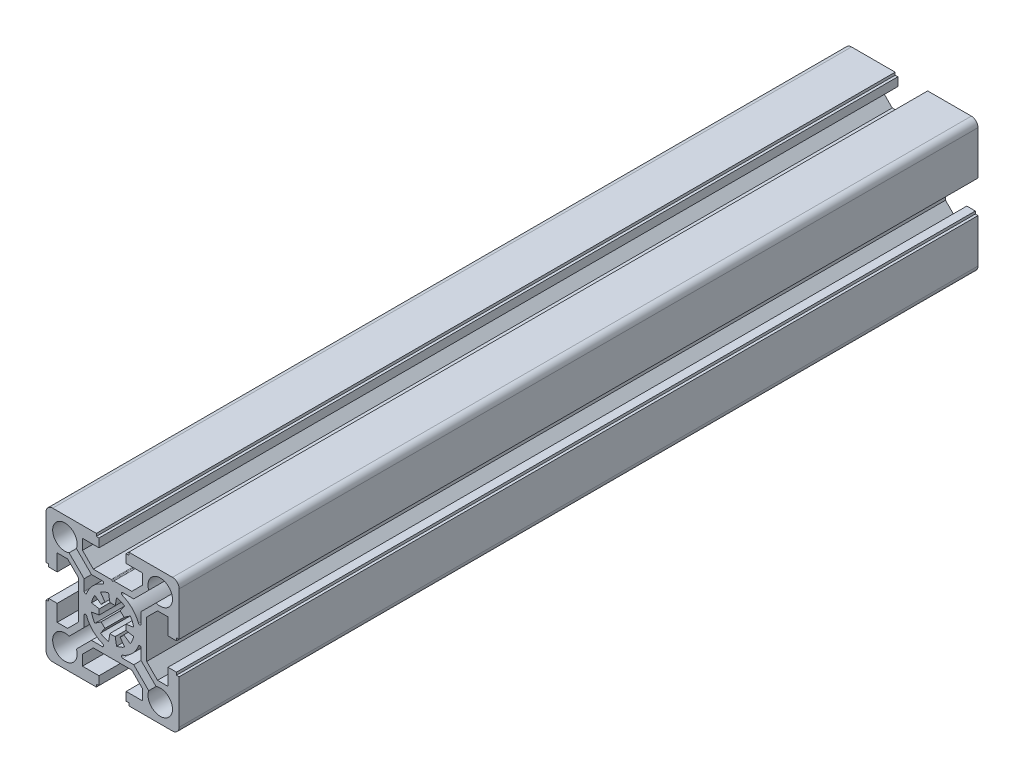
ISO-10303-21;
HEADER;
FILE_DESCRIPTION(('STEP AP214'),'2;1');
FILE_NAME('part.step','',(''),(''),'','','');
FILE_SCHEMA(('AUTOMOTIVE_DESIGN { 1 0 10303 214 1 1 1 1 }'));
ENDSEC;
DATA;
#1=APPLICATION_CONTEXT('core data for automotive mechanical design processes');
#2=APPLICATION_PROTOCOL_DEFINITION('international standard','automotive_design',2000,#1);
#3=PRODUCT_CONTEXT('',#1,'mechanical');
#4=PRODUCT('Part','Part','',(#3));
#5=PRODUCT_RELATED_PRODUCT_CATEGORY('part','',(#4));
#6=PRODUCT_DEFINITION_FORMATION('','',#4);
#7=PRODUCT_DEFINITION_CONTEXT('part definition',#1,'design');
#8=PRODUCT_DEFINITION('design','',#6,#7);
#9=PRODUCT_DEFINITION_SHAPE('','',#8);
#10=(LENGTH_UNIT() NAMED_UNIT(*) SI_UNIT(.MILLI.,.METRE.));
#11=(NAMED_UNIT(*) PLANE_ANGLE_UNIT() SI_UNIT($,.RADIAN.));
#12=(NAMED_UNIT(*) SI_UNIT($,.STERADIAN.) SOLID_ANGLE_UNIT());
#13=UNCERTAINTY_MEASURE_WITH_UNIT(LENGTH_MEASURE(1.E-05),#10,'distance_accuracy_value','');
#14=(GEOMETRIC_REPRESENTATION_CONTEXT(3) GLOBAL_UNCERTAINTY_ASSIGNED_CONTEXT((#13)) GLOBAL_UNIT_ASSIGNED_CONTEXT((#10,
#11,#12)) REPRESENTATION_CONTEXT('',''));
#15=CARTESIAN_POINT('',(0.,0.,0.));
#16=DIRECTION('',(0.,0.,1.));
#17=DIRECTION('',(1.,0.,0.));
#18=AXIS2_PLACEMENT_3D('',#15,#16,#17);
#19=CARTESIAN_POINT('',(4818.72781778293,305.201425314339,300.));
#20=DIRECTION('',(0.,0.,1.));
#21=DIRECTION('',(1.,0.,0.));
#22=AXIS2_PLACEMENT_3D('',#19,#20,#21);
#23=PLANE('',#22);
#24=DIRECTION('',(-0.70710678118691,0.707106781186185,0.));
#25=VECTOR('',#24,1.);
#26=CARTESIAN_POINT('',(4812.56070418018,269.126255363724,300.));
#27=LINE('',#26,#25);
#28=CARTESIAN_POINT('',(4812.56070418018,269.126255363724,300.));
#29=VERTEX_POINT('',#28);
#30=CARTESIAN_POINT('',(4806.92781778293,274.759141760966,300.));
#31=VERTEX_POINT('',#30);
#32=EDGE_CURVE('E911',#29,#31,#27,.T.);
#33=ORIENTED_EDGE('',*,*,#32,.F.);
#34=CARTESIAN_POINT('',(4814.12781778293,264.801425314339,300.));
#35=DIRECTION('',(0.,0.,1.));
#36=DIRECTION('',(1.,0.,0.));
#37=AXIS2_PLACEMENT_3D('',#34,#35,#36);
#38=CIRCLE('',#37,4.60000000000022);
#39=CARTESIAN_POINT('',(4809.80298773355,266.368538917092,300.));
#40=VERTEX_POINT('',#39);
#41=EDGE_CURVE('E909',#40,#29,#38,.T.);
#42=ORIENTED_EDGE('',*,*,#41,.F.);
#43=DIRECTION('',(0.70710678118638,-0.707106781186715,0.));
#44=VECTOR('',#43,1.);
#45=CARTESIAN_POINT('',(4804.1701013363,272.001425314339,300.));
#46=LINE('',#45,#44);
#47=CARTESIAN_POINT('',(4804.1701013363,272.001425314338,300.));
#48=VERTEX_POINT('',#47);
#49=EDGE_CURVE('E925',#48,#40,#46,.T.);
#50=ORIENTED_EDGE('',*,*,#49,.F.);
#51=DIRECTION('',(1.,0.,0.));
#52=VECTOR('',#51,1.);
#53=CARTESIAN_POINT('',(4800.07099355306,272.001425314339,300.));
#54=LINE('',#53,#52);
#55=CARTESIAN_POINT('',(4800.07099355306,272.001425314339,300.));
#56=VERTEX_POINT('',#55);
#57=EDGE_CURVE('E922',#56,#48,#54,.T.);
#58=ORIENTED_EDGE('',*,*,#57,.F.);
#59=CARTESIAN_POINT('',(4800.07099355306,272.501425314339,300.));
#60=DIRECTION('',(0.,0.,1.));
#61=DIRECTION('',(1.,0.,0.));
#62=AXIS2_PLACEMENT_3D('',#59,#60,#61);
#63=CIRCLE('',#62,0.50000000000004);
#64=CARTESIAN_POINT('',(4799.89470108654,272.969315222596,300.));
#65=VERTEX_POINT('',#64);
#66=EDGE_CURVE('E920',#65,#56,#63,.T.);
#67=ORIENTED_EDGE('',*,*,#66,.F.);
#68=CARTESIAN_POINT('',(4796.22781778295,282.701425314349,300.));
#69=DIRECTION('',(0.,0.,-1.));
#70=DIRECTION('',(1.,0.,0.));
#71=AXIS2_PLACEMENT_3D('',#68,#69,#70);
#72=CIRCLE('',#71,10.3999999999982);
#73=CARTESIAN_POINT('',(4805.95992787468,279.034542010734,300.));
#74=VERTEX_POINT('',#73);
#75=EDGE_CURVE('E918',#74,#65,#72,.T.);
#76=ORIENTED_EDGE('',*,*,#75,.F.);
#77=CARTESIAN_POINT('',(4806.42781778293,278.858249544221,300.));
#78=DIRECTION('',(0.,0.,1.));
#79=DIRECTION('',(1.,0.,0.));
#80=AXIS2_PLACEMENT_3D('',#77,#78,#79);
#81=CIRCLE('',#80,0.50000000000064);
#82=CARTESIAN_POINT('',(4806.92781778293,278.858249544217,300.));
#83=VERTEX_POINT('',#82);
#84=EDGE_CURVE('E916',#83,#74,#81,.T.);
#85=ORIENTED_EDGE('',*,*,#84,.F.);
#86=DIRECTION('',(0.,1.,0.));
#87=VECTOR('',#86,1.);
#88=CARTESIAN_POINT('',(4806.92781778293,274.759141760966,300.));
#89=LINE('',#88,#87);
#90=EDGE_CURVE('E914',#31,#83,#89,.T.);
#91=ORIENTED_EDGE('',*,*,#90,.F.);
#92=EDGE_LOOP('',(#33,#42,#50,#58,#67,#76,#85,#91));
#93=FACE_BOUND('',#92,.T.);
#94=DIRECTION('',(-1.,0.,0.));
#95=VECTOR('',#94,1.);
#96=CARTESIAN_POINT('',(4792.38464201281,293.401425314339,300.));
#97=LINE('',#96,#95);
#98=CARTESIAN_POINT('',(4792.38464201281,293.401425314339,300.));
#99=VERTEX_POINT('',#98);
#100=CARTESIAN_POINT('',(4788.28553422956,293.401425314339,300.));
#101=VERTEX_POINT('',#100);
#102=EDGE_CURVE('E1197',#99,#101,#97,.T.);
#103=ORIENTED_EDGE('',*,*,#102,.F.);
#104=CARTESIAN_POINT('',(4792.38464201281,292.901425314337,300.));
#105=DIRECTION('',(0.,0.,1.));
#106=DIRECTION('',(1.,0.,0.));
#107=AXIS2_PLACEMENT_3D('',#104,#105,#106);
#108=CIRCLE('',#107,0.500000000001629);
#109=CARTESIAN_POINT('',(4792.56093447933,292.433535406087,300.));
#110=VERTEX_POINT('',#109);
#111=EDGE_CURVE('E1195',#110,#99,#108,.T.);
#112=ORIENTED_EDGE('',*,*,#111,.F.);
#113=CARTESIAN_POINT('',(4796.22781778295,282.701425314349,300.));
#114=DIRECTION('',(0.,0.,-1.));
#115=DIRECTION('',(1.,0.,0.));
#116=AXIS2_PLACEMENT_3D('',#113,#114,#115);
#117=CIRCLE('',#116,10.4000000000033);
#118=CARTESIAN_POINT('',(4786.4957076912,286.368308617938,300.));
#119=VERTEX_POINT('',#118);
#120=EDGE_CURVE('E1211',#119,#110,#117,.T.);
#121=ORIENTED_EDGE('',*,*,#120,.F.);
#122=CARTESIAN_POINT('',(4786.02781778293,286.544601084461,300.));
#123=DIRECTION('',(0.,0.,1.));
#124=DIRECTION('',(1.,0.,0.));
#125=AXIS2_PLACEMENT_3D('',#122,#123,#124);
#126=CIRCLE('',#125,0.50000000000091);
#127=CARTESIAN_POINT('',(4785.52781778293,286.544601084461,300.));
#128=VERTEX_POINT('',#127);
#129=EDGE_CURVE('E1208',#128,#119,#126,.T.);
#130=ORIENTED_EDGE('',*,*,#129,.F.);
#131=DIRECTION('',(0.,-1.,0.));
#132=VECTOR('',#131,1.);
#133=CARTESIAN_POINT('',(4785.52781778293,290.643708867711,300.));
#134=LINE('',#133,#132);
#135=CARTESIAN_POINT('',(4785.52781778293,290.643708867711,300.));
#136=VERTEX_POINT('',#135);
#137=EDGE_CURVE('E1206',#136,#128,#134,.T.);
#138=ORIENTED_EDGE('',*,*,#137,.F.);
#139=DIRECTION('',(0.707106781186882,-0.707106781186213,0.));
#140=VECTOR('',#139,1.);
#141=CARTESIAN_POINT('',(4779.89493138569,296.276595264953,300.));
#142=LINE('',#141,#140);
#143=CARTESIAN_POINT('',(4779.89493138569,296.276595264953,300.));
#144=VERTEX_POINT('',#143);
#145=EDGE_CURVE('E1204',#144,#136,#142,.T.);
#146=ORIENTED_EDGE('',*,*,#145,.F.);
#147=CARTESIAN_POINT('',(4778.32781778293,300.601425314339,300.));
#148=DIRECTION('',(0.,0.,1.));
#149=DIRECTION('',(1.,0.,0.));
#150=AXIS2_PLACEMENT_3D('',#147,#148,#149);
#151=CIRCLE('',#150,4.59999999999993);
#152=CARTESIAN_POINT('',(4782.65264783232,299.034311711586,300.));
#153=VERTEX_POINT('',#152);
#154=EDGE_CURVE('E1202',#153,#144,#151,.T.);
#155=ORIENTED_EDGE('',*,*,#154,.F.);
#156=DIRECTION('',(-0.707106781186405,0.70710678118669,0.));
#157=VECTOR('',#156,1.);
#158=CARTESIAN_POINT('',(4788.28553422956,293.401425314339,300.));
#159=LINE('',#158,#157);
#160=EDGE_CURVE('E1200',#101,#153,#159,.T.);
#161=ORIENTED_EDGE('',*,*,#160,.F.);
#162=EDGE_LOOP('',(#103,#112,#121,#130,#138,#146,#155,#161));
#163=FACE_BOUND('',#162,.T.);
#164=CARTESIAN_POINT('',(4818.72781778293,305.201425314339,300.));
#165=DIRECTION('',(0.,0.,1.));
#166=DIRECTION('',(1.,0.,0.));
#167=AXIS2_PLACEMENT_3D('',#164,#165,#166);
#168=CIRCLE('',#167,2.49999999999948);
#169=CARTESIAN_POINT('',(4821.22781778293,305.201425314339,300.));
#170=VERTEX_POINT('',#169);
#171=CARTESIAN_POINT('',(4818.72781778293,307.701425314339,300.));
#172=VERTEX_POINT('',#171);
#173=EDGE_CURVE('E1313',#170,#172,#168,.T.);
#174=ORIENTED_EDGE('',*,*,#173,.T.);
#175=DIRECTION('',(-1.,0.,0.));
#176=VECTOR('',#175,1.);
#177=CARTESIAN_POINT('',(4818.72781778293,307.701425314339,300.));
#178=LINE('',#177,#176);
#179=CARTESIAN_POINT('',(4802.32781778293,307.701425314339,300.));
#180=VERTEX_POINT('',#179);
#181=EDGE_CURVE('E1316',#172,#180,#178,.T.);
#182=ORIENTED_EDGE('',*,*,#181,.T.);
#183=DIRECTION('',(0.,-1.,0.));
#184=VECTOR('',#183,1.);
#185=CARTESIAN_POINT('',(4802.32781778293,307.701425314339,300.));
#186=LINE('',#185,#184);
#187=CARTESIAN_POINT('',(4802.32781778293,306.701425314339,300.));
#188=VERTEX_POINT('',#187);
#189=EDGE_CURVE('E1319',#180,#188,#186,.T.);
#190=ORIENTED_EDGE('',*,*,#189,.T.);
#191=DIRECTION('',(-1.,0.,0.));
#192=VECTOR('',#191,1.);
#193=CARTESIAN_POINT('',(4802.32781778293,306.701425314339,300.));
#194=LINE('',#193,#192);
#195=CARTESIAN_POINT('',(4801.32781778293,306.701425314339,300.));
#196=VERTEX_POINT('',#195);
#197=EDGE_CURVE('E1321',#188,#196,#194,.T.);
#198=ORIENTED_EDGE('',*,*,#197,.T.);
#199=DIRECTION('',(0.,-1.,0.));
#200=VECTOR('',#199,1.);
#201=CARTESIAN_POINT('',(4801.32781778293,306.701425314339,300.));
#202=LINE('',#201,#200);
#203=CARTESIAN_POINT('',(4801.32781778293,303.501425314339,300.));
#204=VERTEX_POINT('',#203);
#205=EDGE_CURVE('E1323',#196,#204,#202,.T.);
#206=ORIENTED_EDGE('',*,*,#205,.T.);
#207=DIRECTION('',(1.,0.,0.));
#208=VECTOR('',#207,1.);
#209=CARTESIAN_POINT('',(4801.32781778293,303.501425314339,300.));
#210=LINE('',#209,#208);
#211=CARTESIAN_POINT('',(4807.52781778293,303.501425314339,300.));
#212=VERTEX_POINT('',#211);
#213=EDGE_CURVE('E1325',#204,#212,#210,.T.);
#214=ORIENTED_EDGE('',*,*,#213,.T.);
#215=DIRECTION('',(0.,-1.,0.));
#216=VECTOR('',#215,1.);
#217=CARTESIAN_POINT('',(4807.52781778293,303.501425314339,300.));
#218=LINE('',#217,#216);
#219=CARTESIAN_POINT('',(4807.52781778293,299.587568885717,300.));
#220=VERTEX_POINT('',#219);
#221=EDGE_CURVE('E1327',#212,#220,#218,.T.);
#222=ORIENTED_EDGE('',*,*,#221,.T.);
#223=DIRECTION('',(-0.70710678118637,-0.707106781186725,0.));
#224=VECTOR('',#223,1.);
#225=CARTESIAN_POINT('',(4807.52781778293,299.587568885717,300.));
#226=LINE('',#225,#224);
#227=CARTESIAN_POINT('',(4803.44167421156,295.501425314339,300.));
#228=VERTEX_POINT('',#227);
#229=EDGE_CURVE('E1329',#220,#228,#226,.T.);
#230=ORIENTED_EDGE('',*,*,#229,.T.);
#231=DIRECTION('',(-1.,0.,0.));
#232=VECTOR('',#231,1.);
#233=CARTESIAN_POINT('',(4803.44167421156,295.501425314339,300.));
#234=LINE('',#233,#232);
#235=CARTESIAN_POINT('',(4796.7474330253,295.501425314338,300.));
#236=VERTEX_POINT('',#235);
#237=EDGE_CURVE('E1331',#228,#236,#234,.T.);
#238=ORIENTED_EDGE('',*,*,#237,.T.);
#239=CARTESIAN_POINT('',(4796.74743302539,295.201425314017,300.));
#240=DIRECTION('',(0.,0.,1.));
#241=DIRECTION('',(1.,0.,0.));
#242=AXIS2_PLACEMENT_3D('',#239,#240,#241);
#243=CIRCLE('',#242,0.300000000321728);
#244=CARTESIAN_POINT('',(4796.48762540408,295.35142531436,300.));
#245=VERTEX_POINT('',#244);
#246=EDGE_CURVE('E1333',#236,#245,#243,.T.);
#247=ORIENTED_EDGE('',*,*,#246,.T.);
#248=CARTESIAN_POINT('',(4796.22781778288,295.501425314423,300.));
#249=DIRECTION('',(0.,0.,-1.));
#250=DIRECTION('',(1.,0.,0.));
#251=AXIS2_PLACEMENT_3D('',#248,#249,#250);
#252=CIRCLE('',#251,0.300000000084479);
#253=CARTESIAN_POINT('',(4795.96801016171,295.351425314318,300.));
#254=VERTEX_POINT('',#253);
#255=EDGE_CURVE('E1335',#245,#254,#252,.T.);
#256=ORIENTED_EDGE('',*,*,#255,.T.);
#257=CARTESIAN_POINT('',(4795.70820254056,295.201425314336,300.));
#258=DIRECTION('',(0.,0.,1.));
#259=DIRECTION('',(1.,0.,0.));
#260=AXIS2_PLACEMENT_3D('',#257,#258,#259);
#261=CIRCLE('',#260,0.300000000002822);
#262=CARTESIAN_POINT('',(4795.70820254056,295.501425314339,300.));
#263=VERTEX_POINT('',#262);
#264=EDGE_CURVE('E1337',#254,#263,#261,.T.);
#265=ORIENTED_EDGE('',*,*,#264,.T.);
#266=DIRECTION('',(-1.,0.,0.));
#267=VECTOR('',#266,1.);
#268=CARTESIAN_POINT('',(4795.70820254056,295.501425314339,300.));
#269=LINE('',#268,#267);
#270=CARTESIAN_POINT('',(4789.01396135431,295.501425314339,300.));
#271=VERTEX_POINT('',#270);
#272=EDGE_CURVE('E1339',#263,#271,#269,.T.);
#273=ORIENTED_EDGE('',*,*,#272,.T.);
#274=DIRECTION('',(-0.70710678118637,0.707106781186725,0.));
#275=VECTOR('',#274,1.);
#276=CARTESIAN_POINT('',(4789.01396135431,295.501425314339,300.));
#277=LINE('',#276,#275);
#278=CARTESIAN_POINT('',(4784.92781778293,299.587568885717,300.));
#279=VERTEX_POINT('',#278);
#280=EDGE_CURVE('E1341',#271,#279,#277,.T.);
#281=ORIENTED_EDGE('',*,*,#280,.T.);
#282=DIRECTION('',(0.,1.,0.));
#283=VECTOR('',#282,1.);
#284=CARTESIAN_POINT('',(4784.92781778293,299.587568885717,300.));
#285=LINE('',#284,#283);
#286=CARTESIAN_POINT('',(4784.92781778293,303.501425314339,300.));
#287=VERTEX_POINT('',#286);
#288=EDGE_CURVE('E1343',#279,#287,#285,.T.);
#289=ORIENTED_EDGE('',*,*,#288,.T.);
#290=DIRECTION('',(1.,0.,0.));
#291=VECTOR('',#290,1.);
#292=CARTESIAN_POINT('',(4784.92781778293,303.501425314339,300.));
#293=LINE('',#292,#291);
#294=CARTESIAN_POINT('',(4791.12781778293,303.501425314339,300.));
#295=VERTEX_POINT('',#294);
#296=EDGE_CURVE('E1345',#287,#295,#293,.T.);
#297=ORIENTED_EDGE('',*,*,#296,.T.);
#298=DIRECTION('',(0.,1.,0.));
#299=VECTOR('',#298,1.);
#300=CARTESIAN_POINT('',(4791.12781778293,303.501425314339,300.));
#301=LINE('',#300,#299);
#302=CARTESIAN_POINT('',(4791.12781778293,306.701425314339,300.));
#303=VERTEX_POINT('',#302);
#304=EDGE_CURVE('E1347',#295,#303,#301,.T.);
#305=ORIENTED_EDGE('',*,*,#304,.T.);
#306=DIRECTION('',(-1.,0.,0.));
#307=VECTOR('',#306,1.);
#308=CARTESIAN_POINT('',(4791.12781778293,306.701425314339,300.));
#309=LINE('',#308,#307);
#310=CARTESIAN_POINT('',(4790.12781778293,306.701425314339,300.));
#311=VERTEX_POINT('',#310);
#312=EDGE_CURVE('E1349',#303,#311,#309,.T.);
#313=ORIENTED_EDGE('',*,*,#312,.T.);
#314=DIRECTION('',(0.,1.,0.));
#315=VECTOR('',#314,1.);
#316=CARTESIAN_POINT('',(4790.12781778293,306.701425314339,300.));
#317=LINE('',#316,#315);
#318=CARTESIAN_POINT('',(4790.12781778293,307.701425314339,300.));
#319=VERTEX_POINT('',#318);
#320=EDGE_CURVE('E1351',#311,#319,#317,.T.);
#321=ORIENTED_EDGE('',*,*,#320,.T.);
#322=DIRECTION('',(-1.,0.,0.));
#323=VECTOR('',#322,1.);
#324=CARTESIAN_POINT('',(4790.12781778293,307.701425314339,300.));
#325=LINE('',#324,#323);
#326=CARTESIAN_POINT('',(4773.72781778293,307.701425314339,300.));
#327=VERTEX_POINT('',#326);
#328=EDGE_CURVE('E1353',#319,#327,#325,.T.);
#329=ORIENTED_EDGE('',*,*,#328,.T.);
#330=CARTESIAN_POINT('',(4773.72781778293,305.201425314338,300.));
#331=DIRECTION('',(0.,0.,1.));
#332=DIRECTION('',(1.,0.,0.));
#333=AXIS2_PLACEMENT_3D('',#330,#331,#332);
#334=CIRCLE('',#333,2.50000000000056);
#335=CARTESIAN_POINT('',(4771.22781778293,305.201425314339,300.));
#336=VERTEX_POINT('',#335);
#337=EDGE_CURVE('E1355',#327,#336,#334,.T.);
#338=ORIENTED_EDGE('',*,*,#337,.T.);
#339=DIRECTION('',(0.,-1.,0.));
#340=VECTOR('',#339,1.);
#341=CARTESIAN_POINT('',(4771.22781778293,305.201425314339,300.));
#342=LINE('',#341,#340);
#343=CARTESIAN_POINT('',(4771.22781778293,288.801425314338,300.));
#344=VERTEX_POINT('',#343);
#345=EDGE_CURVE('E1357',#336,#344,#342,.T.);
#346=ORIENTED_EDGE('',*,*,#345,.T.);
#347=DIRECTION('',(1.,0.,0.));
#348=VECTOR('',#347,1.);
#349=CARTESIAN_POINT('',(4771.22781778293,288.801425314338,300.));
#350=LINE('',#349,#348);
#351=CARTESIAN_POINT('',(4772.22781778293,288.801425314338,300.));
#352=VERTEX_POINT('',#351);
#353=EDGE_CURVE('E1359',#344,#352,#350,.T.);
#354=ORIENTED_EDGE('',*,*,#353,.T.);
#355=DIRECTION('',(0.,-1.,0.));
#356=VECTOR('',#355,1.);
#357=CARTESIAN_POINT('',(4772.22781778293,288.801425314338,300.));
#358=LINE('',#357,#356);
#359=CARTESIAN_POINT('',(4772.22781778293,287.801425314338,300.));
#360=VERTEX_POINT('',#359);
#361=EDGE_CURVE('E1361',#352,#360,#358,.T.);
#362=ORIENTED_EDGE('',*,*,#361,.T.);
#363=DIRECTION('',(1.,0.,0.));
#364=VECTOR('',#363,1.);
#365=CARTESIAN_POINT('',(4772.22781778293,287.801425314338,300.));
#366=LINE('',#365,#364);
#367=CARTESIAN_POINT('',(4775.42781778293,287.801425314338,300.));
#368=VERTEX_POINT('',#367);
#369=EDGE_CURVE('E1363',#360,#368,#366,.T.);
#370=ORIENTED_EDGE('',*,*,#369,.T.);
#371=DIRECTION('',(0.,1.,0.));
#372=VECTOR('',#371,1.);
#373=CARTESIAN_POINT('',(4775.42781778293,287.801425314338,300.));
#374=LINE('',#373,#372);
#375=CARTESIAN_POINT('',(4775.42781778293,294.001425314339,300.));
#376=VERTEX_POINT('',#375);
#377=EDGE_CURVE('E1365',#368,#376,#374,.T.);
#378=ORIENTED_EDGE('',*,*,#377,.T.);
#379=DIRECTION('',(1.,-4.6804680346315E-13,0.));
#380=VECTOR('',#379,1.);
#381=CARTESIAN_POINT('',(4775.42781778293,294.001425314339,300.));
#382=LINE('',#381,#380);
#383=CARTESIAN_POINT('',(4779.34167421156,294.001425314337,300.));
#384=VERTEX_POINT('',#383);
#385=EDGE_CURVE('E1367',#376,#384,#382,.T.);
#386=ORIENTED_EDGE('',*,*,#385,.T.);
#387=DIRECTION('',(0.707106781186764,-0.707106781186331,0.));
#388=VECTOR('',#387,1.);
#389=CARTESIAN_POINT('',(4779.34167421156,294.001425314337,300.));
#390=LINE('',#389,#388);
#391=CARTESIAN_POINT('',(4783.42781778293,289.915281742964,300.));
#392=VERTEX_POINT('',#391);
#393=EDGE_CURVE('E1369',#384,#392,#390,.T.);
#394=ORIENTED_EDGE('',*,*,#393,.T.);
#395=DIRECTION('',(0.,-1.,0.));
#396=VECTOR('',#395,1.);
#397=CARTESIAN_POINT('',(4783.42781778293,289.915281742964,300.));
#398=LINE('',#397,#396);
#399=CARTESIAN_POINT('',(4783.42781778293,275.487568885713,300.));
#400=VERTEX_POINT('',#399);
#401=EDGE_CURVE('E1371',#392,#400,#398,.T.);
#402=ORIENTED_EDGE('',*,*,#401,.T.);
#403=DIRECTION('',(-0.707106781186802,-0.707106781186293,0.));
#404=VECTOR('',#403,1.);
#405=CARTESIAN_POINT('',(4783.42781778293,275.487568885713,300.));
#406=LINE('',#405,#404);
#407=CARTESIAN_POINT('',(4779.34167421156,271.40142531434,300.));
#408=VERTEX_POINT('',#407);
#409=EDGE_CURVE('E1373',#400,#408,#406,.T.);
#410=ORIENTED_EDGE('',*,*,#409,.T.);
#411=DIRECTION('',(-1.,-2.26931783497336E-13,0.));
#412=VECTOR('',#411,1.);
#413=CARTESIAN_POINT('',(4779.34167421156,271.40142531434,300.));
#414=LINE('',#413,#412);
#415=CARTESIAN_POINT('',(4775.42781778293,271.401425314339,300.));
#416=VERTEX_POINT('',#415);
#417=EDGE_CURVE('E1375',#408,#416,#414,.T.);
#418=ORIENTED_EDGE('',*,*,#417,.T.);
#419=DIRECTION('',(0.,1.,0.));
#420=VECTOR('',#419,1.);
#421=CARTESIAN_POINT('',(4775.42781778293,271.401425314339,300.));
#422=LINE('',#421,#420);
#423=CARTESIAN_POINT('',(4775.42781778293,277.601425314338,300.));
#424=VERTEX_POINT('',#423);
#425=EDGE_CURVE('E1377',#416,#424,#422,.T.);
#426=ORIENTED_EDGE('',*,*,#425,.T.);
#427=DIRECTION('',(-1.,0.,0.));
#428=VECTOR('',#427,1.);
#429=CARTESIAN_POINT('',(4775.42781778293,277.601425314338,300.));
#430=LINE('',#429,#428);
#431=CARTESIAN_POINT('',(4772.22781778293,277.601425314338,300.));
#432=VERTEX_POINT('',#431);
#433=EDGE_CURVE('E1379',#424,#432,#430,.T.);
#434=ORIENTED_EDGE('',*,*,#433,.T.);
#435=DIRECTION('',(0.,-1.,0.));
#436=VECTOR('',#435,1.);
#437=CARTESIAN_POINT('',(4772.22781778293,277.601425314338,300.));
#438=LINE('',#437,#436);
#439=CARTESIAN_POINT('',(4772.22781778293,276.601425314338,300.));
#440=VERTEX_POINT('',#439);
#441=EDGE_CURVE('E1381',#432,#440,#438,.T.);
#442=ORIENTED_EDGE('',*,*,#441,.T.);
#443=DIRECTION('',(-1.,0.,0.));
#444=VECTOR('',#443,1.);
#445=CARTESIAN_POINT('',(4772.22781778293,276.601425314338,300.));
#446=LINE('',#445,#444);
#447=CARTESIAN_POINT('',(4771.22781778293,276.601425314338,300.));
#448=VERTEX_POINT('',#447);
#449=EDGE_CURVE('E1383',#440,#448,#446,.T.);
#450=ORIENTED_EDGE('',*,*,#449,.T.);
#451=DIRECTION('',(0.,-1.,0.));
#452=VECTOR('',#451,1.);
#453=CARTESIAN_POINT('',(4771.22781778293,276.601425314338,300.));
#454=LINE('',#453,#452);
#455=CARTESIAN_POINT('',(4771.22781778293,260.201425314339,300.));
#456=VERTEX_POINT('',#455);
#457=EDGE_CURVE('E1385',#448,#456,#454,.T.);
#458=ORIENTED_EDGE('',*,*,#457,.T.);
#459=CARTESIAN_POINT('',(4773.72781778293,260.201425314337,300.));
#460=DIRECTION('',(0.,0.,1.));
#461=DIRECTION('',(1.,0.,0.));
#462=AXIS2_PLACEMENT_3D('',#459,#460,#461);
#463=CIRCLE('',#462,2.49999999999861);
#464=CARTESIAN_POINT('',(4773.72781778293,257.701425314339,300.));
#465=VERTEX_POINT('',#464);
#466=EDGE_CURVE('E1387',#456,#465,#463,.T.);
#467=ORIENTED_EDGE('',*,*,#466,.T.);
#468=DIRECTION('',(1.,0.,0.));
#469=VECTOR('',#468,1.);
#470=CARTESIAN_POINT('',(4773.72781778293,257.701425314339,300.));
#471=LINE('',#470,#469);
#472=CARTESIAN_POINT('',(4790.12781778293,257.701425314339,300.));
#473=VERTEX_POINT('',#472);
#474=EDGE_CURVE('E1389',#465,#473,#471,.T.);
#475=ORIENTED_EDGE('',*,*,#474,.T.);
#476=DIRECTION('',(0.,1.,0.));
#477=VECTOR('',#476,1.);
#478=CARTESIAN_POINT('',(4790.12781778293,257.701425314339,300.));
#479=LINE('',#478,#477);
#480=CARTESIAN_POINT('',(4790.12781778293,258.701425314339,300.));
#481=VERTEX_POINT('',#480);
#482=EDGE_CURVE('E1391',#473,#481,#479,.T.);
#483=ORIENTED_EDGE('',*,*,#482,.T.);
#484=DIRECTION('',(1.,0.,0.));
#485=VECTOR('',#484,1.);
#486=CARTESIAN_POINT('',(4790.12781778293,258.701425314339,300.));
#487=LINE('',#486,#485);
#488=CARTESIAN_POINT('',(4791.12781778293,258.701425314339,300.));
#489=VERTEX_POINT('',#488);
#490=EDGE_CURVE('E1393',#481,#489,#487,.T.);
#491=ORIENTED_EDGE('',*,*,#490,.T.);
#492=DIRECTION('',(0.,1.,0.));
#493=VECTOR('',#492,1.);
#494=CARTESIAN_POINT('',(4791.12781778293,258.701425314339,300.));
#495=LINE('',#494,#493);
#496=CARTESIAN_POINT('',(4791.12781778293,261.90142531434,300.));
#497=VERTEX_POINT('',#496);
#498=EDGE_CURVE('E1395',#489,#497,#495,.T.);
#499=ORIENTED_EDGE('',*,*,#498,.T.);
#500=DIRECTION('',(-1.,0.,0.));
#501=VECTOR('',#500,1.);
#502=CARTESIAN_POINT('',(4791.12781778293,261.90142531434,300.));
#503=LINE('',#502,#501);
#504=CARTESIAN_POINT('',(4784.92781778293,261.90142531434,300.));
#505=VERTEX_POINT('',#504);
#506=EDGE_CURVE('E1397',#497,#505,#503,.T.);
#507=ORIENTED_EDGE('',*,*,#506,.T.);
#508=DIRECTION('',(0.,1.,0.));
#509=VECTOR('',#508,1.);
#510=CARTESIAN_POINT('',(4784.92781778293,261.90142531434,300.));
#511=LINE('',#510,#509);
#512=CARTESIAN_POINT('',(4784.92781778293,265.815281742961,300.));
#513=VERTEX_POINT('',#512);
#514=EDGE_CURVE('E1399',#505,#513,#511,.T.);
#515=ORIENTED_EDGE('',*,*,#514,.T.);
#516=DIRECTION('',(0.707106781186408,0.707106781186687,0.));
#517=VECTOR('',#516,1.);
#518=CARTESIAN_POINT('',(4784.92781778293,265.815281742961,300.));
#519=LINE('',#518,#517);
#520=CARTESIAN_POINT('',(4789.01396135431,269.901425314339,300.));
#521=VERTEX_POINT('',#520);
#522=EDGE_CURVE('E1401',#513,#521,#519,.T.);
#523=ORIENTED_EDGE('',*,*,#522,.T.);
#524=DIRECTION('',(1.,0.,0.));
#525=VECTOR('',#524,1.);
#526=CARTESIAN_POINT('',(4789.01396135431,269.901425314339,300.));
#527=LINE('',#526,#525);
#528=CARTESIAN_POINT('',(4803.44167421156,269.901425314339,300.));
#529=VERTEX_POINT('',#528);
#530=EDGE_CURVE('E1403',#521,#529,#527,.T.);
#531=ORIENTED_EDGE('',*,*,#530,.T.);
#532=DIRECTION('',(0.707106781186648,-0.707106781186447,0.));
#533=VECTOR('',#532,1.);
#534=CARTESIAN_POINT('',(4803.44167421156,269.901425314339,300.));
#535=LINE('',#534,#533);
#536=CARTESIAN_POINT('',(4807.52781778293,265.815281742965,300.));
#537=VERTEX_POINT('',#536);
#538=EDGE_CURVE('E1405',#529,#537,#535,.T.);
#539=ORIENTED_EDGE('',*,*,#538,.T.);
#540=DIRECTION('',(0.,-1.,0.));
#541=VECTOR('',#540,1.);
#542=CARTESIAN_POINT('',(4807.52781778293,265.815281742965,300.));
#543=LINE('',#542,#541);
#544=CARTESIAN_POINT('',(4807.52781778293,261.901425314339,300.));
#545=VERTEX_POINT('',#544);
#546=EDGE_CURVE('E1407',#537,#545,#543,.T.);
#547=ORIENTED_EDGE('',*,*,#546,.T.);
#548=DIRECTION('',(-1.,1.43254583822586E-13,0.));
#549=VECTOR('',#548,1.);
#550=CARTESIAN_POINT('',(4807.52781778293,261.901425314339,300.));
#551=LINE('',#550,#549);
#552=CARTESIAN_POINT('',(4801.32781778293,261.90142531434,300.));
#553=VERTEX_POINT('',#552);
#554=EDGE_CURVE('E1409',#545,#553,#551,.T.);
#555=ORIENTED_EDGE('',*,*,#554,.T.);
#556=DIRECTION('',(0.,-1.,0.));
#557=VECTOR('',#556,1.);
#558=CARTESIAN_POINT('',(4801.32781778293,261.90142531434,300.));
#559=LINE('',#558,#557);
#560=CARTESIAN_POINT('',(4801.32781778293,258.701425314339,300.));
#561=VERTEX_POINT('',#560);
#562=EDGE_CURVE('E1411',#553,#561,#559,.T.);
#563=ORIENTED_EDGE('',*,*,#562,.T.);
#564=DIRECTION('',(1.,0.,0.));
#565=VECTOR('',#564,1.);
#566=CARTESIAN_POINT('',(4801.32781778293,258.701425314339,300.));
#567=LINE('',#566,#565);
#568=CARTESIAN_POINT('',(4802.32781778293,258.701425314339,300.));
#569=VERTEX_POINT('',#568);
#570=EDGE_CURVE('E1413',#561,#569,#567,.T.);
#571=ORIENTED_EDGE('',*,*,#570,.T.);
#572=DIRECTION('',(0.,-1.,0.));
#573=VECTOR('',#572,1.);
#574=CARTESIAN_POINT('',(4802.32781778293,258.701425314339,300.));
#575=LINE('',#574,#573);
#576=CARTESIAN_POINT('',(4802.32781778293,257.701425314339,300.));
#577=VERTEX_POINT('',#576);
#578=EDGE_CURVE('E1415',#569,#577,#575,.T.);
#579=ORIENTED_EDGE('',*,*,#578,.T.);
#580=DIRECTION('',(1.,0.,0.));
#581=VECTOR('',#580,1.);
#582=CARTESIAN_POINT('',(4802.32781778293,257.701425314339,300.));
#583=LINE('',#582,#581);
#584=CARTESIAN_POINT('',(4818.72781778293,257.701425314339,300.));
#585=VERTEX_POINT('',#584);
#586=EDGE_CURVE('E1417',#577,#585,#583,.T.);
#587=ORIENTED_EDGE('',*,*,#586,.T.);
#588=CARTESIAN_POINT('',(4818.72781778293,260.201425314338,300.));
#589=DIRECTION('',(0.,0.,1.));
#590=DIRECTION('',(1.,0.,0.));
#591=AXIS2_PLACEMENT_3D('',#588,#589,#590);
#592=CIRCLE('',#591,2.49999999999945);
#593=CARTESIAN_POINT('',(4821.22781778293,260.201425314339,300.));
#594=VERTEX_POINT('',#593);
#595=EDGE_CURVE('E1419',#585,#594,#592,.T.);
#596=ORIENTED_EDGE('',*,*,#595,.T.);
#597=DIRECTION('',(0.,1.,0.));
#598=VECTOR('',#597,1.);
#599=CARTESIAN_POINT('',(4821.22781778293,260.201425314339,300.));
#600=LINE('',#599,#598);
#601=CARTESIAN_POINT('',(4821.22781778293,276.601425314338,300.));
#602=VERTEX_POINT('',#601);
#603=EDGE_CURVE('E1421',#594,#602,#600,.T.);
#604=ORIENTED_EDGE('',*,*,#603,.T.);
#605=DIRECTION('',(-1.,0.,0.));
#606=VECTOR('',#605,1.);
#607=CARTESIAN_POINT('',(4821.22781778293,276.601425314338,300.));
#608=LINE('',#607,#606);
#609=CARTESIAN_POINT('',(4820.22781778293,276.601425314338,300.));
#610=VERTEX_POINT('',#609);
#611=EDGE_CURVE('E1423',#602,#610,#608,.T.);
#612=ORIENTED_EDGE('',*,*,#611,.T.);
#613=DIRECTION('',(0.,1.,0.));
#614=VECTOR('',#613,1.);
#615=CARTESIAN_POINT('',(4820.22781778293,276.601425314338,300.));
#616=LINE('',#615,#614);
#617=CARTESIAN_POINT('',(4820.22781778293,277.601425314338,300.));
#618=VERTEX_POINT('',#617);
#619=EDGE_CURVE('E1425',#610,#618,#616,.T.);
#620=ORIENTED_EDGE('',*,*,#619,.T.);
#621=DIRECTION('',(-1.,0.,0.));
#622=VECTOR('',#621,1.);
#623=CARTESIAN_POINT('',(4820.22781778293,277.601425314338,300.));
#624=LINE('',#623,#622);
#625=CARTESIAN_POINT('',(4817.02781778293,277.601425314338,300.));
#626=VERTEX_POINT('',#625);
#627=EDGE_CURVE('E1427',#618,#626,#624,.T.);
#628=ORIENTED_EDGE('',*,*,#627,.T.);
#629=DIRECTION('',(0.,-1.,0.));
#630=VECTOR('',#629,1.);
#631=CARTESIAN_POINT('',(4817.02781778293,277.601425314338,300.));
#632=LINE('',#631,#630);
#633=CARTESIAN_POINT('',(4817.02781778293,271.401425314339,300.));
#634=VERTEX_POINT('',#633);
#635=EDGE_CURVE('E1429',#626,#634,#632,.T.);
#636=ORIENTED_EDGE('',*,*,#635,.T.);
#637=DIRECTION('',(-1.,2.2693178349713E-13,0.));
#638=VECTOR('',#637,1.);
#639=CARTESIAN_POINT('',(4817.02781778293,271.401425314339,300.));
#640=LINE('',#639,#638);
#641=CARTESIAN_POINT('',(4813.11396135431,271.40142531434,300.));
#642=VERTEX_POINT('',#641);
#643=EDGE_CURVE('E1431',#634,#642,#640,.T.);
#644=ORIENTED_EDGE('',*,*,#643,.T.);
#645=DIRECTION('',(-0.707106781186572,0.707106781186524,0.));
#646=VECTOR('',#645,1.);
#647=CARTESIAN_POINT('',(4813.11396135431,271.40142531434,300.));
#648=LINE('',#647,#646);
#649=CARTESIAN_POINT('',(4809.02781778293,275.487568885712,300.));
#650=VERTEX_POINT('',#649);
#651=EDGE_CURVE('E1433',#642,#650,#648,.T.);
#652=ORIENTED_EDGE('',*,*,#651,.T.);
#653=DIRECTION('',(0.,1.,0.));
#654=VECTOR('',#653,1.);
#655=CARTESIAN_POINT('',(4809.02781778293,275.487568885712,300.));
#656=LINE('',#655,#654);
#657=CARTESIAN_POINT('',(4809.02781778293,289.915281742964,300.));
#658=VERTEX_POINT('',#657);
#659=EDGE_CURVE('E1435',#650,#658,#656,.T.);
#660=ORIENTED_EDGE('',*,*,#659,.T.);
#661=DIRECTION('',(0.707106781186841,0.707106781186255,0.));
#662=VECTOR('',#661,1.);
#663=CARTESIAN_POINT('',(4809.02781778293,289.915281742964,300.));
#664=LINE('',#663,#662);
#665=CARTESIAN_POINT('',(4813.11396135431,294.001425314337,300.));
#666=VERTEX_POINT('',#665);
#667=EDGE_CURVE('E1437',#658,#666,#664,.T.);
#668=ORIENTED_EDGE('',*,*,#667,.T.);
#669=DIRECTION('',(1.,4.68046803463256E-13,0.));
#670=VECTOR('',#669,1.);
#671=CARTESIAN_POINT('',(4813.11396135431,294.001425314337,300.));
#672=LINE('',#671,#670);
#673=CARTESIAN_POINT('',(4817.02781778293,294.001425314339,300.));
#674=VERTEX_POINT('',#673);
#675=EDGE_CURVE('E1439',#666,#674,#672,.T.);
#676=ORIENTED_EDGE('',*,*,#675,.T.);
#677=DIRECTION('',(0.,-1.,0.));
#678=VECTOR('',#677,1.);
#679=CARTESIAN_POINT('',(4817.02781778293,294.001425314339,300.));
#680=LINE('',#679,#678);
#681=CARTESIAN_POINT('',(4817.02781778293,287.801425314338,300.));
#682=VERTEX_POINT('',#681);
#683=EDGE_CURVE('E1441',#674,#682,#680,.T.);
#684=ORIENTED_EDGE('',*,*,#683,.T.);
#685=DIRECTION('',(1.,0.,0.));
#686=VECTOR('',#685,1.);
#687=CARTESIAN_POINT('',(4817.02781778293,287.801425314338,300.));
#688=LINE('',#687,#686);
#689=CARTESIAN_POINT('',(4820.22781778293,287.801425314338,300.));
#690=VERTEX_POINT('',#689);
#691=EDGE_CURVE('E1443',#682,#690,#688,.T.);
#692=ORIENTED_EDGE('',*,*,#691,.T.);
#693=DIRECTION('',(0.,1.,0.));
#694=VECTOR('',#693,1.);
#695=CARTESIAN_POINT('',(4820.22781778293,287.801425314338,300.));
#696=LINE('',#695,#694);
#697=CARTESIAN_POINT('',(4820.22781778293,288.801425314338,300.));
#698=VERTEX_POINT('',#697);
#699=EDGE_CURVE('E1445',#690,#698,#696,.T.);
#700=ORIENTED_EDGE('',*,*,#699,.T.);
#701=DIRECTION('',(1.,0.,0.));
#702=VECTOR('',#701,1.);
#703=CARTESIAN_POINT('',(4820.22781778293,288.801425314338,300.));
#704=LINE('',#703,#702);
#705=CARTESIAN_POINT('',(4821.22781778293,288.801425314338,300.));
#706=VERTEX_POINT('',#705);
#707=EDGE_CURVE('E1447',#698,#706,#704,.T.);
#708=ORIENTED_EDGE('',*,*,#707,.T.);
#709=DIRECTION('',(0.,1.,0.));
#710=VECTOR('',#709,1.);
#711=CARTESIAN_POINT('',(4821.22781778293,288.801425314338,300.));
#712=LINE('',#711,#710);
#713=EDGE_CURVE('E1449',#706,#170,#712,.T.);
#714=ORIENTED_EDGE('',*,*,#713,.T.);
#715=EDGE_LOOP('',(#174,#182,#190,#198,#206,#214,#222,#230,#238,#247,#256,#265,#273,#281,#289,
#297,#305,#313,#321,#329,#338,#346,#354,#362,#370,#378,#386,#394,#402,#410,#418,#426,#434,#442,
#450,#458,#467,#475,#483,#491,#499,#507,#515,#523,#531,#539,#547,#555,#563,#571,#579,#587,#596,
#604,#612,#620,#628,#636,#644,#652,#660,#668,#676,#684,#692,#700,#708,#714));
#716=FACE_BOUND('',#715,.T.);
#717=CARTESIAN_POINT('',(4796.22781778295,282.701425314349,300.));
#718=DIRECTION('',(0.,0.,-1.));
#719=DIRECTION('',(1.,0.,0.));
#720=AXIS2_PLACEMENT_3D('',#717,#718,#719);
#721=CIRCLE('',#720,10.4000000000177);
#722=CARTESIAN_POINT('',(4792.56093447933,272.969315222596,300.));
#723=VERTEX_POINT('',#722);
#724=CARTESIAN_POINT('',(4786.49570769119,279.034542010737,300.));
#725=VERTEX_POINT('',#724);
#726=EDGE_CURVE('E1256',#723,#725,#721,.T.);
#727=ORIENTED_EDGE('',*,*,#726,.F.);
#728=CARTESIAN_POINT('',(4792.38464201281,272.501425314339,300.));
#729=DIRECTION('',(0.,0.,1.));
#730=DIRECTION('',(1.,0.,0.));
#731=AXIS2_PLACEMENT_3D('',#728,#729,#730);
#732=CIRCLE('',#731,0.499999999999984);
#733=CARTESIAN_POINT('',(4792.38464201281,272.001425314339,300.));
#734=VERTEX_POINT('',#733);
#735=EDGE_CURVE('E1254',#734,#723,#732,.T.);
#736=ORIENTED_EDGE('',*,*,#735,.F.);
#737=DIRECTION('',(1.,0.,0.));
#738=VECTOR('',#737,1.);
#739=CARTESIAN_POINT('',(4788.28553422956,272.001425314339,300.));
#740=LINE('',#739,#738);
#741=CARTESIAN_POINT('',(4788.28553422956,272.001425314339,300.));
#742=VERTEX_POINT('',#741);
#743=EDGE_CURVE('E1270',#742,#734,#740,.T.);
#744=ORIENTED_EDGE('',*,*,#743,.F.);
#745=DIRECTION('',(0.70710678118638,0.707106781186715,0.));
#746=VECTOR('',#745,1.);
#747=CARTESIAN_POINT('',(4782.65264783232,266.368538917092,300.));
#748=LINE('',#747,#746);
#749=CARTESIAN_POINT('',(4782.65264783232,266.368538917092,300.));
#750=VERTEX_POINT('',#749);
#751=EDGE_CURVE('E1267',#750,#742,#748,.T.);
#752=ORIENTED_EDGE('',*,*,#751,.F.);
#753=CARTESIAN_POINT('',(4778.32781778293,264.801425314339,300.));
#754=DIRECTION('',(0.,0.,1.));
#755=DIRECTION('',(1.,0.,0.));
#756=AXIS2_PLACEMENT_3D('',#753,#754,#755);
#757=CIRCLE('',#756,4.59999999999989);
#758=CARTESIAN_POINT('',(4779.89493138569,269.126255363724,300.));
#759=VERTEX_POINT('',#758);
#760=EDGE_CURVE('E1265',#759,#750,#757,.T.);
#761=ORIENTED_EDGE('',*,*,#760,.F.);
#762=DIRECTION('',(-0.70710678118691,-0.707106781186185,0.));
#763=VECTOR('',#762,1.);
#764=CARTESIAN_POINT('',(4785.52781778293,274.759141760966,300.));
#765=LINE('',#764,#763);
#766=CARTESIAN_POINT('',(4785.52781778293,274.759141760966,300.));
#767=VERTEX_POINT('',#766);
#768=EDGE_CURVE('E1263',#767,#759,#765,.T.);
#769=ORIENTED_EDGE('',*,*,#768,.F.);
#770=DIRECTION('',(0.,-1.,0.));
#771=VECTOR('',#770,1.);
#772=CARTESIAN_POINT('',(4785.52781778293,278.858249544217,300.));
#773=LINE('',#772,#771);
#774=CARTESIAN_POINT('',(4785.52781778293,278.858249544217,300.));
#775=VERTEX_POINT('',#774);
#776=EDGE_CURVE('E1261',#775,#767,#773,.T.);
#777=ORIENTED_EDGE('',*,*,#776,.F.);
#778=CARTESIAN_POINT('',(4786.02781778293,278.858249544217,300.));
#779=DIRECTION('',(0.,0.,1.));
#780=DIRECTION('',(1.,0.,0.));
#781=AXIS2_PLACEMENT_3D('',#778,#779,#780);
#782=CIRCLE('',#781,0.500000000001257);
#783=EDGE_CURVE('E1259',#725,#775,#782,.T.);
#784=ORIENTED_EDGE('',*,*,#783,.F.);
#785=EDGE_LOOP('',(#727,#736,#744,#752,#761,#769,#777,#784));
#786=FACE_BOUND('',#785,.T.);
#787=DIRECTION('',(-0.169452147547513,-0.985538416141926,0.));
#788=VECTOR('',#787,1.);
#789=CARTESIAN_POINT('',(4797.72781778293,290.610439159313,300.));
#790=LINE('',#789,#788);
#791=CARTESIAN_POINT('',(4797.72781778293,290.610439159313,300.));
#792=VERTEX_POINT('',#791);
#793=CARTESIAN_POINT('',(4797.22781778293,287.702425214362,300.));
#794=VERTEX_POINT('',#793);
#795=EDGE_CURVE('E970',#792,#794,#790,.T.);
#796=ORIENTED_EDGE('',*,*,#795,.F.);
#797=CARTESIAN_POINT('',(4796.22781778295,282.701425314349,300.));
#798=DIRECTION('',(0.,0.,1.));
#799=DIRECTION('',(1.,0.,0.));
#800=AXIS2_PLACEMENT_3D('',#797,#798,#799);
#801=CIRCLE('',#800,8.04999999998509);
#802=CARTESIAN_POINT('',(4800.75967493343,289.354602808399,300.));
#803=VERTEX_POINT('',#802);
#804=EDGE_CURVE('E968',#803,#792,#801,.T.);
#805=ORIENTED_EDGE('',*,*,#804,.F.);
#806=DIRECTION('',(0.57706013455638,0.816701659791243,0.));
#807=VECTOR('',#806,1.);
#808=CARTESIAN_POINT('',(4799.05695194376,286.944773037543,300.));
#809=LINE('',#808,#807);
#810=CARTESIAN_POINT('',(4799.05695194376,286.944773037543,300.));
#811=VERTEX_POINT('',#810);
#812=EDGE_CURVE('E1032',#811,#803,#809,.T.);
#813=ORIENTED_EDGE('',*,*,#812,.F.);
#814=CARTESIAN_POINT('',(4796.22781778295,282.701425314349,300.));
#815=DIRECTION('',(0.,0.,1.));
#816=DIRECTION('',(1.,0.,0.));
#817=AXIS2_PLACEMENT_3D('',#814,#815,#816);
#818=CIRCLE('',#817,5.09999999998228);
#819=CARTESIAN_POINT('',(4800.47116550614,285.53055947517,300.));
#820=VERTEX_POINT('',#819);
#821=EDGE_CURVE('E1029',#820,#811,#818,.T.);
#822=ORIENTED_EDGE('',*,*,#821,.F.);
#823=DIRECTION('',(-0.81670165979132,-0.577060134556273,0.));
#824=VECTOR('',#823,1.);
#825=CARTESIAN_POINT('',(4802.88099527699,287.233282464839,300.));
#826=LINE('',#825,#824);
#827=CARTESIAN_POINT('',(4802.88099527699,287.233282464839,300.));
#828=VERTEX_POINT('',#827);
#829=EDGE_CURVE('E1027',#828,#820,#826,.T.);
#830=ORIENTED_EDGE('',*,*,#829,.F.);
#831=CARTESIAN_POINT('',(4796.22781778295,282.701425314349,300.));
#832=DIRECTION('',(0.,0.,1.));
#833=DIRECTION('',(1.,0.,0.));
#834=AXIS2_PLACEMENT_3D('',#831,#832,#833);
#835=CIRCLE('',#834,8.04999999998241);
#836=CARTESIAN_POINT('',(4804.13683162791,284.201425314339,300.));
#837=VERTEX_POINT('',#836);
#838=EDGE_CURVE('E1025',#837,#828,#835,.T.);
#839=ORIENTED_EDGE('',*,*,#838,.F.);
#840=DIRECTION('',(0.985538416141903,0.169452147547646,0.));
#841=VECTOR('',#840,1.);
#842=CARTESIAN_POINT('',(4801.22881768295,283.701425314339,300.));
#843=LINE('',#842,#841);
#844=CARTESIAN_POINT('',(4801.22881768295,283.701425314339,300.));
#845=VERTEX_POINT('',#844);
#846=EDGE_CURVE('E1023',#845,#837,#843,.T.);
#847=ORIENTED_EDGE('',*,*,#846,.F.);
#848=CARTESIAN_POINT('',(4796.22781778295,282.701425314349,300.));
#849=DIRECTION('',(0.,0.,1.));
#850=DIRECTION('',(1.,0.,0.));
#851=AXIS2_PLACEMENT_3D('',#848,#849,#850);
#852=CIRCLE('',#851,5.09999999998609);
#853=CARTESIAN_POINT('',(4801.22881768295,281.701425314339,300.));
#854=VERTEX_POINT('',#853);
#855=EDGE_CURVE('E1021',#854,#845,#852,.T.);
#856=ORIENTED_EDGE('',*,*,#855,.F.);
#857=DIRECTION('',(-0.985538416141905,0.169452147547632,0.));
#858=VECTOR('',#857,1.);
#859=CARTESIAN_POINT('',(4804.13683162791,281.201425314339,300.));
#860=LINE('',#859,#858);
#861=CARTESIAN_POINT('',(4804.13683162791,281.201425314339,300.));
#862=VERTEX_POINT('',#861);
#863=EDGE_CURVE('E1019',#862,#854,#860,.T.);
#864=ORIENTED_EDGE('',*,*,#863,.F.);
#865=CARTESIAN_POINT('',(4796.22781778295,282.701425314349,300.));
#866=DIRECTION('',(0.,0.,1.));
#867=DIRECTION('',(1.,0.,0.));
#868=AXIS2_PLACEMENT_3D('',#865,#866,#867);
#869=CIRCLE('',#868,8.0499999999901);
#870=CARTESIAN_POINT('',(4802.88099527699,278.169568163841,300.));
#871=VERTEX_POINT('',#870);
#872=EDGE_CURVE('E1017',#871,#862,#869,.T.);
#873=ORIENTED_EDGE('',*,*,#872,.F.);
#874=DIRECTION('',(0.81670165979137,-0.577060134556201,0.));
#875=VECTOR('',#874,1.);
#876=CARTESIAN_POINT('',(4800.47116550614,279.872291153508,300.));
#877=LINE('',#876,#875);
#878=CARTESIAN_POINT('',(4800.47116550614,279.872291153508,300.));
#879=VERTEX_POINT('',#878);
#880=EDGE_CURVE('E1015',#879,#871,#877,.T.);
#881=ORIENTED_EDGE('',*,*,#880,.F.);
#882=CARTESIAN_POINT('',(4796.22781778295,282.701425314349,300.));
#883=DIRECTION('',(0.,0.,1.));
#884=DIRECTION('',(1.,0.,0.));
#885=AXIS2_PLACEMENT_3D('',#882,#883,#884);
#886=CIRCLE('',#885,5.0999999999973);
#887=CARTESIAN_POINT('',(4799.05695194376,278.458077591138,300.));
#888=VERTEX_POINT('',#887);
#889=EDGE_CURVE('E1013',#888,#879,#886,.T.);
#890=ORIENTED_EDGE('',*,*,#889,.F.);
#891=DIRECTION('',(-0.577060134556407,0.816701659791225,0.));
#892=VECTOR('',#891,1.);
#893=CARTESIAN_POINT('',(4800.75967493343,276.048247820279,300.));
#894=LINE('',#893,#892);
#895=CARTESIAN_POINT('',(4800.75967493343,276.048247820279,300.));
#896=VERTEX_POINT('',#895);
#897=EDGE_CURVE('E1011',#896,#888,#894,.T.);
#898=ORIENTED_EDGE('',*,*,#897,.F.);
#899=CARTESIAN_POINT('',(4796.22781778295,282.701425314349,300.));
#900=DIRECTION('',(0.,0.,1.));
#901=DIRECTION('',(1.,0.,0.));
#902=AXIS2_PLACEMENT_3D('',#899,#900,#901);
#903=CIRCLE('',#902,8.05000000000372);
#904=CARTESIAN_POINT('',(4797.72781778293,274.792411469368,300.));
#905=VERTEX_POINT('',#904);
#906=EDGE_CURVE('E1009',#905,#896,#903,.T.);
#907=ORIENTED_EDGE('',*,*,#906,.F.);
#908=DIRECTION('',(0.169452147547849,-0.985538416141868,0.));
#909=VECTOR('',#908,1.);
#910=CARTESIAN_POINT('',(4797.22781778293,277.700425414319,300.));
#911=LINE('',#910,#909);
#912=CARTESIAN_POINT('',(4797.22781778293,277.700425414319,300.));
#913=VERTEX_POINT('',#912);
#914=EDGE_CURVE('E1007',#913,#905,#911,.T.);
#915=ORIENTED_EDGE('',*,*,#914,.F.);
#916=CARTESIAN_POINT('',(4796.22781778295,282.701425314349,300.));
#917=DIRECTION('',(0.,0.,1.));
#918=DIRECTION('',(1.,0.,0.));
#919=AXIS2_PLACEMENT_3D('',#916,#917,#918);
#920=CIRCLE('',#919,5.10000000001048);
#921=CARTESIAN_POINT('',(4795.22781778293,277.700425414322,300.));
#922=VERTEX_POINT('',#921);
#923=EDGE_CURVE('E1005',#922,#913,#920,.T.);
#924=ORIENTED_EDGE('',*,*,#923,.F.);
#925=DIRECTION('',(0.169452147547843,0.985538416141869,0.));
#926=VECTOR('',#925,1.);
#927=CARTESIAN_POINT('',(4794.72781778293,274.792411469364,300.));
#928=LINE('',#927,#926);
#929=CARTESIAN_POINT('',(4794.72781778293,274.792411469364,300.));
#930=VERTEX_POINT('',#929);
#931=EDGE_CURVE('E1003',#930,#922,#928,.T.);
#932=ORIENTED_EDGE('',*,*,#931,.F.);
#933=CARTESIAN_POINT('',(4796.22781778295,282.701425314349,300.));
#934=DIRECTION('',(0.,0.,1.));
#935=DIRECTION('',(1.,0.,0.));
#936=AXIS2_PLACEMENT_3D('',#933,#934,#935);
#937=CIRCLE('',#936,8.05000000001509);
#938=CARTESIAN_POINT('',(4791.69596063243,276.048247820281,300.));
#939=VERTEX_POINT('',#938);
#940=EDGE_CURVE('E1001',#939,#930,#937,.T.);
#941=ORIENTED_EDGE('',*,*,#940,.F.);
#942=DIRECTION('',(-0.577060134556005,-0.816701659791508,0.));
#943=VECTOR('',#942,1.);
#944=CARTESIAN_POINT('',(4793.3986836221,278.458077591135,300.));
#945=LINE('',#944,#943);
#946=CARTESIAN_POINT('',(4793.3986836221,278.458077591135,300.));
#947=VERTEX_POINT('',#946);
#948=EDGE_CURVE('E999',#947,#939,#945,.T.);
#949=ORIENTED_EDGE('',*,*,#948,.F.);
#950=CARTESIAN_POINT('',(4796.22781778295,282.701425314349,300.));
#951=DIRECTION('',(0.,0.,1.));
#952=DIRECTION('',(1.,0.,0.));
#953=AXIS2_PLACEMENT_3D('',#950,#951,#952);
#954=CIRCLE('',#953,5.10000000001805);
#955=CARTESIAN_POINT('',(4791.98447005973,279.872291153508,300.));
#956=VERTEX_POINT('',#955);
#957=EDGE_CURVE('E997',#956,#947,#954,.T.);
#958=ORIENTED_EDGE('',*,*,#957,.F.);
#959=DIRECTION('',(0.816701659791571,0.577060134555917,0.));
#960=VECTOR('',#959,1.);
#961=CARTESIAN_POINT('',(4789.57464028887,278.16956816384,300.));
#962=LINE('',#961,#960);
#963=CARTESIAN_POINT('',(4789.57464028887,278.16956816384,300.));
#964=VERTEX_POINT('',#963);
#965=EDGE_CURVE('E995',#964,#956,#962,.T.);
#966=ORIENTED_EDGE('',*,*,#965,.F.);
#967=CARTESIAN_POINT('',(4796.22781778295,282.701425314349,300.));
#968=DIRECTION('',(0.,0.,1.));
#969=DIRECTION('',(1.,0.,0.));
#970=AXIS2_PLACEMENT_3D('',#967,#968,#969);
#971=CIRCLE('',#970,8.05000000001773);
#972=CARTESIAN_POINT('',(4788.31880393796,281.201425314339,300.));
#973=VERTEX_POINT('',#972);
#974=EDGE_CURVE('E993',#973,#964,#971,.T.);
#975=ORIENTED_EDGE('',*,*,#974,.F.);
#976=DIRECTION('',(-0.985538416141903,-0.169452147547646,0.));
#977=VECTOR('',#976,1.);
#978=CARTESIAN_POINT('',(4791.22681788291,281.701425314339,300.));
#979=LINE('',#978,#977);
#980=CARTESIAN_POINT('',(4791.22681788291,281.701425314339,300.));
#981=VERTEX_POINT('',#980);
#982=EDGE_CURVE('E991',#981,#973,#979,.T.);
#983=ORIENTED_EDGE('',*,*,#982,.F.);
#984=CARTESIAN_POINT('',(4796.22781778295,282.701425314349,300.));
#985=DIRECTION('',(0.,0.,1.));
#986=DIRECTION('',(1.,0.,0.));
#987=AXIS2_PLACEMENT_3D('',#984,#985,#986);
#988=CIRCLE('',#987,5.1000000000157);
#989=CARTESIAN_POINT('',(4791.22681788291,283.701425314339,300.));
#990=VERTEX_POINT('',#989);
#991=EDGE_CURVE('E989',#990,#981,#988,.T.);
#992=ORIENTED_EDGE('',*,*,#991,.F.);
#993=DIRECTION('',(0.985538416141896,-0.169452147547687,0.));
#994=VECTOR('',#993,1.);
#995=CARTESIAN_POINT('',(4788.31880393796,284.201425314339,300.));
#996=LINE('',#995,#994);
#997=CARTESIAN_POINT('',(4788.31880393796,284.201425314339,300.));
#998=VERTEX_POINT('',#997);
#999=EDGE_CURVE('E987',#998,#990,#996,.T.);
#1000=ORIENTED_EDGE('',*,*,#999,.F.);
#1001=CARTESIAN_POINT('',(4796.22781778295,282.701425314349,300.));
#1002=DIRECTION('',(0.,0.,1.));
#1003=DIRECTION('',(1.,0.,0.));
#1004=AXIS2_PLACEMENT_3D('',#1001,#1002,#1003);
#1005=CIRCLE('',#1004,8.05000000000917);
#1006=CARTESIAN_POINT('',(4789.57464028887,287.23328246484,300.));
#1007=VERTEX_POINT('',#1006);
#1008=EDGE_CURVE('E985',#1007,#998,#1005,.T.);
#1009=ORIENTED_EDGE('',*,*,#1008,.F.);
#1010=DIRECTION('',(-0.816701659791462,0.577060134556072,0.));
#1011=VECTOR('',#1010,1.);
#1012=CARTESIAN_POINT('',(4791.98447005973,285.53055947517,300.));
#1013=LINE('',#1012,#1011);
#1014=CARTESIAN_POINT('',(4791.98447005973,285.53055947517,300.));
#1015=VERTEX_POINT('',#1014);
#1016=EDGE_CURVE('E983',#1015,#1007,#1013,.T.);
#1017=ORIENTED_EDGE('',*,*,#1016,.F.);
#1018=CARTESIAN_POINT('',(4796.22781778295,282.701425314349,300.));
#1019=DIRECTION('',(0.,0.,1.));
#1020=DIRECTION('',(1.,0.,0.));
#1021=AXIS2_PLACEMENT_3D('',#1018,#1019,#1020);
#1022=CIRCLE('',#1021,5.10000000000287);
#1023=CARTESIAN_POINT('',(4793.3986836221,286.944773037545,300.));
#1024=VERTEX_POINT('',#1023);
#1025=EDGE_CURVE('E981',#1024,#1015,#1022,.T.);
#1026=ORIENTED_EDGE('',*,*,#1025,.F.);
#1027=DIRECTION('',(0.577060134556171,-0.816701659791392,0.));
#1028=VECTOR('',#1027,1.);
#1029=CARTESIAN_POINT('',(4791.69596063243,289.354602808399,300.));
#1030=LINE('',#1029,#1028);
#1031=CARTESIAN_POINT('',(4791.69596063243,289.354602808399,300.));
#1032=VERTEX_POINT('',#1031);
#1033=EDGE_CURVE('E979',#1032,#1024,#1030,.T.);
#1034=ORIENTED_EDGE('',*,*,#1033,.F.);
#1035=CARTESIAN_POINT('',(4796.22781778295,282.701425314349,300.));
#1036=DIRECTION('',(0.,0.,1.));
#1037=DIRECTION('',(1.,0.,0.));
#1038=AXIS2_PLACEMENT_3D('',#1035,#1036,#1037);
#1039=CIRCLE('',#1038,8.04999999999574);
#1040=CARTESIAN_POINT('',(4794.72781778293,290.610439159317,300.));
#1041=VERTEX_POINT('',#1040);
#1042=EDGE_CURVE('E977',#1041,#1032,#1039,.T.);
#1043=ORIENTED_EDGE('',*,*,#1042,.F.);
#1044=DIRECTION('',(-0.169452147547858,0.985538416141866,0.));
#1045=VECTOR('',#1044,1.);
#1046=CARTESIAN_POINT('',(4795.22781778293,287.702425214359,300.));
#1047=LINE('',#1046,#1045);
#1048=CARTESIAN_POINT('',(4795.22781778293,287.702425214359,300.));
#1049=VERTEX_POINT('',#1048);
#1050=EDGE_CURVE('E975',#1049,#1041,#1047,.T.);
#1051=ORIENTED_EDGE('',*,*,#1050,.F.);
#1052=CARTESIAN_POINT('',(4796.22781778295,282.701425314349,300.));
#1053=DIRECTION('',(0.,0.,1.));
#1054=DIRECTION('',(1.,0.,0.));
#1055=AXIS2_PLACEMENT_3D('',#1052,#1053,#1054);
#1056=CIRCLE('',#1055,5.0999999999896);
#1057=EDGE_CURVE('E973',#794,#1049,#1056,.T.);
#1058=ORIENTED_EDGE('',*,*,#1057,.F.);
#1059=EDGE_LOOP('',(#796,#805,#813,#822,#830,#839,#847,#856,#864,#873,#881,#890,#898,#907,#915,
#924,#932,#941,#949,#958,#966,#975,#983,#992,#1000,#1009,#1017,#1026,#1034,#1043,#1051,#1058));
#1060=FACE_BOUND('',#1059,.T.);
#1061=CARTESIAN_POINT('',(4796.22781778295,282.701425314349,300.));
#1062=DIRECTION('',(0.,0.,-1.));
#1063=DIRECTION('',(1.,0.,0.));
#1064=AXIS2_PLACEMENT_3D('',#1061,#1062,#1063);
#1065=CIRCLE('',#1064,10.3999999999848);
#1066=CARTESIAN_POINT('',(4799.89470108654,292.433535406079,300.));
#1067=VERTEX_POINT('',#1066);
#1068=CARTESIAN_POINT('',(4805.95992787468,286.368308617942,300.));
#1069=VERTEX_POINT('',#1068);
#1070=EDGE_CURVE('E852',#1067,#1069,#1065,.T.);
#1071=ORIENTED_EDGE('',*,*,#1070,.F.);
#1072=CARTESIAN_POINT('',(4800.07099355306,292.901425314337,300.));
#1073=DIRECTION('',(0.,0.,1.));
#1074=DIRECTION('',(1.,0.,0.));
#1075=AXIS2_PLACEMENT_3D('',#1072,#1073,#1074);
#1076=CIRCLE('',#1075,0.500000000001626);
#1077=CARTESIAN_POINT('',(4800.07099355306,293.401425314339,300.));
#1078=VERTEX_POINT('',#1077);
#1079=EDGE_CURVE('E844',#1078,#1067,#1076,.T.);
#1080=ORIENTED_EDGE('',*,*,#1079,.F.);
#1081=DIRECTION('',(-1.,0.,0.));
#1082=VECTOR('',#1081,1.);
#1083=CARTESIAN_POINT('',(4804.1701013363,293.401425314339,300.));
#1084=LINE('',#1083,#1082);
#1085=CARTESIAN_POINT('',(4804.1701013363,293.401425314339,300.));
#1086=VERTEX_POINT('',#1085);
#1087=EDGE_CURVE('E877',#1086,#1078,#1084,.T.);
#1088=ORIENTED_EDGE('',*,*,#1087,.F.);
#1089=DIRECTION('',(-0.70710678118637,-0.707106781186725,0.));
#1090=VECTOR('',#1089,1.);
#1091=CARTESIAN_POINT('',(4809.80298773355,299.034311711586,300.));
#1092=LINE('',#1091,#1090);
#1093=CARTESIAN_POINT('',(4809.80298773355,299.034311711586,300.));
#1094=VERTEX_POINT('',#1093);
#1095=EDGE_CURVE('E875',#1094,#1086,#1092,.T.);
#1096=ORIENTED_EDGE('',*,*,#1095,.F.);
#1097=CARTESIAN_POINT('',(4814.12781778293,300.601425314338,300.));
#1098=DIRECTION('',(0.,0.,1.));
#1099=DIRECTION('',(1.,0.,0.));
#1100=AXIS2_PLACEMENT_3D('',#1097,#1098,#1099);
#1101=CIRCLE('',#1100,4.60000000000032);
#1102=CARTESIAN_POINT('',(4812.56070418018,296.276595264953,300.));
#1103=VERTEX_POINT('',#1102);
#1104=EDGE_CURVE('E873',#1103,#1094,#1101,.T.);
#1105=ORIENTED_EDGE('',*,*,#1104,.F.);
#1106=DIRECTION('',(0.707106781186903,0.707106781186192,0.));
#1107=VECTOR('',#1106,1.);
#1108=CARTESIAN_POINT('',(4806.92781778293,290.643708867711,300.));
#1109=LINE('',#1108,#1107);
#1110=CARTESIAN_POINT('',(4806.92781778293,290.643708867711,300.));
#1111=VERTEX_POINT('',#1110);
#1112=EDGE_CURVE('E871',#1111,#1103,#1109,.T.);
#1113=ORIENTED_EDGE('',*,*,#1112,.F.);
#1114=DIRECTION('',(0.,1.,0.));
#1115=VECTOR('',#1114,1.);
#1116=CARTESIAN_POINT('',(4806.92781778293,286.544601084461,300.));
#1117=LINE('',#1116,#1115);
#1118=CARTESIAN_POINT('',(4806.92781778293,286.544601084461,300.));
#1119=VERTEX_POINT('',#1118);
#1120=EDGE_CURVE('E867',#1119,#1111,#1117,.T.);
#1121=ORIENTED_EDGE('',*,*,#1120,.F.);
#1122=CARTESIAN_POINT('',(4806.42781778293,286.544601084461,300.));
#1123=DIRECTION('',(0.,0.,1.));
#1124=DIRECTION('',(1.,0.,0.));
#1125=AXIS2_PLACEMENT_3D('',#1122,#1123,#1124);
#1126=CIRCLE('',#1125,0.499999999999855);
#1127=EDGE_CURVE('E865',#1069,#1119,#1126,.T.);
#1128=ORIENTED_EDGE('',*,*,#1127,.F.);
#1129=EDGE_LOOP('',(#1071,#1080,#1088,#1096,#1105,#1113,#1121,#1128));
#1130=FACE_BOUND('',#1129,.T.);
#1131=ADVANCED_FACE('F35',(#93,#163,#716,#786,#1060,#1130),#23,.T.);
#1132=CARTESIAN_POINT('',(4818.72781778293,305.201425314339,0.));
#1133=DIRECTION('',(0.,0.,1.));
#1134=DIRECTION('',(1.,0.,0.));
#1135=AXIS2_PLACEMENT_3D('',#1132,#1133,#1134);
#1136=PLANE('',#1135);
#1137=CARTESIAN_POINT('',(4814.12781778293,264.801425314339,0.));
#1138=DIRECTION('',(0.,0.,1.));
#1139=DIRECTION('',(1.,0.,0.));
#1140=AXIS2_PLACEMENT_3D('',#1137,#1138,#1139);
#1141=CIRCLE('',#1140,4.60000000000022);
#1142=CARTESIAN_POINT('',(4809.80298773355,266.368538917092,0.));
#1143=VERTEX_POINT('',#1142);
#1144=CARTESIAN_POINT('',(4812.56070418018,269.126255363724,0.));
#1145=VERTEX_POINT('',#1144);
#1146=EDGE_CURVE('E860',#1143,#1145,#1141,.T.);
#1147=ORIENTED_EDGE('',*,*,#1146,.T.);
#1148=DIRECTION('',(-0.70710678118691,0.707106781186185,0.));
#1149=VECTOR('',#1148,1.);
#1150=CARTESIAN_POINT('',(4812.56070418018,269.126255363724,0.));
#1151=LINE('',#1150,#1149);
#1152=CARTESIAN_POINT('',(4806.92781778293,274.759141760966,0.));
#1153=VERTEX_POINT('',#1152);
#1154=EDGE_CURVE('E930',#1145,#1153,#1151,.T.);
#1155=ORIENTED_EDGE('',*,*,#1154,.T.);
#1156=DIRECTION('',(0.,1.,0.));
#1157=VECTOR('',#1156,1.);
#1158=CARTESIAN_POINT('',(4806.92781778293,274.759141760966,0.));
#1159=LINE('',#1158,#1157);
#1160=CARTESIAN_POINT('',(4806.92781778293,278.858249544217,0.));
#1161=VERTEX_POINT('',#1160);
#1162=EDGE_CURVE('E933',#1153,#1161,#1159,.T.);
#1163=ORIENTED_EDGE('',*,*,#1162,.T.);
#1164=CARTESIAN_POINT('',(4806.42781778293,278.858249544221,0.));
#1165=DIRECTION('',(0.,0.,1.));
#1166=DIRECTION('',(1.,0.,0.));
#1167=AXIS2_PLACEMENT_3D('',#1164,#1165,#1166);
#1168=CIRCLE('',#1167,0.50000000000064);
#1169=CARTESIAN_POINT('',(4805.95992787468,279.034542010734,0.));
#1170=VERTEX_POINT('',#1169);
#1171=EDGE_CURVE('E936',#1161,#1170,#1168,.T.);
#1172=ORIENTED_EDGE('',*,*,#1171,.T.);
#1173=CARTESIAN_POINT('',(4796.22781778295,282.701425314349,0.));
#1174=DIRECTION('',(0.,0.,-1.));
#1175=DIRECTION('',(1.,0.,0.));
#1176=AXIS2_PLACEMENT_3D('',#1173,#1174,#1175);
#1177=CIRCLE('',#1176,10.3999999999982);
#1178=CARTESIAN_POINT('',(4799.89470108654,272.969315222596,0.));
#1179=VERTEX_POINT('',#1178);
#1180=EDGE_CURVE('E939',#1170,#1179,#1177,.T.);
#1181=ORIENTED_EDGE('',*,*,#1180,.T.);
#1182=CARTESIAN_POINT('',(4800.07099355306,272.501425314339,0.));
#1183=DIRECTION('',(0.,0.,1.));
#1184=DIRECTION('',(1.,0.,0.));
#1185=AXIS2_PLACEMENT_3D('',#1182,#1183,#1184);
#1186=CIRCLE('',#1185,0.50000000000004);
#1187=CARTESIAN_POINT('',(4800.07099355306,272.001425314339,0.));
#1188=VERTEX_POINT('',#1187);
#1189=EDGE_CURVE('E942',#1179,#1188,#1186,.T.);
#1190=ORIENTED_EDGE('',*,*,#1189,.T.);
#1191=DIRECTION('',(1.,0.,0.));
#1192=VECTOR('',#1191,1.);
#1193=CARTESIAN_POINT('',(4800.07099355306,272.001425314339,0.));
#1194=LINE('',#1193,#1192);
#1195=CARTESIAN_POINT('',(4804.1701013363,272.001425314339,0.));
#1196=VERTEX_POINT('',#1195);
#1197=EDGE_CURVE('E945',#1188,#1196,#1194,.T.);
#1198=ORIENTED_EDGE('',*,*,#1197,.T.);
#1199=DIRECTION('',(0.70710678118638,-0.707106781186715,0.));
#1200=VECTOR('',#1199,1.);
#1201=CARTESIAN_POINT('',(4804.1701013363,272.001425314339,0.));
#1202=LINE('',#1201,#1200);
#1203=EDGE_CURVE('E912',#1196,#1143,#1202,.T.);
#1204=ORIENTED_EDGE('',*,*,#1203,.T.);
#1205=EDGE_LOOP('',(#1147,#1155,#1163,#1172,#1181,#1190,#1198,#1204));
#1206=FACE_BOUND('',#1205,.T.);
#1207=CARTESIAN_POINT('',(4792.38464201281,292.901425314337,0.));
#1208=DIRECTION('',(0.,0.,1.));
#1209=DIRECTION('',(1.,0.,0.));
#1210=AXIS2_PLACEMENT_3D('',#1207,#1208,#1209);
#1211=CIRCLE('',#1210,0.500000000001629);
#1212=CARTESIAN_POINT('',(4792.56093447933,292.433535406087,0.));
#1213=VERTEX_POINT('',#1212);
#1214=CARTESIAN_POINT('',(4792.38464201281,293.401425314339,0.));
#1215=VERTEX_POINT('',#1214);
#1216=EDGE_CURVE('E1194',#1213,#1215,#1211,.T.);
#1217=ORIENTED_EDGE('',*,*,#1216,.T.);
#1218=DIRECTION('',(-1.,0.,0.));
#1219=VECTOR('',#1218,1.);
#1220=CARTESIAN_POINT('',(4792.38464201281,293.401425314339,0.));
#1221=LINE('',#1220,#1219);
#1222=CARTESIAN_POINT('',(4788.28553422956,293.401425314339,0.));
#1223=VERTEX_POINT('',#1222);
#1224=EDGE_CURVE('E1216',#1215,#1223,#1221,.T.);
#1225=ORIENTED_EDGE('',*,*,#1224,.T.);
#1226=DIRECTION('',(-0.707106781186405,0.70710678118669,0.));
#1227=VECTOR('',#1226,1.);
#1228=CARTESIAN_POINT('',(4788.28553422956,293.401425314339,0.));
#1229=LINE('',#1228,#1227);
#1230=CARTESIAN_POINT('',(4782.65264783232,299.034311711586,0.));
#1231=VERTEX_POINT('',#1230);
#1232=EDGE_CURVE('E1219',#1223,#1231,#1229,.T.);
#1233=ORIENTED_EDGE('',*,*,#1232,.T.);
#1234=CARTESIAN_POINT('',(4778.32781778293,300.601425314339,0.));
#1235=DIRECTION('',(0.,0.,1.));
#1236=DIRECTION('',(1.,0.,0.));
#1237=AXIS2_PLACEMENT_3D('',#1234,#1235,#1236);
#1238=CIRCLE('',#1237,4.59999999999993);
#1239=CARTESIAN_POINT('',(4779.89493138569,296.276595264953,0.));
#1240=VERTEX_POINT('',#1239);
#1241=EDGE_CURVE('E1222',#1231,#1240,#1238,.T.);
#1242=ORIENTED_EDGE('',*,*,#1241,.T.);
#1243=DIRECTION('',(0.707106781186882,-0.707106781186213,0.));
#1244=VECTOR('',#1243,1.);
#1245=CARTESIAN_POINT('',(4779.89493138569,296.276595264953,0.));
#1246=LINE('',#1245,#1244);
#1247=CARTESIAN_POINT('',(4785.52781778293,290.643708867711,0.));
#1248=VERTEX_POINT('',#1247);
#1249=EDGE_CURVE('E1225',#1240,#1248,#1246,.T.);
#1250=ORIENTED_EDGE('',*,*,#1249,.T.);
#1251=DIRECTION('',(0.,-1.,0.));
#1252=VECTOR('',#1251,1.);
#1253=CARTESIAN_POINT('',(4785.52781778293,290.643708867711,0.));
#1254=LINE('',#1253,#1252);
#1255=CARTESIAN_POINT('',(4785.52781778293,286.544601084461,0.));
#1256=VERTEX_POINT('',#1255);
#1257=EDGE_CURVE('E1228',#1248,#1256,#1254,.T.);
#1258=ORIENTED_EDGE('',*,*,#1257,.T.);
#1259=CARTESIAN_POINT('',(4786.02781778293,286.544601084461,0.));
#1260=DIRECTION('',(0.,0.,1.));
#1261=DIRECTION('',(1.,0.,0.));
#1262=AXIS2_PLACEMENT_3D('',#1259,#1260,#1261);
#1263=CIRCLE('',#1262,0.50000000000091);
#1264=CARTESIAN_POINT('',(4786.4957076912,286.368308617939,0.));
#1265=VERTEX_POINT('',#1264);
#1266=EDGE_CURVE('E1231',#1256,#1265,#1263,.T.);
#1267=ORIENTED_EDGE('',*,*,#1266,.T.);
#1268=CARTESIAN_POINT('',(4796.22781778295,282.701425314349,0.));
#1269=DIRECTION('',(0.,0.,-1.));
#1270=DIRECTION('',(1.,0.,0.));
#1271=AXIS2_PLACEMENT_3D('',#1268,#1269,#1270);
#1272=CIRCLE('',#1271,10.4000000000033);
#1273=EDGE_CURVE('E1198',#1265,#1213,#1272,.T.);
#1274=ORIENTED_EDGE('',*,*,#1273,.T.);
#1275=EDGE_LOOP('',(#1217,#1225,#1233,#1242,#1250,#1258,#1267,#1274));
#1276=FACE_BOUND('',#1275,.T.);
#1277=CARTESIAN_POINT('',(4818.72781778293,305.201425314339,0.));
#1278=DIRECTION('',(0.,0.,1.));
#1279=DIRECTION('',(1.,0.,0.));
#1280=AXIS2_PLACEMENT_3D('',#1277,#1278,#1279);
#1281=CIRCLE('',#1280,2.49999999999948);
#1282=CARTESIAN_POINT('',(4821.22781778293,305.201425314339,0.));
#1283=VERTEX_POINT('',#1282);
#1284=CARTESIAN_POINT('',(4818.72781778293,307.701425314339,0.));
#1285=VERTEX_POINT('',#1284);
#1286=EDGE_CURVE('E1312',#1283,#1285,#1281,.T.);
#1287=ORIENTED_EDGE('',*,*,#1286,.F.);
#1288=DIRECTION('',(0.,1.,0.));
#1289=VECTOR('',#1288,1.);
#1290=CARTESIAN_POINT('',(4821.22781778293,288.801425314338,0.));
#1291=LINE('',#1290,#1289);
#1292=CARTESIAN_POINT('',(4821.22781778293,288.801425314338,0.));
#1293=VERTEX_POINT('',#1292);
#1294=EDGE_CURVE('E1317',#1293,#1283,#1291,.T.);
#1295=ORIENTED_EDGE('',*,*,#1294,.F.);
#1296=DIRECTION('',(1.,0.,0.));
#1297=VECTOR('',#1296,1.);
#1298=CARTESIAN_POINT('',(4820.22781778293,288.801425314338,0.));
#1299=LINE('',#1298,#1297);
#1300=CARTESIAN_POINT('',(4820.22781778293,288.801425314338,0.));
#1301=VERTEX_POINT('',#1300);
#1302=EDGE_CURVE('E1584',#1301,#1293,#1299,.T.);
#1303=ORIENTED_EDGE('',*,*,#1302,.F.);
#1304=DIRECTION('',(0.,1.,0.));
#1305=VECTOR('',#1304,1.);
#1306=CARTESIAN_POINT('',(4820.22781778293,287.801425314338,0.));
#1307=LINE('',#1306,#1305);
#1308=CARTESIAN_POINT('',(4820.22781778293,287.801425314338,0.));
#1309=VERTEX_POINT('',#1308);
#1310=EDGE_CURVE('E1582',#1309,#1301,#1307,.T.);
#1311=ORIENTED_EDGE('',*,*,#1310,.F.);
#1312=DIRECTION('',(1.,0.,0.));
#1313=VECTOR('',#1312,1.);
#1314=CARTESIAN_POINT('',(4817.02781778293,287.801425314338,0.));
#1315=LINE('',#1314,#1313);
#1316=CARTESIAN_POINT('',(4817.02781778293,287.801425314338,0.));
#1317=VERTEX_POINT('',#1316);
#1318=EDGE_CURVE('E1580',#1317,#1309,#1315,.T.);
#1319=ORIENTED_EDGE('',*,*,#1318,.F.);
#1320=DIRECTION('',(0.,-1.,0.));
#1321=VECTOR('',#1320,1.);
#1322=CARTESIAN_POINT('',(4817.02781778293,294.001425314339,0.));
#1323=LINE('',#1322,#1321);
#1324=CARTESIAN_POINT('',(4817.02781778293,294.001425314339,0.));
#1325=VERTEX_POINT('',#1324);
#1326=EDGE_CURVE('E1578',#1325,#1317,#1323,.T.);
#1327=ORIENTED_EDGE('',*,*,#1326,.F.);
#1328=DIRECTION('',(1.,4.68046803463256E-13,0.));
#1329=VECTOR('',#1328,1.);
#1330=CARTESIAN_POINT('',(4813.11396135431,294.001425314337,0.));
#1331=LINE('',#1330,#1329);
#1332=CARTESIAN_POINT('',(4813.11396135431,294.001425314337,0.));
#1333=VERTEX_POINT('',#1332);
#1334=EDGE_CURVE('E1576',#1333,#1325,#1331,.T.);
#1335=ORIENTED_EDGE('',*,*,#1334,.F.);
#1336=DIRECTION('',(0.707106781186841,0.707106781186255,0.));
#1337=VECTOR('',#1336,1.);
#1338=CARTESIAN_POINT('',(4809.02781778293,289.915281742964,0.));
#1339=LINE('',#1338,#1337);
#1340=CARTESIAN_POINT('',(4809.02781778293,289.915281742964,0.));
#1341=VERTEX_POINT('',#1340);
#1342=EDGE_CURVE('E1574',#1341,#1333,#1339,.T.);
#1343=ORIENTED_EDGE('',*,*,#1342,.F.);
#1344=DIRECTION('',(0.,1.,0.));
#1345=VECTOR('',#1344,1.);
#1346=CARTESIAN_POINT('',(4809.02781778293,275.487568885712,0.));
#1347=LINE('',#1346,#1345);
#1348=CARTESIAN_POINT('',(4809.02781778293,275.487568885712,0.));
#1349=VERTEX_POINT('',#1348);
#1350=EDGE_CURVE('E1572',#1349,#1341,#1347,.T.);
#1351=ORIENTED_EDGE('',*,*,#1350,.F.);
#1352=DIRECTION('',(-0.707106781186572,0.707106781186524,0.));
#1353=VECTOR('',#1352,1.);
#1354=CARTESIAN_POINT('',(4813.11396135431,271.40142531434,0.));
#1355=LINE('',#1354,#1353);
#1356=CARTESIAN_POINT('',(4813.11396135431,271.40142531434,0.));
#1357=VERTEX_POINT('',#1356);
#1358=EDGE_CURVE('E1570',#1357,#1349,#1355,.T.);
#1359=ORIENTED_EDGE('',*,*,#1358,.F.);
#1360=DIRECTION('',(-1.,2.2693178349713E-13,0.));
#1361=VECTOR('',#1360,1.);
#1362=CARTESIAN_POINT('',(4817.02781778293,271.401425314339,0.));
#1363=LINE('',#1362,#1361);
#1364=CARTESIAN_POINT('',(4817.02781778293,271.401425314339,0.));
#1365=VERTEX_POINT('',#1364);
#1366=EDGE_CURVE('E1568',#1365,#1357,#1363,.T.);
#1367=ORIENTED_EDGE('',*,*,#1366,.F.);
#1368=DIRECTION('',(0.,-1.,0.));
#1369=VECTOR('',#1368,1.);
#1370=CARTESIAN_POINT('',(4817.02781778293,277.601425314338,0.));
#1371=LINE('',#1370,#1369);
#1372=CARTESIAN_POINT('',(4817.02781778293,277.601425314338,0.));
#1373=VERTEX_POINT('',#1372);
#1374=EDGE_CURVE('E1566',#1373,#1365,#1371,.T.);
#1375=ORIENTED_EDGE('',*,*,#1374,.F.);
#1376=DIRECTION('',(-1.,0.,0.));
#1377=VECTOR('',#1376,1.);
#1378=CARTESIAN_POINT('',(4820.22781778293,277.601425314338,0.));
#1379=LINE('',#1378,#1377);
#1380=CARTESIAN_POINT('',(4820.22781778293,277.601425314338,0.));
#1381=VERTEX_POINT('',#1380);
#1382=EDGE_CURVE('E1564',#1381,#1373,#1379,.T.);
#1383=ORIENTED_EDGE('',*,*,#1382,.F.);
#1384=DIRECTION('',(0.,1.,0.));
#1385=VECTOR('',#1384,1.);
#1386=CARTESIAN_POINT('',(4820.22781778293,276.601425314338,0.));
#1387=LINE('',#1386,#1385);
#1388=CARTESIAN_POINT('',(4820.22781778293,276.601425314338,0.));
#1389=VERTEX_POINT('',#1388);
#1390=EDGE_CURVE('E1562',#1389,#1381,#1387,.T.);
#1391=ORIENTED_EDGE('',*,*,#1390,.F.);
#1392=DIRECTION('',(-1.,0.,0.));
#1393=VECTOR('',#1392,1.);
#1394=CARTESIAN_POINT('',(4821.22781778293,276.601425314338,0.));
#1395=LINE('',#1394,#1393);
#1396=CARTESIAN_POINT('',(4821.22781778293,276.601425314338,0.));
#1397=VERTEX_POINT('',#1396);
#1398=EDGE_CURVE('E1560',#1397,#1389,#1395,.T.);
#1399=ORIENTED_EDGE('',*,*,#1398,.F.);
#1400=DIRECTION('',(0.,1.,0.));
#1401=VECTOR('',#1400,1.);
#1402=CARTESIAN_POINT('',(4821.22781778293,260.201425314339,0.));
#1403=LINE('',#1402,#1401);
#1404=CARTESIAN_POINT('',(4821.22781778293,260.201425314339,0.));
#1405=VERTEX_POINT('',#1404);
#1406=EDGE_CURVE('E1558',#1405,#1397,#1403,.T.);
#1407=ORIENTED_EDGE('',*,*,#1406,.F.);
#1408=CARTESIAN_POINT('',(4818.72781778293,260.201425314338,0.));
#1409=DIRECTION('',(0.,0.,1.));
#1410=DIRECTION('',(1.,0.,0.));
#1411=AXIS2_PLACEMENT_3D('',#1408,#1409,#1410);
#1412=CIRCLE('',#1411,2.49999999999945);
#1413=CARTESIAN_POINT('',(4818.72781778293,257.701425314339,0.));
#1414=VERTEX_POINT('',#1413);
#1415=EDGE_CURVE('E1556',#1414,#1405,#1412,.T.);
#1416=ORIENTED_EDGE('',*,*,#1415,.F.);
#1417=DIRECTION('',(1.,0.,0.));
#1418=VECTOR('',#1417,1.);
#1419=CARTESIAN_POINT('',(4802.32781778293,257.701425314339,0.));
#1420=LINE('',#1419,#1418);
#1421=CARTESIAN_POINT('',(4802.32781778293,257.701425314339,0.));
#1422=VERTEX_POINT('',#1421);
#1423=EDGE_CURVE('E1554',#1422,#1414,#1420,.T.);
#1424=ORIENTED_EDGE('',*,*,#1423,.F.);
#1425=DIRECTION('',(0.,-1.,0.));
#1426=VECTOR('',#1425,1.);
#1427=CARTESIAN_POINT('',(4802.32781778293,258.701425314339,0.));
#1428=LINE('',#1427,#1426);
#1429=CARTESIAN_POINT('',(4802.32781778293,258.701425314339,0.));
#1430=VERTEX_POINT('',#1429);
#1431=EDGE_CURVE('E1552',#1430,#1422,#1428,.T.);
#1432=ORIENTED_EDGE('',*,*,#1431,.F.);
#1433=DIRECTION('',(1.,0.,0.));
#1434=VECTOR('',#1433,1.);
#1435=CARTESIAN_POINT('',(4801.32781778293,258.701425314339,0.));
#1436=LINE('',#1435,#1434);
#1437=CARTESIAN_POINT('',(4801.32781778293,258.701425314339,0.));
#1438=VERTEX_POINT('',#1437);
#1439=EDGE_CURVE('E1550',#1438,#1430,#1436,.T.);
#1440=ORIENTED_EDGE('',*,*,#1439,.F.);
#1441=DIRECTION('',(0.,-1.,0.));
#1442=VECTOR('',#1441,1.);
#1443=CARTESIAN_POINT('',(4801.32781778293,261.90142531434,0.));
#1444=LINE('',#1443,#1442);
#1445=CARTESIAN_POINT('',(4801.32781778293,261.90142531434,0.));
#1446=VERTEX_POINT('',#1445);
#1447=EDGE_CURVE('E1548',#1446,#1438,#1444,.T.);
#1448=ORIENTED_EDGE('',*,*,#1447,.F.);
#1449=DIRECTION('',(-1.,1.43254583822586E-13,0.));
#1450=VECTOR('',#1449,1.);
#1451=CARTESIAN_POINT('',(4807.52781778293,261.901425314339,0.));
#1452=LINE('',#1451,#1450);
#1453=CARTESIAN_POINT('',(4807.52781778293,261.901425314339,0.));
#1454=VERTEX_POINT('',#1453);
#1455=EDGE_CURVE('E1546',#1454,#1446,#1452,.T.);
#1456=ORIENTED_EDGE('',*,*,#1455,.F.);
#1457=DIRECTION('',(0.,-1.,0.));
#1458=VECTOR('',#1457,1.);
#1459=CARTESIAN_POINT('',(4807.52781778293,265.815281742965,0.));
#1460=LINE('',#1459,#1458);
#1461=CARTESIAN_POINT('',(4807.52781778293,265.815281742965,0.));
#1462=VERTEX_POINT('',#1461);
#1463=EDGE_CURVE('E1544',#1462,#1454,#1460,.T.);
#1464=ORIENTED_EDGE('',*,*,#1463,.F.);
#1465=DIRECTION('',(0.707106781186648,-0.707106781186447,0.));
#1466=VECTOR('',#1465,1.);
#1467=CARTESIAN_POINT('',(4803.44167421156,269.901425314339,0.));
#1468=LINE('',#1467,#1466);
#1469=CARTESIAN_POINT('',(4803.44167421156,269.901425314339,0.));
#1470=VERTEX_POINT('',#1469);
#1471=EDGE_CURVE('E1542',#1470,#1462,#1468,.T.);
#1472=ORIENTED_EDGE('',*,*,#1471,.F.);
#1473=DIRECTION('',(1.,0.,0.));
#1474=VECTOR('',#1473,1.);
#1475=CARTESIAN_POINT('',(4789.01396135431,269.901425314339,0.));
#1476=LINE('',#1475,#1474);
#1477=CARTESIAN_POINT('',(4789.01396135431,269.901425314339,0.));
#1478=VERTEX_POINT('',#1477);
#1479=EDGE_CURVE('E1540',#1478,#1470,#1476,.T.);
#1480=ORIENTED_EDGE('',*,*,#1479,.F.);
#1481=DIRECTION('',(0.707106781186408,0.707106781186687,0.));
#1482=VECTOR('',#1481,1.);
#1483=CARTESIAN_POINT('',(4784.92781778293,265.815281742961,0.));
#1484=LINE('',#1483,#1482);
#1485=CARTESIAN_POINT('',(4784.92781778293,265.815281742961,0.));
#1486=VERTEX_POINT('',#1485);
#1487=EDGE_CURVE('E1538',#1486,#1478,#1484,.T.);
#1488=ORIENTED_EDGE('',*,*,#1487,.F.);
#1489=DIRECTION('',(0.,1.,0.));
#1490=VECTOR('',#1489,1.);
#1491=CARTESIAN_POINT('',(4784.92781778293,261.90142531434,0.));
#1492=LINE('',#1491,#1490);
#1493=CARTESIAN_POINT('',(4784.92781778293,261.90142531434,0.));
#1494=VERTEX_POINT('',#1493);
#1495=EDGE_CURVE('E1536',#1494,#1486,#1492,.T.);
#1496=ORIENTED_EDGE('',*,*,#1495,.F.);
#1497=DIRECTION('',(-1.,0.,0.));
#1498=VECTOR('',#1497,1.);
#1499=CARTESIAN_POINT('',(4791.12781778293,261.90142531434,0.));
#1500=LINE('',#1499,#1498);
#1501=CARTESIAN_POINT('',(4791.12781778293,261.90142531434,0.));
#1502=VERTEX_POINT('',#1501);
#1503=EDGE_CURVE('E1534',#1502,#1494,#1500,.T.);
#1504=ORIENTED_EDGE('',*,*,#1503,.F.);
#1505=DIRECTION('',(0.,1.,0.));
#1506=VECTOR('',#1505,1.);
#1507=CARTESIAN_POINT('',(4791.12781778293,258.701425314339,0.));
#1508=LINE('',#1507,#1506);
#1509=CARTESIAN_POINT('',(4791.12781778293,258.701425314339,0.));
#1510=VERTEX_POINT('',#1509);
#1511=EDGE_CURVE('E1532',#1510,#1502,#1508,.T.);
#1512=ORIENTED_EDGE('',*,*,#1511,.F.);
#1513=DIRECTION('',(1.,0.,0.));
#1514=VECTOR('',#1513,1.);
#1515=CARTESIAN_POINT('',(4790.12781778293,258.701425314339,0.));
#1516=LINE('',#1515,#1514);
#1517=CARTESIAN_POINT('',(4790.12781778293,258.701425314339,0.));
#1518=VERTEX_POINT('',#1517);
#1519=EDGE_CURVE('E1530',#1518,#1510,#1516,.T.);
#1520=ORIENTED_EDGE('',*,*,#1519,.F.);
#1521=DIRECTION('',(0.,1.,0.));
#1522=VECTOR('',#1521,1.);
#1523=CARTESIAN_POINT('',(4790.12781778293,257.701425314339,0.));
#1524=LINE('',#1523,#1522);
#1525=CARTESIAN_POINT('',(4790.12781778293,257.701425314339,0.));
#1526=VERTEX_POINT('',#1525);
#1527=EDGE_CURVE('E1528',#1526,#1518,#1524,.T.);
#1528=ORIENTED_EDGE('',*,*,#1527,.F.);
#1529=DIRECTION('',(1.,0.,0.));
#1530=VECTOR('',#1529,1.);
#1531=CARTESIAN_POINT('',(4773.72781778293,257.701425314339,0.));
#1532=LINE('',#1531,#1530);
#1533=CARTESIAN_POINT('',(4773.72781778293,257.701425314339,0.));
#1534=VERTEX_POINT('',#1533);
#1535=EDGE_CURVE('E1526',#1534,#1526,#1532,.T.);
#1536=ORIENTED_EDGE('',*,*,#1535,.F.);
#1537=CARTESIAN_POINT('',(4773.72781778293,260.201425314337,0.));
#1538=DIRECTION('',(0.,0.,1.));
#1539=DIRECTION('',(1.,0.,0.));
#1540=AXIS2_PLACEMENT_3D('',#1537,#1538,#1539);
#1541=CIRCLE('',#1540,2.49999999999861);
#1542=CARTESIAN_POINT('',(4771.22781778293,260.201425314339,0.));
#1543=VERTEX_POINT('',#1542);
#1544=EDGE_CURVE('E1524',#1543,#1534,#1541,.T.);
#1545=ORIENTED_EDGE('',*,*,#1544,.F.);
#1546=DIRECTION('',(0.,-1.,0.));
#1547=VECTOR('',#1546,1.);
#1548=CARTESIAN_POINT('',(4771.22781778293,276.601425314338,0.));
#1549=LINE('',#1548,#1547);
#1550=CARTESIAN_POINT('',(4771.22781778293,276.601425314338,0.));
#1551=VERTEX_POINT('',#1550);
#1552=EDGE_CURVE('E1522',#1551,#1543,#1549,.T.);
#1553=ORIENTED_EDGE('',*,*,#1552,.F.);
#1554=DIRECTION('',(-1.,0.,0.));
#1555=VECTOR('',#1554,1.);
#1556=CARTESIAN_POINT('',(4772.22781778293,276.601425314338,0.));
#1557=LINE('',#1556,#1555);
#1558=CARTESIAN_POINT('',(4772.22781778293,276.601425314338,0.));
#1559=VERTEX_POINT('',#1558);
#1560=EDGE_CURVE('E1520',#1559,#1551,#1557,.T.);
#1561=ORIENTED_EDGE('',*,*,#1560,.F.);
#1562=DIRECTION('',(0.,-1.,0.));
#1563=VECTOR('',#1562,1.);
#1564=CARTESIAN_POINT('',(4772.22781778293,277.601425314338,0.));
#1565=LINE('',#1564,#1563);
#1566=CARTESIAN_POINT('',(4772.22781778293,277.601425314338,0.));
#1567=VERTEX_POINT('',#1566);
#1568=EDGE_CURVE('E1518',#1567,#1559,#1565,.T.);
#1569=ORIENTED_EDGE('',*,*,#1568,.F.);
#1570=DIRECTION('',(-1.,0.,0.));
#1571=VECTOR('',#1570,1.);
#1572=CARTESIAN_POINT('',(4775.42781778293,277.601425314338,0.));
#1573=LINE('',#1572,#1571);
#1574=CARTESIAN_POINT('',(4775.42781778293,277.601425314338,0.));
#1575=VERTEX_POINT('',#1574);
#1576=EDGE_CURVE('E1516',#1575,#1567,#1573,.T.);
#1577=ORIENTED_EDGE('',*,*,#1576,.F.);
#1578=DIRECTION('',(0.,1.,0.));
#1579=VECTOR('',#1578,1.);
#1580=CARTESIAN_POINT('',(4775.42781778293,271.401425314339,0.));
#1581=LINE('',#1580,#1579);
#1582=CARTESIAN_POINT('',(4775.42781778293,271.401425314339,0.));
#1583=VERTEX_POINT('',#1582);
#1584=EDGE_CURVE('E1514',#1583,#1575,#1581,.T.);
#1585=ORIENTED_EDGE('',*,*,#1584,.F.);
#1586=DIRECTION('',(-1.,-2.26931783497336E-13,0.));
#1587=VECTOR('',#1586,1.);
#1588=CARTESIAN_POINT('',(4779.34167421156,271.40142531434,0.));
#1589=LINE('',#1588,#1587);
#1590=CARTESIAN_POINT('',(4779.34167421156,271.40142531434,0.));
#1591=VERTEX_POINT('',#1590);
#1592=EDGE_CURVE('E1512',#1591,#1583,#1589,.T.);
#1593=ORIENTED_EDGE('',*,*,#1592,.F.);
#1594=DIRECTION('',(-0.707106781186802,-0.707106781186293,0.));
#1595=VECTOR('',#1594,1.);
#1596=CARTESIAN_POINT('',(4783.42781778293,275.487568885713,0.));
#1597=LINE('',#1596,#1595);
#1598=CARTESIAN_POINT('',(4783.42781778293,275.487568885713,0.));
#1599=VERTEX_POINT('',#1598);
#1600=EDGE_CURVE('E1510',#1599,#1591,#1597,.T.);
#1601=ORIENTED_EDGE('',*,*,#1600,.F.);
#1602=DIRECTION('',(0.,-1.,0.));
#1603=VECTOR('',#1602,1.);
#1604=CARTESIAN_POINT('',(4783.42781778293,289.915281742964,0.));
#1605=LINE('',#1604,#1603);
#1606=CARTESIAN_POINT('',(4783.42781778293,289.915281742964,0.));
#1607=VERTEX_POINT('',#1606);
#1608=EDGE_CURVE('E1508',#1607,#1599,#1605,.T.);
#1609=ORIENTED_EDGE('',*,*,#1608,.F.);
#1610=DIRECTION('',(0.707106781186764,-0.707106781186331,0.));
#1611=VECTOR('',#1610,1.);
#1612=CARTESIAN_POINT('',(4779.34167421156,294.001425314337,0.));
#1613=LINE('',#1612,#1611);
#1614=CARTESIAN_POINT('',(4779.34167421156,294.001425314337,0.));
#1615=VERTEX_POINT('',#1614);
#1616=EDGE_CURVE('E1506',#1615,#1607,#1613,.T.);
#1617=ORIENTED_EDGE('',*,*,#1616,.F.);
#1618=DIRECTION('',(1.,-4.6804680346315E-13,0.));
#1619=VECTOR('',#1618,1.);
#1620=CARTESIAN_POINT('',(4775.42781778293,294.001425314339,0.));
#1621=LINE('',#1620,#1619);
#1622=CARTESIAN_POINT('',(4775.42781778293,294.001425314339,0.));
#1623=VERTEX_POINT('',#1622);
#1624=EDGE_CURVE('E1504',#1623,#1615,#1621,.T.);
#1625=ORIENTED_EDGE('',*,*,#1624,.F.);
#1626=DIRECTION('',(0.,1.,0.));
#1627=VECTOR('',#1626,1.);
#1628=CARTESIAN_POINT('',(4775.42781778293,287.801425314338,0.));
#1629=LINE('',#1628,#1627);
#1630=CARTESIAN_POINT('',(4775.42781778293,287.801425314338,0.));
#1631=VERTEX_POINT('',#1630);
#1632=EDGE_CURVE('E1502',#1631,#1623,#1629,.T.);
#1633=ORIENTED_EDGE('',*,*,#1632,.F.);
#1634=DIRECTION('',(1.,0.,0.));
#1635=VECTOR('',#1634,1.);
#1636=CARTESIAN_POINT('',(4772.22781778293,287.801425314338,0.));
#1637=LINE('',#1636,#1635);
#1638=CARTESIAN_POINT('',(4772.22781778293,287.801425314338,0.));
#1639=VERTEX_POINT('',#1638);
#1640=EDGE_CURVE('E1500',#1639,#1631,#1637,.T.);
#1641=ORIENTED_EDGE('',*,*,#1640,.F.);
#1642=DIRECTION('',(0.,-1.,0.));
#1643=VECTOR('',#1642,1.);
#1644=CARTESIAN_POINT('',(4772.22781778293,288.801425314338,0.));
#1645=LINE('',#1644,#1643);
#1646=CARTESIAN_POINT('',(4772.22781778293,288.801425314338,0.));
#1647=VERTEX_POINT('',#1646);
#1648=EDGE_CURVE('E1498',#1647,#1639,#1645,.T.);
#1649=ORIENTED_EDGE('',*,*,#1648,.F.);
#1650=DIRECTION('',(1.,0.,0.));
#1651=VECTOR('',#1650,1.);
#1652=CARTESIAN_POINT('',(4771.22781778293,288.801425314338,0.));
#1653=LINE('',#1652,#1651);
#1654=CARTESIAN_POINT('',(4771.22781778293,288.801425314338,0.));
#1655=VERTEX_POINT('',#1654);
#1656=EDGE_CURVE('E1496',#1655,#1647,#1653,.T.);
#1657=ORIENTED_EDGE('',*,*,#1656,.F.);
#1658=DIRECTION('',(0.,-1.,0.));
#1659=VECTOR('',#1658,1.);
#1660=CARTESIAN_POINT('',(4771.22781778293,305.201425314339,0.));
#1661=LINE('',#1660,#1659);
#1662=CARTESIAN_POINT('',(4771.22781778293,305.201425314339,0.));
#1663=VERTEX_POINT('',#1662);
#1664=EDGE_CURVE('E1494',#1663,#1655,#1661,.T.);
#1665=ORIENTED_EDGE('',*,*,#1664,.F.);
#1666=CARTESIAN_POINT('',(4773.72781778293,305.201425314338,0.));
#1667=DIRECTION('',(0.,0.,1.));
#1668=DIRECTION('',(1.,0.,0.));
#1669=AXIS2_PLACEMENT_3D('',#1666,#1667,#1668);
#1670=CIRCLE('',#1669,2.50000000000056);
#1671=CARTESIAN_POINT('',(4773.72781778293,307.701425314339,0.));
#1672=VERTEX_POINT('',#1671);
#1673=EDGE_CURVE('E1492',#1672,#1663,#1670,.T.);
#1674=ORIENTED_EDGE('',*,*,#1673,.F.);
#1675=DIRECTION('',(-1.,0.,0.));
#1676=VECTOR('',#1675,1.);
#1677=CARTESIAN_POINT('',(4790.12781778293,307.701425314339,0.));
#1678=LINE('',#1677,#1676);
#1679=CARTESIAN_POINT('',(4790.12781778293,307.701425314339,0.));
#1680=VERTEX_POINT('',#1679);
#1681=EDGE_CURVE('E1490',#1680,#1672,#1678,.T.);
#1682=ORIENTED_EDGE('',*,*,#1681,.F.);
#1683=DIRECTION('',(0.,1.,0.));
#1684=VECTOR('',#1683,1.);
#1685=CARTESIAN_POINT('',(4790.12781778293,306.701425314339,0.));
#1686=LINE('',#1685,#1684);
#1687=CARTESIAN_POINT('',(4790.12781778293,306.701425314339,0.));
#1688=VERTEX_POINT('',#1687);
#1689=EDGE_CURVE('E1488',#1688,#1680,#1686,.T.);
#1690=ORIENTED_EDGE('',*,*,#1689,.F.);
#1691=DIRECTION('',(-1.,0.,0.));
#1692=VECTOR('',#1691,1.);
#1693=CARTESIAN_POINT('',(4791.12781778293,306.701425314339,0.));
#1694=LINE('',#1693,#1692);
#1695=CARTESIAN_POINT('',(4791.12781778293,306.701425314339,0.));
#1696=VERTEX_POINT('',#1695);
#1697=EDGE_CURVE('E1486',#1696,#1688,#1694,.T.);
#1698=ORIENTED_EDGE('',*,*,#1697,.F.);
#1699=DIRECTION('',(0.,1.,0.));
#1700=VECTOR('',#1699,1.);
#1701=CARTESIAN_POINT('',(4791.12781778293,303.501425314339,0.));
#1702=LINE('',#1701,#1700);
#1703=CARTESIAN_POINT('',(4791.12781778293,303.501425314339,0.));
#1704=VERTEX_POINT('',#1703);
#1705=EDGE_CURVE('E1484',#1704,#1696,#1702,.T.);
#1706=ORIENTED_EDGE('',*,*,#1705,.F.);
#1707=DIRECTION('',(1.,0.,0.));
#1708=VECTOR('',#1707,1.);
#1709=CARTESIAN_POINT('',(4784.92781778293,303.501425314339,0.));
#1710=LINE('',#1709,#1708);
#1711=CARTESIAN_POINT('',(4784.92781778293,303.501425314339,0.));
#1712=VERTEX_POINT('',#1711);
#1713=EDGE_CURVE('E1482',#1712,#1704,#1710,.T.);
#1714=ORIENTED_EDGE('',*,*,#1713,.F.);
#1715=DIRECTION('',(0.,1.,0.));
#1716=VECTOR('',#1715,1.);
#1717=CARTESIAN_POINT('',(4784.92781778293,299.587568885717,0.));
#1718=LINE('',#1717,#1716);
#1719=CARTESIAN_POINT('',(4784.92781778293,299.587568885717,0.));
#1720=VERTEX_POINT('',#1719);
#1721=EDGE_CURVE('E1480',#1720,#1712,#1718,.T.);
#1722=ORIENTED_EDGE('',*,*,#1721,.F.);
#1723=DIRECTION('',(-0.70710678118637,0.707106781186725,0.));
#1724=VECTOR('',#1723,1.);
#1725=CARTESIAN_POINT('',(4789.01396135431,295.501425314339,0.));
#1726=LINE('',#1725,#1724);
#1727=CARTESIAN_POINT('',(4789.01396135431,295.501425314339,0.));
#1728=VERTEX_POINT('',#1727);
#1729=EDGE_CURVE('E1478',#1728,#1720,#1726,.T.);
#1730=ORIENTED_EDGE('',*,*,#1729,.F.);
#1731=DIRECTION('',(-1.,0.,0.));
#1732=VECTOR('',#1731,1.);
#1733=CARTESIAN_POINT('',(4795.70820254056,295.501425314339,0.));
#1734=LINE('',#1733,#1732);
#1735=CARTESIAN_POINT('',(4795.70820254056,295.501425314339,0.));
#1736=VERTEX_POINT('',#1735);
#1737=EDGE_CURVE('E1476',#1736,#1728,#1734,.T.);
#1738=ORIENTED_EDGE('',*,*,#1737,.F.);
#1739=CARTESIAN_POINT('',(4795.70820254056,295.201425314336,0.));
#1740=DIRECTION('',(0.,0.,1.));
#1741=DIRECTION('',(1.,0.,0.));
#1742=AXIS2_PLACEMENT_3D('',#1739,#1740,#1741);
#1743=CIRCLE('',#1742,0.300000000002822);
#1744=CARTESIAN_POINT('',(4795.96801016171,295.351425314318,0.));
#1745=VERTEX_POINT('',#1744);
#1746=EDGE_CURVE('E1474',#1745,#1736,#1743,.T.);
#1747=ORIENTED_EDGE('',*,*,#1746,.F.);
#1748=CARTESIAN_POINT('',(4796.22781778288,295.501425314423,0.));
#1749=DIRECTION('',(0.,0.,-1.));
#1750=DIRECTION('',(1.,0.,0.));
#1751=AXIS2_PLACEMENT_3D('',#1748,#1749,#1750);
#1752=CIRCLE('',#1751,0.300000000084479);
#1753=CARTESIAN_POINT('',(4796.48762540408,295.35142531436,0.));
#1754=VERTEX_POINT('',#1753);
#1755=EDGE_CURVE('E1472',#1754,#1745,#1752,.T.);
#1756=ORIENTED_EDGE('',*,*,#1755,.F.);
#1757=CARTESIAN_POINT('',(4796.74743302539,295.201425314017,0.));
#1758=DIRECTION('',(0.,0.,1.));
#1759=DIRECTION('',(1.,0.,0.));
#1760=AXIS2_PLACEMENT_3D('',#1757,#1758,#1759);
#1761=CIRCLE('',#1760,0.300000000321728);
#1762=CARTESIAN_POINT('',(4796.7474330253,295.501425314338,0.));
#1763=VERTEX_POINT('',#1762);
#1764=EDGE_CURVE('E1470',#1763,#1754,#1761,.T.);
#1765=ORIENTED_EDGE('',*,*,#1764,.F.);
#1766=DIRECTION('',(-1.,0.,0.));
#1767=VECTOR('',#1766,1.);
#1768=CARTESIAN_POINT('',(4803.44167421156,295.501425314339,0.));
#1769=LINE('',#1768,#1767);
#1770=CARTESIAN_POINT('',(4803.44167421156,295.501425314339,0.));
#1771=VERTEX_POINT('',#1770);
#1772=EDGE_CURVE('E1468',#1771,#1763,#1769,.T.);
#1773=ORIENTED_EDGE('',*,*,#1772,.F.);
#1774=DIRECTION('',(-0.70710678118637,-0.707106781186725,0.));
#1775=VECTOR('',#1774,1.);
#1776=CARTESIAN_POINT('',(4807.52781778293,299.587568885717,0.));
#1777=LINE('',#1776,#1775);
#1778=CARTESIAN_POINT('',(4807.52781778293,299.587568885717,0.));
#1779=VERTEX_POINT('',#1778);
#1780=EDGE_CURVE('E1466',#1779,#1771,#1777,.T.);
#1781=ORIENTED_EDGE('',*,*,#1780,.F.);
#1782=DIRECTION('',(0.,-1.,0.));
#1783=VECTOR('',#1782,1.);
#1784=CARTESIAN_POINT('',(4807.52781778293,303.501425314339,0.));
#1785=LINE('',#1784,#1783);
#1786=CARTESIAN_POINT('',(4807.52781778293,303.501425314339,0.));
#1787=VERTEX_POINT('',#1786);
#1788=EDGE_CURVE('E1464',#1787,#1779,#1785,.T.);
#1789=ORIENTED_EDGE('',*,*,#1788,.F.);
#1790=DIRECTION('',(1.,0.,0.));
#1791=VECTOR('',#1790,1.);
#1792=CARTESIAN_POINT('',(4801.32781778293,303.501425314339,0.));
#1793=LINE('',#1792,#1791);
#1794=CARTESIAN_POINT('',(4801.32781778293,303.501425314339,0.));
#1795=VERTEX_POINT('',#1794);
#1796=EDGE_CURVE('E1462',#1795,#1787,#1793,.T.);
#1797=ORIENTED_EDGE('',*,*,#1796,.F.);
#1798=DIRECTION('',(0.,-1.,0.));
#1799=VECTOR('',#1798,1.);
#1800=CARTESIAN_POINT('',(4801.32781778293,306.701425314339,0.));
#1801=LINE('',#1800,#1799);
#1802=CARTESIAN_POINT('',(4801.32781778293,306.701425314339,0.));
#1803=VERTEX_POINT('',#1802);
#1804=EDGE_CURVE('E1460',#1803,#1795,#1801,.T.);
#1805=ORIENTED_EDGE('',*,*,#1804,.F.);
#1806=DIRECTION('',(-1.,0.,0.));
#1807=VECTOR('',#1806,1.);
#1808=CARTESIAN_POINT('',(4802.32781778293,306.701425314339,0.));
#1809=LINE('',#1808,#1807);
#1810=CARTESIAN_POINT('',(4802.32781778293,306.701425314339,0.));
#1811=VERTEX_POINT('',#1810);
#1812=EDGE_CURVE('E1458',#1811,#1803,#1809,.T.);
#1813=ORIENTED_EDGE('',*,*,#1812,.F.);
#1814=DIRECTION('',(0.,-1.,0.));
#1815=VECTOR('',#1814,1.);
#1816=CARTESIAN_POINT('',(4802.32781778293,307.701425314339,0.));
#1817=LINE('',#1816,#1815);
#1818=CARTESIAN_POINT('',(4802.32781778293,307.701425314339,0.));
#1819=VERTEX_POINT('',#1818);
#1820=EDGE_CURVE('E1456',#1819,#1811,#1817,.T.);
#1821=ORIENTED_EDGE('',*,*,#1820,.F.);
#1822=DIRECTION('',(-1.,0.,0.));
#1823=VECTOR('',#1822,1.);
#1824=CARTESIAN_POINT('',(4818.72781778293,307.701425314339,0.));
#1825=LINE('',#1824,#1823);
#1826=EDGE_CURVE('E1454',#1285,#1819,#1825,.T.);
#1827=ORIENTED_EDGE('',*,*,#1826,.F.);
#1828=EDGE_LOOP('',(#1287,#1295,#1303,#1311,#1319,#1327,#1335,#1343,#1351,#1359,#1367,#1375,
#1383,#1391,#1399,#1407,#1416,#1424,#1432,#1440,#1448,#1456,#1464,#1472,#1480,#1488,#1496,#1504,
#1512,#1520,#1528,#1536,#1545,#1553,#1561,#1569,#1577,#1585,#1593,#1601,#1609,#1617,#1625,#1633,
#1641,#1649,#1657,#1665,#1674,#1682,#1690,#1698,#1706,#1714,#1722,#1730,#1738,#1747,#1756,#1765,
#1773,#1781,#1789,#1797,#1805,#1813,#1821,#1827));
#1829=FACE_BOUND('',#1828,.T.);
#1830=CARTESIAN_POINT('',(4792.38464201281,272.501425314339,0.));
#1831=DIRECTION('',(0.,0.,1.));
#1832=DIRECTION('',(1.,0.,0.));
#1833=AXIS2_PLACEMENT_3D('',#1830,#1831,#1832);
#1834=CIRCLE('',#1833,0.499999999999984);
#1835=CARTESIAN_POINT('',(4792.38464201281,272.001425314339,0.));
#1836=VERTEX_POINT('',#1835);
#1837=CARTESIAN_POINT('',(4792.56093447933,272.969315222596,0.));
#1838=VERTEX_POINT('',#1837);
#1839=EDGE_CURVE('E1253',#1836,#1838,#1834,.T.);
#1840=ORIENTED_EDGE('',*,*,#1839,.T.);
#1841=CARTESIAN_POINT('',(4796.22781778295,282.701425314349,0.));
#1842=DIRECTION('',(0.,0.,-1.));
#1843=DIRECTION('',(1.,0.,0.));
#1844=AXIS2_PLACEMENT_3D('',#1841,#1842,#1843);
#1845=CIRCLE('',#1844,10.4000000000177);
#1846=CARTESIAN_POINT('',(4786.49570769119,279.034542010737,0.));
#1847=VERTEX_POINT('',#1846);
#1848=EDGE_CURVE('E1275',#1838,#1847,#1845,.T.);
#1849=ORIENTED_EDGE('',*,*,#1848,.T.);
#1850=CARTESIAN_POINT('',(4786.02781778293,278.858249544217,0.));
#1851=DIRECTION('',(0.,0.,1.));
#1852=DIRECTION('',(1.,0.,0.));
#1853=AXIS2_PLACEMENT_3D('',#1850,#1851,#1852);
#1854=CIRCLE('',#1853,0.500000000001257);
#1855=CARTESIAN_POINT('',(4785.52781778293,278.858249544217,0.));
#1856=VERTEX_POINT('',#1855);
#1857=EDGE_CURVE('E1278',#1847,#1856,#1854,.T.);
#1858=ORIENTED_EDGE('',*,*,#1857,.T.);
#1859=DIRECTION('',(0.,-1.,0.));
#1860=VECTOR('',#1859,1.);
#1861=CARTESIAN_POINT('',(4785.52781778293,278.858249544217,0.));
#1862=LINE('',#1861,#1860);
#1863=CARTESIAN_POINT('',(4785.52781778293,274.759141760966,0.));
#1864=VERTEX_POINT('',#1863);
#1865=EDGE_CURVE('E1281',#1856,#1864,#1862,.T.);
#1866=ORIENTED_EDGE('',*,*,#1865,.T.);
#1867=DIRECTION('',(-0.70710678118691,-0.707106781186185,0.));
#1868=VECTOR('',#1867,1.);
#1869=CARTESIAN_POINT('',(4785.52781778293,274.759141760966,0.));
#1870=LINE('',#1869,#1868);
#1871=CARTESIAN_POINT('',(4779.89493138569,269.126255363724,0.));
#1872=VERTEX_POINT('',#1871);
#1873=EDGE_CURVE('E1284',#1864,#1872,#1870,.T.);
#1874=ORIENTED_EDGE('',*,*,#1873,.T.);
#1875=CARTESIAN_POINT('',(4778.32781778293,264.801425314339,0.));
#1876=DIRECTION('',(0.,0.,1.));
#1877=DIRECTION('',(1.,0.,0.));
#1878=AXIS2_PLACEMENT_3D('',#1875,#1876,#1877);
#1879=CIRCLE('',#1878,4.59999999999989);
#1880=CARTESIAN_POINT('',(4782.65264783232,266.368538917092,0.));
#1881=VERTEX_POINT('',#1880);
#1882=EDGE_CURVE('E1287',#1872,#1881,#1879,.T.);
#1883=ORIENTED_EDGE('',*,*,#1882,.T.);
#1884=DIRECTION('',(0.70710678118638,0.707106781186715,0.));
#1885=VECTOR('',#1884,1.);
#1886=CARTESIAN_POINT('',(4782.65264783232,266.368538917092,0.));
#1887=LINE('',#1886,#1885);
#1888=CARTESIAN_POINT('',(4788.28553422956,272.001425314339,0.));
#1889=VERTEX_POINT('',#1888);
#1890=EDGE_CURVE('E1290',#1881,#1889,#1887,.T.);
#1891=ORIENTED_EDGE('',*,*,#1890,.T.);
#1892=DIRECTION('',(1.,0.,0.));
#1893=VECTOR('',#1892,1.);
#1894=CARTESIAN_POINT('',(4788.28553422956,272.001425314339,0.));
#1895=LINE('',#1894,#1893);
#1896=EDGE_CURVE('E1257',#1889,#1836,#1895,.T.);
#1897=ORIENTED_EDGE('',*,*,#1896,.T.);
#1898=EDGE_LOOP('',(#1840,#1849,#1858,#1866,#1874,#1883,#1891,#1897));
#1899=FACE_BOUND('',#1898,.T.);
#1900=CARTESIAN_POINT('',(4796.22781778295,282.701425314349,0.));
#1901=DIRECTION('',(0.,0.,1.));
#1902=DIRECTION('',(1.,0.,0.));
#1903=AXIS2_PLACEMENT_3D('',#1900,#1901,#1902);
#1904=CIRCLE('',#1903,8.04999999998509);
#1905=CARTESIAN_POINT('',(4800.75967493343,289.354602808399,0.));
#1906=VERTEX_POINT('',#1905);
#1907=CARTESIAN_POINT('',(4797.72781778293,290.610439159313,0.));
#1908=VERTEX_POINT('',#1907);
#1909=EDGE_CURVE('E967',#1906,#1908,#1904,.T.);
#1910=ORIENTED_EDGE('',*,*,#1909,.T.);
#1911=DIRECTION('',(-0.169452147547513,-0.985538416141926,0.));
#1912=VECTOR('',#1911,1.);
#1913=CARTESIAN_POINT('',(4797.72781778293,290.610439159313,0.));
#1914=LINE('',#1913,#1912);
#1915=CARTESIAN_POINT('',(4797.22781778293,287.702425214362,0.));
#1916=VERTEX_POINT('',#1915);
#1917=EDGE_CURVE('E1037',#1908,#1916,#1914,.T.);
#1918=ORIENTED_EDGE('',*,*,#1917,.T.);
#1919=CARTESIAN_POINT('',(4796.22781778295,282.701425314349,0.));
#1920=DIRECTION('',(0.,0.,1.));
#1921=DIRECTION('',(1.,0.,0.));
#1922=AXIS2_PLACEMENT_3D('',#1919,#1920,#1921);
#1923=CIRCLE('',#1922,5.0999999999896);
#1924=CARTESIAN_POINT('',(4795.22781778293,287.702425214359,0.));
#1925=VERTEX_POINT('',#1924);
#1926=EDGE_CURVE('E1040',#1916,#1925,#1923,.T.);
#1927=ORIENTED_EDGE('',*,*,#1926,.T.);
#1928=DIRECTION('',(-0.169452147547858,0.985538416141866,0.));
#1929=VECTOR('',#1928,1.);
#1930=CARTESIAN_POINT('',(4795.22781778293,287.702425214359,0.));
#1931=LINE('',#1930,#1929);
#1932=CARTESIAN_POINT('',(4794.72781778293,290.610439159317,0.));
#1933=VERTEX_POINT('',#1932);
#1934=EDGE_CURVE('E1043',#1925,#1933,#1931,.T.);
#1935=ORIENTED_EDGE('',*,*,#1934,.T.);
#1936=CARTESIAN_POINT('',(4796.22781778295,282.701425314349,0.));
#1937=DIRECTION('',(0.,0.,1.));
#1938=DIRECTION('',(1.,0.,0.));
#1939=AXIS2_PLACEMENT_3D('',#1936,#1937,#1938);
#1940=CIRCLE('',#1939,8.04999999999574);
#1941=CARTESIAN_POINT('',(4791.69596063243,289.354602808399,0.));
#1942=VERTEX_POINT('',#1941);
#1943=EDGE_CURVE('E1046',#1933,#1942,#1940,.T.);
#1944=ORIENTED_EDGE('',*,*,#1943,.T.);
#1945=DIRECTION('',(0.577060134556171,-0.816701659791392,0.));
#1946=VECTOR('',#1945,1.);
#1947=CARTESIAN_POINT('',(4791.69596063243,289.354602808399,0.));
#1948=LINE('',#1947,#1946);
#1949=CARTESIAN_POINT('',(4793.3986836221,286.944773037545,0.));
#1950=VERTEX_POINT('',#1949);
#1951=EDGE_CURVE('E1049',#1942,#1950,#1948,.T.);
#1952=ORIENTED_EDGE('',*,*,#1951,.T.);
#1953=CARTESIAN_POINT('',(4796.22781778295,282.701425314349,0.));
#1954=DIRECTION('',(0.,0.,1.));
#1955=DIRECTION('',(1.,0.,0.));
#1956=AXIS2_PLACEMENT_3D('',#1953,#1954,#1955);
#1957=CIRCLE('',#1956,5.10000000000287);
#1958=CARTESIAN_POINT('',(4791.98447005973,285.53055947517,0.));
#1959=VERTEX_POINT('',#1958);
#1960=EDGE_CURVE('E1052',#1950,#1959,#1957,.T.);
#1961=ORIENTED_EDGE('',*,*,#1960,.T.);
#1962=DIRECTION('',(-0.816701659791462,0.577060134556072,0.));
#1963=VECTOR('',#1962,1.);
#1964=CARTESIAN_POINT('',(4791.98447005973,285.53055947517,0.));
#1965=LINE('',#1964,#1963);
#1966=CARTESIAN_POINT('',(4789.57464028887,287.23328246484,0.));
#1967=VERTEX_POINT('',#1966);
#1968=EDGE_CURVE('E1055',#1959,#1967,#1965,.T.);
#1969=ORIENTED_EDGE('',*,*,#1968,.T.);
#1970=CARTESIAN_POINT('',(4796.22781778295,282.701425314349,0.));
#1971=DIRECTION('',(0.,0.,1.));
#1972=DIRECTION('',(1.,0.,0.));
#1973=AXIS2_PLACEMENT_3D('',#1970,#1971,#1972);
#1974=CIRCLE('',#1973,8.05000000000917);
#1975=CARTESIAN_POINT('',(4788.31880393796,284.201425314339,0.));
#1976=VERTEX_POINT('',#1975);
#1977=EDGE_CURVE('E1058',#1967,#1976,#1974,.T.);
#1978=ORIENTED_EDGE('',*,*,#1977,.T.);
#1979=DIRECTION('',(0.985538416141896,-0.169452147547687,0.));
#1980=VECTOR('',#1979,1.);
#1981=CARTESIAN_POINT('',(4788.31880393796,284.201425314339,0.));
#1982=LINE('',#1981,#1980);
#1983=CARTESIAN_POINT('',(4791.22681788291,283.701425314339,0.));
#1984=VERTEX_POINT('',#1983);
#1985=EDGE_CURVE('E1061',#1976,#1984,#1982,.T.);
#1986=ORIENTED_EDGE('',*,*,#1985,.T.);
#1987=CARTESIAN_POINT('',(4796.22781778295,282.701425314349,0.));
#1988=DIRECTION('',(0.,0.,1.));
#1989=DIRECTION('',(1.,0.,0.));
#1990=AXIS2_PLACEMENT_3D('',#1987,#1988,#1989);
#1991=CIRCLE('',#1990,5.1000000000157);
#1992=CARTESIAN_POINT('',(4791.22681788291,281.701425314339,0.));
#1993=VERTEX_POINT('',#1992);
#1994=EDGE_CURVE('E1064',#1984,#1993,#1991,.T.);
#1995=ORIENTED_EDGE('',*,*,#1994,.T.);
#1996=DIRECTION('',(-0.985538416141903,-0.169452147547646,0.));
#1997=VECTOR('',#1996,1.);
#1998=CARTESIAN_POINT('',(4791.22681788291,281.701425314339,0.));
#1999=LINE('',#1998,#1997);
#2000=CARTESIAN_POINT('',(4788.31880393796,281.201425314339,0.));
#2001=VERTEX_POINT('',#2000);
#2002=EDGE_CURVE('E1067',#1993,#2001,#1999,.T.);
#2003=ORIENTED_EDGE('',*,*,#2002,.T.);
#2004=CARTESIAN_POINT('',(4796.22781778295,282.701425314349,0.));
#2005=DIRECTION('',(0.,0.,1.));
#2006=DIRECTION('',(1.,0.,0.));
#2007=AXIS2_PLACEMENT_3D('',#2004,#2005,#2006);
#2008=CIRCLE('',#2007,8.05000000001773);
#2009=CARTESIAN_POINT('',(4789.57464028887,278.16956816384,0.));
#2010=VERTEX_POINT('',#2009);
#2011=EDGE_CURVE('E1070',#2001,#2010,#2008,.T.);
#2012=ORIENTED_EDGE('',*,*,#2011,.T.);
#2013=DIRECTION('',(0.816701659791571,0.577060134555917,0.));
#2014=VECTOR('',#2013,1.);
#2015=CARTESIAN_POINT('',(4789.57464028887,278.16956816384,0.));
#2016=LINE('',#2015,#2014);
#2017=CARTESIAN_POINT('',(4791.98447005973,279.872291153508,0.));
#2018=VERTEX_POINT('',#2017);
#2019=EDGE_CURVE('E1073',#2010,#2018,#2016,.T.);
#2020=ORIENTED_EDGE('',*,*,#2019,.T.);
#2021=CARTESIAN_POINT('',(4796.22781778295,282.701425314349,0.));
#2022=DIRECTION('',(0.,0.,1.));
#2023=DIRECTION('',(1.,0.,0.));
#2024=AXIS2_PLACEMENT_3D('',#2021,#2022,#2023);
#2025=CIRCLE('',#2024,5.10000000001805);
#2026=CARTESIAN_POINT('',(4793.3986836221,278.458077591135,0.));
#2027=VERTEX_POINT('',#2026);
#2028=EDGE_CURVE('E1076',#2018,#2027,#2025,.T.);
#2029=ORIENTED_EDGE('',*,*,#2028,.T.);
#2030=DIRECTION('',(-0.577060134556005,-0.816701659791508,0.));
#2031=VECTOR('',#2030,1.);
#2032=CARTESIAN_POINT('',(4793.3986836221,278.458077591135,0.));
#2033=LINE('',#2032,#2031);
#2034=CARTESIAN_POINT('',(4791.69596063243,276.048247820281,0.));
#2035=VERTEX_POINT('',#2034);
#2036=EDGE_CURVE('E1079',#2027,#2035,#2033,.T.);
#2037=ORIENTED_EDGE('',*,*,#2036,.T.);
#2038=CARTESIAN_POINT('',(4796.22781778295,282.701425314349,0.));
#2039=DIRECTION('',(0.,0.,1.));
#2040=DIRECTION('',(1.,0.,0.));
#2041=AXIS2_PLACEMENT_3D('',#2038,#2039,#2040);
#2042=CIRCLE('',#2041,8.05000000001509);
#2043=CARTESIAN_POINT('',(4794.72781778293,274.792411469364,0.));
#2044=VERTEX_POINT('',#2043);
#2045=EDGE_CURVE('E1082',#2035,#2044,#2042,.T.);
#2046=ORIENTED_EDGE('',*,*,#2045,.T.);
#2047=DIRECTION('',(0.169452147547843,0.985538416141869,0.));
#2048=VECTOR('',#2047,1.);
#2049=CARTESIAN_POINT('',(4794.72781778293,274.792411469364,0.));
#2050=LINE('',#2049,#2048);
#2051=CARTESIAN_POINT('',(4795.22781778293,277.700425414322,0.));
#2052=VERTEX_POINT('',#2051);
#2053=EDGE_CURVE('E1085',#2044,#2052,#2050,.T.);
#2054=ORIENTED_EDGE('',*,*,#2053,.T.);
#2055=CARTESIAN_POINT('',(4796.22781778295,282.701425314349,0.));
#2056=DIRECTION('',(0.,0.,1.));
#2057=DIRECTION('',(1.,0.,0.));
#2058=AXIS2_PLACEMENT_3D('',#2055,#2056,#2057);
#2059=CIRCLE('',#2058,5.10000000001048);
#2060=CARTESIAN_POINT('',(4797.22781778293,277.700425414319,0.));
#2061=VERTEX_POINT('',#2060);
#2062=EDGE_CURVE('E1088',#2052,#2061,#2059,.T.);
#2063=ORIENTED_EDGE('',*,*,#2062,.T.);
#2064=DIRECTION('',(0.169452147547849,-0.985538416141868,0.));
#2065=VECTOR('',#2064,1.);
#2066=CARTESIAN_POINT('',(4797.22781778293,277.700425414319,0.));
#2067=LINE('',#2066,#2065);
#2068=CARTESIAN_POINT('',(4797.72781778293,274.792411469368,0.));
#2069=VERTEX_POINT('',#2068);
#2070=EDGE_CURVE('E1091',#2061,#2069,#2067,.T.);
#2071=ORIENTED_EDGE('',*,*,#2070,.T.);
#2072=CARTESIAN_POINT('',(4796.22781778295,282.701425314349,0.));
#2073=DIRECTION('',(0.,0.,1.));
#2074=DIRECTION('',(1.,0.,0.));
#2075=AXIS2_PLACEMENT_3D('',#2072,#2073,#2074);
#2076=CIRCLE('',#2075,8.05000000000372);
#2077=CARTESIAN_POINT('',(4800.75967493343,276.048247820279,0.));
#2078=VERTEX_POINT('',#2077);
#2079=EDGE_CURVE('E1094',#2069,#2078,#2076,.T.);
#2080=ORIENTED_EDGE('',*,*,#2079,.T.);
#2081=DIRECTION('',(-0.577060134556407,0.816701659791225,0.));
#2082=VECTOR('',#2081,1.);
#2083=CARTESIAN_POINT('',(4800.75967493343,276.048247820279,0.));
#2084=LINE('',#2083,#2082);
#2085=CARTESIAN_POINT('',(4799.05695194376,278.458077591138,0.));
#2086=VERTEX_POINT('',#2085);
#2087=EDGE_CURVE('E1097',#2078,#2086,#2084,.T.);
#2088=ORIENTED_EDGE('',*,*,#2087,.T.);
#2089=CARTESIAN_POINT('',(4796.22781778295,282.701425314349,0.));
#2090=DIRECTION('',(0.,0.,1.));
#2091=DIRECTION('',(1.,0.,0.));
#2092=AXIS2_PLACEMENT_3D('',#2089,#2090,#2091);
#2093=CIRCLE('',#2092,5.0999999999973);
#2094=CARTESIAN_POINT('',(4800.47116550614,279.872291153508,0.));
#2095=VERTEX_POINT('',#2094);
#2096=EDGE_CURVE('E1100',#2086,#2095,#2093,.T.);
#2097=ORIENTED_EDGE('',*,*,#2096,.T.);
#2098=DIRECTION('',(0.81670165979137,-0.577060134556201,0.));
#2099=VECTOR('',#2098,1.);
#2100=CARTESIAN_POINT('',(4800.47116550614,279.872291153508,0.));
#2101=LINE('',#2100,#2099);
#2102=CARTESIAN_POINT('',(4802.88099527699,278.169568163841,0.));
#2103=VERTEX_POINT('',#2102);
#2104=EDGE_CURVE('E1103',#2095,#2103,#2101,.T.);
#2105=ORIENTED_EDGE('',*,*,#2104,.T.);
#2106=CARTESIAN_POINT('',(4796.22781778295,282.701425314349,0.));
#2107=DIRECTION('',(0.,0.,1.));
#2108=DIRECTION('',(1.,0.,0.));
#2109=AXIS2_PLACEMENT_3D('',#2106,#2107,#2108);
#2110=CIRCLE('',#2109,8.0499999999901);
#2111=CARTESIAN_POINT('',(4804.13683162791,281.201425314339,0.));
#2112=VERTEX_POINT('',#2111);
#2113=EDGE_CURVE('E1106',#2103,#2112,#2110,.T.);
#2114=ORIENTED_EDGE('',*,*,#2113,.T.);
#2115=DIRECTION('',(-0.985538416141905,0.169452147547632,0.));
#2116=VECTOR('',#2115,1.);
#2117=CARTESIAN_POINT('',(4804.13683162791,281.201425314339,0.));
#2118=LINE('',#2117,#2116);
#2119=CARTESIAN_POINT('',(4801.22881768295,281.701425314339,0.));
#2120=VERTEX_POINT('',#2119);
#2121=EDGE_CURVE('E1109',#2112,#2120,#2118,.T.);
#2122=ORIENTED_EDGE('',*,*,#2121,.T.);
#2123=CARTESIAN_POINT('',(4796.22781778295,282.701425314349,0.));
#2124=DIRECTION('',(0.,0.,1.));
#2125=DIRECTION('',(1.,0.,0.));
#2126=AXIS2_PLACEMENT_3D('',#2123,#2124,#2125);
#2127=CIRCLE('',#2126,5.09999999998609);
#2128=CARTESIAN_POINT('',(4801.22881768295,283.701425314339,0.));
#2129=VERTEX_POINT('',#2128);
#2130=EDGE_CURVE('E1112',#2120,#2129,#2127,.T.);
#2131=ORIENTED_EDGE('',*,*,#2130,.T.);
#2132=DIRECTION('',(0.985538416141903,0.169452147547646,0.));
#2133=VECTOR('',#2132,1.);
#2134=CARTESIAN_POINT('',(4801.22881768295,283.701425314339,0.));
#2135=LINE('',#2134,#2133);
#2136=CARTESIAN_POINT('',(4804.13683162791,284.201425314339,0.));
#2137=VERTEX_POINT('',#2136);
#2138=EDGE_CURVE('E1115',#2129,#2137,#2135,.T.);
#2139=ORIENTED_EDGE('',*,*,#2138,.T.);
#2140=CARTESIAN_POINT('',(4796.22781778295,282.701425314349,0.));
#2141=DIRECTION('',(0.,0.,1.));
#2142=DIRECTION('',(1.,0.,0.));
#2143=AXIS2_PLACEMENT_3D('',#2140,#2141,#2142);
#2144=CIRCLE('',#2143,8.04999999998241);
#2145=CARTESIAN_POINT('',(4802.88099527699,287.233282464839,0.));
#2146=VERTEX_POINT('',#2145);
#2147=EDGE_CURVE('E1118',#2137,#2146,#2144,.T.);
#2148=ORIENTED_EDGE('',*,*,#2147,.T.);
#2149=DIRECTION('',(-0.81670165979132,-0.577060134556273,0.));
#2150=VECTOR('',#2149,1.);
#2151=CARTESIAN_POINT('',(4802.88099527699,287.233282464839,0.));
#2152=LINE('',#2151,#2150);
#2153=CARTESIAN_POINT('',(4800.47116550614,285.53055947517,0.));
#2154=VERTEX_POINT('',#2153);
#2155=EDGE_CURVE('E1121',#2146,#2154,#2152,.T.);
#2156=ORIENTED_EDGE('',*,*,#2155,.T.);
#2157=CARTESIAN_POINT('',(4796.22781778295,282.701425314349,0.));
#2158=DIRECTION('',(0.,0.,1.));
#2159=DIRECTION('',(1.,0.,0.));
#2160=AXIS2_PLACEMENT_3D('',#2157,#2158,#2159);
#2161=CIRCLE('',#2160,5.09999999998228);
#2162=CARTESIAN_POINT('',(4799.05695194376,286.944773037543,0.));
#2163=VERTEX_POINT('',#2162);
#2164=EDGE_CURVE('E1124',#2154,#2163,#2161,.T.);
#2165=ORIENTED_EDGE('',*,*,#2164,.T.);
#2166=DIRECTION('',(0.57706013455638,0.816701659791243,0.));
#2167=VECTOR('',#2166,1.);
#2168=CARTESIAN_POINT('',(4799.05695194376,286.944773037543,0.));
#2169=LINE('',#2168,#2167);
#2170=EDGE_CURVE('E971',#2163,#1906,#2169,.T.);
#2171=ORIENTED_EDGE('',*,*,#2170,.T.);
#2172=EDGE_LOOP('',(#1910,#1918,#1927,#1935,#1944,#1952,#1961,#1969,#1978,#1986,#1995,#2003,
#2012,#2020,#2029,#2037,#2046,#2054,#2063,#2071,#2080,#2088,#2097,#2105,#2114,#2122,#2131,#2139,
#2148,#2156,#2165,#2171));
#2173=FACE_BOUND('',#2172,.T.);
#2174=CARTESIAN_POINT('',(4800.07099355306,292.901425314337,0.));
#2175=DIRECTION('',(0.,0.,1.));
#2176=DIRECTION('',(1.,0.,0.));
#2177=AXIS2_PLACEMENT_3D('',#2174,#2175,#2176);
#2178=CIRCLE('',#2177,0.500000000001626);
#2179=CARTESIAN_POINT('',(4800.07099355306,293.401425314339,0.));
#2180=VERTEX_POINT('',#2179);
#2181=CARTESIAN_POINT('',(4799.89470108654,292.433535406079,0.));
#2182=VERTEX_POINT('',#2181);
#2183=EDGE_CURVE('E58',#2180,#2182,#2178,.T.);
#2184=ORIENTED_EDGE('',*,*,#2183,.T.);
#2185=CARTESIAN_POINT('',(4796.22781778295,282.701425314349,0.));
#2186=DIRECTION('',(0.,0.,-1.));
#2187=DIRECTION('',(1.,0.,0.));
#2188=AXIS2_PLACEMENT_3D('',#2185,#2186,#2187);
#2189=CIRCLE('',#2188,10.3999999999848);
#2190=CARTESIAN_POINT('',(4805.95992787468,286.368308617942,0.));
#2191=VERTEX_POINT('',#2190);
#2192=EDGE_CURVE('E859',#2182,#2191,#2189,.T.);
#2193=ORIENTED_EDGE('',*,*,#2192,.T.);
#2194=CARTESIAN_POINT('',(4806.42781778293,286.544601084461,0.));
#2195=DIRECTION('',(0.,0.,1.));
#2196=DIRECTION('',(1.,0.,0.));
#2197=AXIS2_PLACEMENT_3D('',#2194,#2195,#2196);
#2198=CIRCLE('',#2197,0.499999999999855);
#2199=CARTESIAN_POINT('',(4806.92781778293,286.544601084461,0.));
#2200=VERTEX_POINT('',#2199);
#2201=EDGE_CURVE('E881',#2191,#2200,#2198,.T.);
#2202=ORIENTED_EDGE('',*,*,#2201,.T.);
#2203=DIRECTION('',(0.,1.,0.));
#2204=VECTOR('',#2203,1.);
#2205=CARTESIAN_POINT('',(4806.92781778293,286.544601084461,0.));
#2206=LINE('',#2205,#2204);
#2207=CARTESIAN_POINT('',(4806.92781778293,290.643708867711,0.));
#2208=VERTEX_POINT('',#2207);
#2209=EDGE_CURVE('E884',#2200,#2208,#2206,.T.);
#2210=ORIENTED_EDGE('',*,*,#2209,.T.);
#2211=DIRECTION('',(0.707106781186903,0.707106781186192,0.));
#2212=VECTOR('',#2211,1.);
#2213=CARTESIAN_POINT('',(4806.92781778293,290.643708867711,0.));
#2214=LINE('',#2213,#2212);
#2215=CARTESIAN_POINT('',(4812.56070418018,296.276595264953,0.));
#2216=VERTEX_POINT('',#2215);
#2217=EDGE_CURVE('E887',#2208,#2216,#2214,.T.);
#2218=ORIENTED_EDGE('',*,*,#2217,.T.);
#2219=CARTESIAN_POINT('',(4814.12781778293,300.601425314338,0.));
#2220=DIRECTION('',(0.,0.,1.));
#2221=DIRECTION('',(1.,0.,0.));
#2222=AXIS2_PLACEMENT_3D('',#2219,#2220,#2221);
#2223=CIRCLE('',#2222,4.60000000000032);
#2224=CARTESIAN_POINT('',(4809.80298773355,299.034311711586,0.));
#2225=VERTEX_POINT('',#2224);
#2226=EDGE_CURVE('E890',#2216,#2225,#2223,.T.);
#2227=ORIENTED_EDGE('',*,*,#2226,.T.);
#2228=DIRECTION('',(-0.70710678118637,-0.707106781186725,0.));
#2229=VECTOR('',#2228,1.);
#2230=CARTESIAN_POINT('',(4809.80298773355,299.034311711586,0.));
#2231=LINE('',#2230,#2229);
#2232=CARTESIAN_POINT('',(4804.1701013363,293.401425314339,0.));
#2233=VERTEX_POINT('',#2232);
#2234=EDGE_CURVE('E893',#2225,#2233,#2231,.T.);
#2235=ORIENTED_EDGE('',*,*,#2234,.T.);
#2236=DIRECTION('',(-1.,0.,0.));
#2237=VECTOR('',#2236,1.);
#2238=CARTESIAN_POINT('',(4804.1701013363,293.401425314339,0.));
#2239=LINE('',#2238,#2237);
#2240=EDGE_CURVE('E853',#2233,#2180,#2239,.T.);
#2241=ORIENTED_EDGE('',*,*,#2240,.T.);
#2242=EDGE_LOOP('',(#2184,#2193,#2202,#2210,#2218,#2227,#2235,#2241));
#2243=FACE_BOUND('',#2242,.T.);
#2244=ADVANCED_FACE('F1794',(#1206,#1276,#1829,#1899,#2173,#2243),#1136,.F.);
#2245=CARTESIAN_POINT('',(4818.72781778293,305.201425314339,300.));
#2246=DIRECTION('',(0.,0.,-1.));
#2247=DIRECTION('',(-1.,0.,0.));
#2248=AXIS2_PLACEMENT_3D('',#2245,#2246,#2247);
#2249=CYLINDRICAL_SURFACE('',#2248,2.49999999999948);
#2250=ORIENTED_EDGE('',*,*,#1286,.T.);
#2251=DIRECTION('',(0.,0.,-1.));
#2252=VECTOR('',#2251,1.);
#2253=CARTESIAN_POINT('',(4818.72781778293,307.701425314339,300.));
#2254=LINE('',#2253,#2252);
#2255=EDGE_CURVE('E11',#172,#1285,#2254,.T.);
#2256=ORIENTED_EDGE('',*,*,#2255,.F.);
#2257=ORIENTED_EDGE('',*,*,#173,.F.);
#2258=DIRECTION('',(0.,0.,-1.));
#2259=VECTOR('',#2258,1.);
#2260=CARTESIAN_POINT('',(4821.22781778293,305.201425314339,300.));
#2261=LINE('',#2260,#2259);
#2262=EDGE_CURVE('E1451',#170,#1283,#2261,.T.);
#2263=ORIENTED_EDGE('',*,*,#2262,.T.);
#2264=EDGE_LOOP('',(#2250,#2256,#2257,#2263));
#2265=FACE_BOUND('',#2264,.T.);
#2266=ADVANCED_FACE('F37',(#2265),#2249,.T.);
#2267=CARTESIAN_POINT('',(4818.72781778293,307.701425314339,300.));
#2268=DIRECTION('',(0.,-1.,0.));
#2269=DIRECTION('',(0.,0.,-1.));
#2270=AXIS2_PLACEMENT_3D('',#2267,#2268,#2269);
#2271=PLANE('',#2270);
#2272=ORIENTED_EDGE('',*,*,#1826,.T.);
#2273=DIRECTION('',(0.,0.,-1.));
#2274=VECTOR('',#2273,1.);
#2275=CARTESIAN_POINT('',(4802.32781778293,307.701425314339,300.));
#2276=LINE('',#2275,#2274);
#2277=EDGE_CURVE('E43',#180,#1819,#2276,.T.);
#2278=ORIENTED_EDGE('',*,*,#2277,.F.);
#2279=ORIENTED_EDGE('',*,*,#181,.F.);
#2280=ORIENTED_EDGE('',*,*,#2255,.T.);
#2281=EDGE_LOOP('',(#2272,#2278,#2279,#2280));
#2282=FACE_BOUND('',#2281,.T.);
#2283=ADVANCED_FACE('F1812',(#2282),#2271,.F.);
#2284=CARTESIAN_POINT('',(4802.32781778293,307.701425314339,300.));
#2285=DIRECTION('',(1.,0.,0.));
#2286=DIRECTION('',(0.,0.,-1.));
#2287=AXIS2_PLACEMENT_3D('',#2284,#2285,#2286);
#2288=PLANE('',#2287);
#2289=ORIENTED_EDGE('',*,*,#1820,.T.);
#2290=DIRECTION('',(0.,0.,-1.));
#2291=VECTOR('',#2290,1.);
#2292=CARTESIAN_POINT('',(4802.32781778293,306.701425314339,300.));
#2293=LINE('',#2292,#2291);
#2294=EDGE_CURVE('E1781',#188,#1811,#2293,.T.);
#2295=ORIENTED_EDGE('',*,*,#2294,.F.);
#2296=ORIENTED_EDGE('',*,*,#189,.F.);
#2297=ORIENTED_EDGE('',*,*,#2277,.T.);
#2298=EDGE_LOOP('',(#2289,#2295,#2296,#2297));
#2299=FACE_BOUND('',#2298,.T.);
#2300=ADVANCED_FACE('F1788',(#2299),#2288,.F.);
#2301=CARTESIAN_POINT('',(4802.32781778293,306.701425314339,300.));
#2302=DIRECTION('',(0.,-1.,0.));
#2303=DIRECTION('',(0.,0.,-1.));
#2304=AXIS2_PLACEMENT_3D('',#2301,#2302,#2303);
#2305=PLANE('',#2304);
#2306=ORIENTED_EDGE('',*,*,#1812,.T.);
#2307=DIRECTION('',(0.,0.,-1.));
#2308=VECTOR('',#2307,1.);
#2309=CARTESIAN_POINT('',(4801.32781778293,306.701425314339,300.));
#2310=LINE('',#2309,#2308);
#2311=EDGE_CURVE('E1778',#196,#1803,#2310,.T.);
#2312=ORIENTED_EDGE('',*,*,#2311,.F.);
#2313=ORIENTED_EDGE('',*,*,#197,.F.);
#2314=ORIENTED_EDGE('',*,*,#2294,.T.);
#2315=EDGE_LOOP('',(#2306,#2312,#2313,#2314));
#2316=FACE_BOUND('',#2315,.T.);
#2317=ADVANCED_FACE('F1800',(#2316),#2305,.F.);
#2318=CARTESIAN_POINT('',(4801.32781778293,306.701425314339,300.));
#2319=DIRECTION('',(1.,0.,0.));
#2320=DIRECTION('',(0.,0.,-1.));
#2321=AXIS2_PLACEMENT_3D('',#2318,#2319,#2320);
#2322=PLANE('',#2321);
#2323=ORIENTED_EDGE('',*,*,#1804,.T.);
#2324=DIRECTION('',(0.,0.,-1.));
#2325=VECTOR('',#2324,1.);
#2326=CARTESIAN_POINT('',(4801.32781778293,303.501425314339,300.));
#2327=LINE('',#2326,#2325);
#2328=EDGE_CURVE('E1775',#204,#1795,#2327,.T.);
#2329=ORIENTED_EDGE('',*,*,#2328,.F.);
#2330=ORIENTED_EDGE('',*,*,#205,.F.);
#2331=ORIENTED_EDGE('',*,*,#2311,.T.);
#2332=EDGE_LOOP('',(#2323,#2329,#2330,#2331));
#2333=FACE_BOUND('',#2332,.T.);
#2334=ADVANCED_FACE('F1804',(#2333),#2322,.F.);
#2335=CARTESIAN_POINT('',(4801.32781778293,303.501425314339,300.));
#2336=DIRECTION('',(0.,1.,0.));
#2337=DIRECTION('',(0.,0.,1.));
#2338=AXIS2_PLACEMENT_3D('',#2335,#2336,#2337);
#2339=PLANE('',#2338);
#2340=ORIENTED_EDGE('',*,*,#1796,.T.);
#2341=DIRECTION('',(0.,0.,-1.));
#2342=VECTOR('',#2341,1.);
#2343=CARTESIAN_POINT('',(4807.52781778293,303.501425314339,300.));
#2344=LINE('',#2343,#2342);
#2345=EDGE_CURVE('E1772',#212,#1787,#2344,.T.);
#2346=ORIENTED_EDGE('',*,*,#2345,.F.);
#2347=ORIENTED_EDGE('',*,*,#213,.F.);
#2348=ORIENTED_EDGE('',*,*,#2328,.T.);
#2349=EDGE_LOOP('',(#2340,#2346,#2347,#2348));
#2350=FACE_BOUND('',#2349,.T.);
#2351=ADVANCED_FACE('F2125',(#2350),#2339,.F.);
#2352=CARTESIAN_POINT('',(4807.52781778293,303.501425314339,300.));
#2353=DIRECTION('',(1.,0.,0.));
#2354=DIRECTION('',(0.,0.,-1.));
#2355=AXIS2_PLACEMENT_3D('',#2352,#2353,#2354);
#2356=PLANE('',#2355);
#2357=ORIENTED_EDGE('',*,*,#1788,.T.);
#2358=DIRECTION('',(0.,0.,-1.));
#2359=VECTOR('',#2358,1.);
#2360=CARTESIAN_POINT('',(4807.52781778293,299.587568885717,300.));
#2361=LINE('',#2360,#2359);
#2362=EDGE_CURVE('E1769',#220,#1779,#2361,.T.);
#2363=ORIENTED_EDGE('',*,*,#2362,.F.);
#2364=ORIENTED_EDGE('',*,*,#221,.F.);
#2365=ORIENTED_EDGE('',*,*,#2345,.T.);
#2366=EDGE_LOOP('',(#2357,#2363,#2364,#2365));
#2367=FACE_BOUND('',#2366,.T.);
#2368=ADVANCED_FACE('F2123',(#2367),#2356,.F.);
#2369=CARTESIAN_POINT('',(4807.52781778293,299.587568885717,300.));
#2370=DIRECTION('',(0.707106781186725,-0.70710678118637,0.));
#2371=DIRECTION('',(0.70710678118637,0.707106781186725,0.));
#2372=AXIS2_PLACEMENT_3D('',#2369,#2370,#2371);
#2373=PLANE('',#2372);
#2374=ORIENTED_EDGE('',*,*,#1780,.T.);
#2375=DIRECTION('',(0.,0.,-1.));
#2376=VECTOR('',#2375,1.);
#2377=CARTESIAN_POINT('',(4803.44167421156,295.501425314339,300.));
#2378=LINE('',#2377,#2376);
#2379=EDGE_CURVE('E1766',#228,#1771,#2378,.T.);
#2380=ORIENTED_EDGE('',*,*,#2379,.F.);
#2381=ORIENTED_EDGE('',*,*,#229,.F.);
#2382=ORIENTED_EDGE('',*,*,#2362,.T.);
#2383=EDGE_LOOP('',(#2374,#2380,#2381,#2382));
#2384=FACE_BOUND('',#2383,.T.);
#2385=ADVANCED_FACE('F2118',(#2384),#2373,.F.);
#2386=CARTESIAN_POINT('',(4803.44167421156,295.501425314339,300.));
#2387=DIRECTION('',(0.,-1.,0.));
#2388=DIRECTION('',(1.,0.,0.));
#2389=AXIS2_PLACEMENT_3D('',#2386,#2387,#2388);
#2390=PLANE('',#2389);
#2391=ORIENTED_EDGE('',*,*,#1772,.T.);
#2392=DIRECTION('',(0.,0.,-1.));
#2393=VECTOR('',#2392,1.);
#2394=CARTESIAN_POINT('',(4796.7474330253,295.501425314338,300.));
#2395=LINE('',#2394,#2393);
#2396=EDGE_CURVE('E1763',#236,#1763,#2395,.T.);
#2397=ORIENTED_EDGE('',*,*,#2396,.F.);
#2398=ORIENTED_EDGE('',*,*,#237,.F.);
#2399=ORIENTED_EDGE('',*,*,#2379,.T.);
#2400=EDGE_LOOP('',(#2391,#2397,#2398,#2399));
#2401=FACE_BOUND('',#2400,.T.);
#2402=ADVANCED_FACE('F2113',(#2401),#2390,.F.);
#2403=CARTESIAN_POINT('',(4796.74743302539,295.201425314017,300.));
#2404=DIRECTION('',(0.,0.,-1.));
#2405=DIRECTION('',(-1.,0.,0.));
#2406=AXIS2_PLACEMENT_3D('',#2403,#2404,#2405);
#2407=CYLINDRICAL_SURFACE('',#2406,0.300000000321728);
#2408=ORIENTED_EDGE('',*,*,#1764,.T.);
#2409=DIRECTION('',(0.,0.,-1.));
#2410=VECTOR('',#2409,1.);
#2411=CARTESIAN_POINT('',(4796.48762540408,295.35142531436,300.));
#2412=LINE('',#2411,#2410);
#2413=EDGE_CURVE('E1760',#245,#1754,#2412,.T.);
#2414=ORIENTED_EDGE('',*,*,#2413,.F.);
#2415=ORIENTED_EDGE('',*,*,#246,.F.);
#2416=ORIENTED_EDGE('',*,*,#2396,.T.);
#2417=EDGE_LOOP('',(#2408,#2414,#2415,#2416));
#2418=FACE_BOUND('',#2417,.T.);
#2419=ADVANCED_FACE('F2109',(#2418),#2407,.T.);
#2420=CARTESIAN_POINT('',(4796.22781778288,295.501425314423,300.));
#2421=DIRECTION('',(0.,0.,-1.));
#2422=DIRECTION('',(-1.,0.,0.));
#2423=AXIS2_PLACEMENT_3D('',#2420,#2421,#2422);
#2424=CYLINDRICAL_SURFACE('',#2423,0.300000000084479);
#2425=ORIENTED_EDGE('',*,*,#1755,.T.);
#2426=DIRECTION('',(0.,0.,-1.));
#2427=VECTOR('',#2426,1.);
#2428=CARTESIAN_POINT('',(4795.96801016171,295.351425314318,300.));
#2429=LINE('',#2428,#2427);
#2430=EDGE_CURVE('E1757',#254,#1745,#2429,.T.);
#2431=ORIENTED_EDGE('',*,*,#2430,.F.);
#2432=ORIENTED_EDGE('',*,*,#255,.F.);
#2433=ORIENTED_EDGE('',*,*,#2413,.T.);
#2434=EDGE_LOOP('',(#2425,#2431,#2432,#2433));
#2435=FACE_BOUND('',#2434,.T.);
#2436=ADVANCED_FACE('F2104',(#2435),#2424,.F.);
#2437=CARTESIAN_POINT('',(4795.70820254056,295.201425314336,300.));
#2438=DIRECTION('',(0.,0.,-1.));
#2439=DIRECTION('',(-1.,0.,0.));
#2440=AXIS2_PLACEMENT_3D('',#2437,#2438,#2439);
#2441=CYLINDRICAL_SURFACE('',#2440,0.300000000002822);
#2442=ORIENTED_EDGE('',*,*,#1746,.T.);
#2443=DIRECTION('',(0.,0.,-1.));
#2444=VECTOR('',#2443,1.);
#2445=CARTESIAN_POINT('',(4795.70820254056,295.501425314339,300.));
#2446=LINE('',#2445,#2444);
#2447=EDGE_CURVE('E1754',#263,#1736,#2446,.T.);
#2448=ORIENTED_EDGE('',*,*,#2447,.F.);
#2449=ORIENTED_EDGE('',*,*,#264,.F.);
#2450=ORIENTED_EDGE('',*,*,#2430,.T.);
#2451=EDGE_LOOP('',(#2442,#2448,#2449,#2450));
#2452=FACE_BOUND('',#2451,.T.);
#2453=ADVANCED_FACE('F2098',(#2452),#2441,.T.);
#2454=CARTESIAN_POINT('',(4795.70820254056,295.501425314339,300.));
#2455=DIRECTION('',(0.,-1.,0.));
#2456=DIRECTION('',(1.,0.,0.));
#2457=AXIS2_PLACEMENT_3D('',#2454,#2455,#2456);
#2458=PLANE('',#2457);
#2459=ORIENTED_EDGE('',*,*,#1737,.T.);
#2460=DIRECTION('',(0.,0.,-1.));
#2461=VECTOR('',#2460,1.);
#2462=CARTESIAN_POINT('',(4789.01396135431,295.501425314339,300.));
#2463=LINE('',#2462,#2461);
#2464=EDGE_CURVE('E1751',#271,#1728,#2463,.T.);
#2465=ORIENTED_EDGE('',*,*,#2464,.F.);
#2466=ORIENTED_EDGE('',*,*,#272,.F.);
#2467=ORIENTED_EDGE('',*,*,#2447,.T.);
#2468=EDGE_LOOP('',(#2459,#2465,#2466,#2467));
#2469=FACE_BOUND('',#2468,.T.);
#2470=ADVANCED_FACE('F2094',(#2469),#2458,.F.);
#2471=CARTESIAN_POINT('',(4789.01396135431,295.501425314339,300.));
#2472=DIRECTION('',(-0.707106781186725,-0.70710678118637,0.));
#2473=DIRECTION('',(0.70710678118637,-0.707106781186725,0.));
#2474=AXIS2_PLACEMENT_3D('',#2471,#2472,#2473);
#2475=PLANE('',#2474);
#2476=ORIENTED_EDGE('',*,*,#1729,.T.);
#2477=DIRECTION('',(0.,0.,-1.));
#2478=VECTOR('',#2477,1.);
#2479=CARTESIAN_POINT('',(4784.92781778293,299.587568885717,300.));
#2480=LINE('',#2479,#2478);
#2481=EDGE_CURVE('E1748',#279,#1720,#2480,.T.);
#2482=ORIENTED_EDGE('',*,*,#2481,.F.);
#2483=ORIENTED_EDGE('',*,*,#280,.F.);
#2484=ORIENTED_EDGE('',*,*,#2464,.T.);
#2485=EDGE_LOOP('',(#2476,#2482,#2483,#2484));
#2486=FACE_BOUND('',#2485,.T.);
#2487=ADVANCED_FACE('F2089',(#2486),#2475,.F.);
#2488=CARTESIAN_POINT('',(4784.92781778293,299.587568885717,300.));
#2489=DIRECTION('',(-1.,0.,0.));
#2490=DIRECTION('',(0.,0.,1.));
#2491=AXIS2_PLACEMENT_3D('',#2488,#2489,#2490);
#2492=PLANE('',#2491);
#2493=ORIENTED_EDGE('',*,*,#1721,.T.);
#2494=DIRECTION('',(0.,0.,-1.));
#2495=VECTOR('',#2494,1.);
#2496=CARTESIAN_POINT('',(4784.92781778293,303.501425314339,300.));
#2497=LINE('',#2496,#2495);
#2498=EDGE_CURVE('E1745',#287,#1712,#2497,.T.);
#2499=ORIENTED_EDGE('',*,*,#2498,.F.);
#2500=ORIENTED_EDGE('',*,*,#288,.F.);
#2501=ORIENTED_EDGE('',*,*,#2481,.T.);
#2502=EDGE_LOOP('',(#2493,#2499,#2500,#2501));
#2503=FACE_BOUND('',#2502,.T.);
#2504=ADVANCED_FACE('F2083',(#2503),#2492,.F.);
#2505=CARTESIAN_POINT('',(4784.92781778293,303.501425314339,300.));
#2506=DIRECTION('',(0.,1.,0.));
#2507=DIRECTION('',(0.,0.,1.));
#2508=AXIS2_PLACEMENT_3D('',#2505,#2506,#2507);
#2509=PLANE('',#2508);
#2510=ORIENTED_EDGE('',*,*,#1713,.T.);
#2511=DIRECTION('',(0.,0.,-1.));
#2512=VECTOR('',#2511,1.);
#2513=CARTESIAN_POINT('',(4791.12781778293,303.501425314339,300.));
#2514=LINE('',#2513,#2512);
#2515=EDGE_CURVE('E1742',#295,#1704,#2514,.T.);
#2516=ORIENTED_EDGE('',*,*,#2515,.F.);
#2517=ORIENTED_EDGE('',*,*,#296,.F.);
#2518=ORIENTED_EDGE('',*,*,#2498,.T.);
#2519=EDGE_LOOP('',(#2510,#2516,#2517,#2518));
#2520=FACE_BOUND('',#2519,.T.);
#2521=ADVANCED_FACE('F2079',(#2520),#2509,.F.);
#2522=CARTESIAN_POINT('',(4791.12781778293,303.501425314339,300.));
#2523=DIRECTION('',(-1.,0.,0.));
#2524=DIRECTION('',(0.,0.,1.));
#2525=AXIS2_PLACEMENT_3D('',#2522,#2523,#2524);
#2526=PLANE('',#2525);
#2527=ORIENTED_EDGE('',*,*,#1705,.T.);
#2528=DIRECTION('',(0.,0.,-1.));
#2529=VECTOR('',#2528,1.);
#2530=CARTESIAN_POINT('',(4791.12781778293,306.701425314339,300.));
#2531=LINE('',#2530,#2529);
#2532=EDGE_CURVE('E1739',#303,#1696,#2531,.T.);
#2533=ORIENTED_EDGE('',*,*,#2532,.F.);
#2534=ORIENTED_EDGE('',*,*,#304,.F.);
#2535=ORIENTED_EDGE('',*,*,#2515,.T.);
#2536=EDGE_LOOP('',(#2527,#2533,#2534,#2535));
#2537=FACE_BOUND('',#2536,.T.);
#2538=ADVANCED_FACE('F2074',(#2537),#2526,.F.);
#2539=CARTESIAN_POINT('',(4791.12781778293,306.701425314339,300.));
#2540=DIRECTION('',(0.,-1.,0.));
#2541=DIRECTION('',(0.,0.,-1.));
#2542=AXIS2_PLACEMENT_3D('',#2539,#2540,#2541);
#2543=PLANE('',#2542);
#2544=ORIENTED_EDGE('',*,*,#1697,.T.);
#2545=DIRECTION('',(0.,0.,-1.));
#2546=VECTOR('',#2545,1.);
#2547=CARTESIAN_POINT('',(4790.12781778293,306.701425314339,300.));
#2548=LINE('',#2547,#2546);
#2549=EDGE_CURVE('E1736',#311,#1688,#2548,.T.);
#2550=ORIENTED_EDGE('',*,*,#2549,.F.);
#2551=ORIENTED_EDGE('',*,*,#312,.F.);
#2552=ORIENTED_EDGE('',*,*,#2532,.T.);
#2553=EDGE_LOOP('',(#2544,#2550,#2551,#2552));
#2554=FACE_BOUND('',#2553,.T.);
#2555=ADVANCED_FACE('F2068',(#2554),#2543,.F.);
#2556=CARTESIAN_POINT('',(4790.12781778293,306.701425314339,300.));
#2557=DIRECTION('',(-1.,0.,0.));
#2558=DIRECTION('',(0.,0.,1.));
#2559=AXIS2_PLACEMENT_3D('',#2556,#2557,#2558);
#2560=PLANE('',#2559);
#2561=ORIENTED_EDGE('',*,*,#1689,.T.);
#2562=DIRECTION('',(0.,0.,-1.));
#2563=VECTOR('',#2562,1.);
#2564=CARTESIAN_POINT('',(4790.12781778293,307.701425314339,300.));
#2565=LINE('',#2564,#2563);
#2566=EDGE_CURVE('E1733',#319,#1680,#2565,.T.);
#2567=ORIENTED_EDGE('',*,*,#2566,.F.);
#2568=ORIENTED_EDGE('',*,*,#320,.F.);
#2569=ORIENTED_EDGE('',*,*,#2549,.T.);
#2570=EDGE_LOOP('',(#2561,#2567,#2568,#2569));
#2571=FACE_BOUND('',#2570,.T.);
#2572=ADVANCED_FACE('F2064',(#2571),#2560,.F.);
#2573=CARTESIAN_POINT('',(4790.12781778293,307.701425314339,300.));
#2574=DIRECTION('',(0.,-1.,0.));
#2575=DIRECTION('',(0.,0.,-1.));
#2576=AXIS2_PLACEMENT_3D('',#2573,#2574,#2575);
#2577=PLANE('',#2576);
#2578=ORIENTED_EDGE('',*,*,#1681,.T.);
#2579=DIRECTION('',(0.,0.,-1.));
#2580=VECTOR('',#2579,1.);
#2581=CARTESIAN_POINT('',(4773.72781778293,307.701425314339,300.));
#2582=LINE('',#2581,#2580);
#2583=EDGE_CURVE('E1730',#327,#1672,#2582,.T.);
#2584=ORIENTED_EDGE('',*,*,#2583,.F.);
#2585=ORIENTED_EDGE('',*,*,#328,.F.);
#2586=ORIENTED_EDGE('',*,*,#2566,.T.);
#2587=EDGE_LOOP('',(#2578,#2584,#2585,#2586));
#2588=FACE_BOUND('',#2587,.T.);
#2589=ADVANCED_FACE('F2059',(#2588),#2577,.F.);
#2590=CARTESIAN_POINT('',(4773.72781778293,305.201425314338,300.));
#2591=DIRECTION('',(0.,0.,-1.));
#2592=DIRECTION('',(-1.,0.,0.));
#2593=AXIS2_PLACEMENT_3D('',#2590,#2591,#2592);
#2594=CYLINDRICAL_SURFACE('',#2593,2.50000000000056);
#2595=ORIENTED_EDGE('',*,*,#1673,.T.);
#2596=DIRECTION('',(0.,0.,-1.));
#2597=VECTOR('',#2596,1.);
#2598=CARTESIAN_POINT('',(4771.22781778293,305.201425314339,300.));
#2599=LINE('',#2598,#2597);
#2600=EDGE_CURVE('E1727',#336,#1663,#2599,.T.);
#2601=ORIENTED_EDGE('',*,*,#2600,.F.);
#2602=ORIENTED_EDGE('',*,*,#337,.F.);
#2603=ORIENTED_EDGE('',*,*,#2583,.T.);
#2604=EDGE_LOOP('',(#2595,#2601,#2602,#2603));
#2605=FACE_BOUND('',#2604,.T.);
#2606=ADVANCED_FACE('F2053',(#2605),#2594,.T.);
#2607=CARTESIAN_POINT('',(4771.22781778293,305.201425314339,300.));
#2608=DIRECTION('',(1.,0.,0.));
#2609=DIRECTION('',(0.,1.,0.));
#2610=AXIS2_PLACEMENT_3D('',#2607,#2608,#2609);
#2611=PLANE('',#2610);
#2612=ORIENTED_EDGE('',*,*,#1664,.T.);
#2613=DIRECTION('',(0.,0.,-1.));
#2614=VECTOR('',#2613,1.);
#2615=CARTESIAN_POINT('',(4771.22781778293,288.801425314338,300.));
#2616=LINE('',#2615,#2614);
#2617=EDGE_CURVE('E1724',#344,#1655,#2616,.T.);
#2618=ORIENTED_EDGE('',*,*,#2617,.F.);
#2619=ORIENTED_EDGE('',*,*,#345,.F.);
#2620=ORIENTED_EDGE('',*,*,#2600,.T.);
#2621=EDGE_LOOP('',(#2612,#2618,#2619,#2620));
#2622=FACE_BOUND('',#2621,.T.);
#2623=ADVANCED_FACE('F2049',(#2622),#2611,.F.);
#2624=CARTESIAN_POINT('',(4771.22781778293,288.801425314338,300.));
#2625=DIRECTION('',(0.,1.,0.));
#2626=DIRECTION('',(0.,0.,1.));
#2627=AXIS2_PLACEMENT_3D('',#2624,#2625,#2626);
#2628=PLANE('',#2627);
#2629=ORIENTED_EDGE('',*,*,#1656,.T.);
#2630=DIRECTION('',(0.,0.,-1.));
#2631=VECTOR('',#2630,1.);
#2632=CARTESIAN_POINT('',(4772.22781778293,288.801425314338,300.));
#2633=LINE('',#2632,#2631);
#2634=EDGE_CURVE('E1721',#352,#1647,#2633,.T.);
#2635=ORIENTED_EDGE('',*,*,#2634,.F.);
#2636=ORIENTED_EDGE('',*,*,#353,.F.);
#2637=ORIENTED_EDGE('',*,*,#2617,.T.);
#2638=EDGE_LOOP('',(#2629,#2635,#2636,#2637));
#2639=FACE_BOUND('',#2638,.T.);
#2640=ADVANCED_FACE('F2044',(#2639),#2628,.F.);
#2641=CARTESIAN_POINT('',(4772.22781778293,288.801425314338,300.));
#2642=DIRECTION('',(1.,0.,0.));
#2643=DIRECTION('',(0.,0.,-1.));
#2644=AXIS2_PLACEMENT_3D('',#2641,#2642,#2643);
#2645=PLANE('',#2644);
#2646=ORIENTED_EDGE('',*,*,#1648,.T.);
#2647=DIRECTION('',(0.,0.,-1.));
#2648=VECTOR('',#2647,1.);
#2649=CARTESIAN_POINT('',(4772.22781778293,287.801425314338,300.));
#2650=LINE('',#2649,#2648);
#2651=EDGE_CURVE('E1718',#360,#1639,#2650,.T.);
#2652=ORIENTED_EDGE('',*,*,#2651,.F.);
#2653=ORIENTED_EDGE('',*,*,#361,.F.);
#2654=ORIENTED_EDGE('',*,*,#2634,.T.);
#2655=EDGE_LOOP('',(#2646,#2652,#2653,#2654));
#2656=FACE_BOUND('',#2655,.T.);
#2657=ADVANCED_FACE('F2038',(#2656),#2645,.F.);
#2658=CARTESIAN_POINT('',(4772.22781778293,287.801425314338,300.));
#2659=DIRECTION('',(0.,1.,0.));
#2660=DIRECTION('',(0.,0.,1.));
#2661=AXIS2_PLACEMENT_3D('',#2658,#2659,#2660);
#2662=PLANE('',#2661);
#2663=ORIENTED_EDGE('',*,*,#1640,.T.);
#2664=DIRECTION('',(0.,0.,-1.));
#2665=VECTOR('',#2664,1.);
#2666=CARTESIAN_POINT('',(4775.42781778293,287.801425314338,300.));
#2667=LINE('',#2666,#2665);
#2668=EDGE_CURVE('E1715',#368,#1631,#2667,.T.);
#2669=ORIENTED_EDGE('',*,*,#2668,.F.);
#2670=ORIENTED_EDGE('',*,*,#369,.F.);
#2671=ORIENTED_EDGE('',*,*,#2651,.T.);
#2672=EDGE_LOOP('',(#2663,#2669,#2670,#2671));
#2673=FACE_BOUND('',#2672,.T.);
#2674=ADVANCED_FACE('F2034',(#2673),#2662,.F.);
#2675=CARTESIAN_POINT('',(4775.42781778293,287.801425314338,300.));
#2676=DIRECTION('',(-1.,0.,0.));
#2677=DIRECTION('',(0.,0.,1.));
#2678=AXIS2_PLACEMENT_3D('',#2675,#2676,#2677);
#2679=PLANE('',#2678);
#2680=ORIENTED_EDGE('',*,*,#1632,.T.);
#2681=DIRECTION('',(0.,0.,-1.));
#2682=VECTOR('',#2681,1.);
#2683=CARTESIAN_POINT('',(4775.42781778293,294.001425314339,300.));
#2684=LINE('',#2683,#2682);
#2685=EDGE_CURVE('E1712',#376,#1623,#2684,.T.);
#2686=ORIENTED_EDGE('',*,*,#2685,.F.);
#2687=ORIENTED_EDGE('',*,*,#377,.F.);
#2688=ORIENTED_EDGE('',*,*,#2668,.T.);
#2689=EDGE_LOOP('',(#2680,#2686,#2687,#2688));
#2690=FACE_BOUND('',#2689,.T.);
#2691=ADVANCED_FACE('F2029',(#2690),#2679,.F.);
#2692=CARTESIAN_POINT('',(4775.42781778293,294.001425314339,300.));
#2693=DIRECTION('',(4.6804680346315E-13,1.,0.));
#2694=DIRECTION('',(-1.,4.6804680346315E-13,0.));
#2695=AXIS2_PLACEMENT_3D('',#2692,#2693,#2694);
#2696=PLANE('',#2695);
#2697=ORIENTED_EDGE('',*,*,#1624,.T.);
#2698=DIRECTION('',(0.,0.,-1.));
#2699=VECTOR('',#2698,1.);
#2700=CARTESIAN_POINT('',(4779.34167421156,294.001425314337,300.));
#2701=LINE('',#2700,#2699);
#2702=EDGE_CURVE('E1709',#384,#1615,#2701,.T.);
#2703=ORIENTED_EDGE('',*,*,#2702,.F.);
#2704=ORIENTED_EDGE('',*,*,#385,.F.);
#2705=ORIENTED_EDGE('',*,*,#2685,.T.);
#2706=EDGE_LOOP('',(#2697,#2703,#2704,#2705));
#2707=FACE_BOUND('',#2706,.T.);
#2708=ADVANCED_FACE('F2023',(#2707),#2696,.F.);
#2709=CARTESIAN_POINT('',(4779.34167421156,294.001425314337,300.));
#2710=DIRECTION('',(0.707106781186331,0.707106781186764,0.));
#2711=DIRECTION('',(-0.707106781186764,0.707106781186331,0.));
#2712=AXIS2_PLACEMENT_3D('',#2709,#2710,#2711);
#2713=PLANE('',#2712);
#2714=ORIENTED_EDGE('',*,*,#1616,.T.);
#2715=DIRECTION('',(0.,0.,-1.));
#2716=VECTOR('',#2715,1.);
#2717=CARTESIAN_POINT('',(4783.42781778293,289.915281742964,300.));
#2718=LINE('',#2717,#2716);
#2719=EDGE_CURVE('E1706',#392,#1607,#2718,.T.);
#2720=ORIENTED_EDGE('',*,*,#2719,.F.);
#2721=ORIENTED_EDGE('',*,*,#393,.F.);
#2722=ORIENTED_EDGE('',*,*,#2702,.T.);
#2723=EDGE_LOOP('',(#2714,#2720,#2721,#2722));
#2724=FACE_BOUND('',#2723,.T.);
#2725=ADVANCED_FACE('F2019',(#2724),#2713,.F.);
#2726=CARTESIAN_POINT('',(4783.42781778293,289.915281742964,300.));
#2727=DIRECTION('',(1.,0.,0.));
#2728=DIRECTION('',(0.,0.,-1.));
#2729=AXIS2_PLACEMENT_3D('',#2726,#2727,#2728);
#2730=PLANE('',#2729);
#2731=ORIENTED_EDGE('',*,*,#1608,.T.);
#2732=DIRECTION('',(0.,0.,-1.));
#2733=VECTOR('',#2732,1.);
#2734=CARTESIAN_POINT('',(4783.42781778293,275.487568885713,300.));
#2735=LINE('',#2734,#2733);
#2736=EDGE_CURVE('E1703',#400,#1599,#2735,.T.);
#2737=ORIENTED_EDGE('',*,*,#2736,.F.);
#2738=ORIENTED_EDGE('',*,*,#401,.F.);
#2739=ORIENTED_EDGE('',*,*,#2719,.T.);
#2740=EDGE_LOOP('',(#2731,#2737,#2738,#2739));
#2741=FACE_BOUND('',#2740,.T.);
#2742=ADVANCED_FACE('F2014',(#2741),#2730,.F.);
#2743=CARTESIAN_POINT('',(4783.42781778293,275.487568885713,300.));
#2744=DIRECTION('',(0.707106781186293,-0.707106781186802,0.));
#2745=DIRECTION('',(0.707106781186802,0.707106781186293,0.));
#2746=AXIS2_PLACEMENT_3D('',#2743,#2744,#2745);
#2747=PLANE('',#2746);
#2748=ORIENTED_EDGE('',*,*,#1600,.T.);
#2749=DIRECTION('',(0.,0.,-1.));
#2750=VECTOR('',#2749,1.);
#2751=CARTESIAN_POINT('',(4779.34167421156,271.40142531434,300.));
#2752=LINE('',#2751,#2750);
#2753=EDGE_CURVE('E1700',#408,#1591,#2752,.T.);
#2754=ORIENTED_EDGE('',*,*,#2753,.F.);
#2755=ORIENTED_EDGE('',*,*,#409,.F.);
#2756=ORIENTED_EDGE('',*,*,#2736,.T.);
#2757=EDGE_LOOP('',(#2748,#2754,#2755,#2756));
#2758=FACE_BOUND('',#2757,.T.);
#2759=ADVANCED_FACE('F2008',(#2758),#2747,.F.);
#2760=CARTESIAN_POINT('',(4779.34167421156,271.40142531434,300.));
#2761=DIRECTION('',(2.26931783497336E-13,-1.,0.));
#2762=DIRECTION('',(1.,2.26931783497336E-13,0.));
#2763=AXIS2_PLACEMENT_3D('',#2760,#2761,#2762);
#2764=PLANE('',#2763);
#2765=ORIENTED_EDGE('',*,*,#1592,.T.);
#2766=DIRECTION('',(0.,0.,-1.));
#2767=VECTOR('',#2766,1.);
#2768=CARTESIAN_POINT('',(4775.42781778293,271.401425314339,300.));
#2769=LINE('',#2768,#2767);
#2770=EDGE_CURVE('E1697',#416,#1583,#2769,.T.);
#2771=ORIENTED_EDGE('',*,*,#2770,.F.);
#2772=ORIENTED_EDGE('',*,*,#417,.F.);
#2773=ORIENTED_EDGE('',*,*,#2753,.T.);
#2774=EDGE_LOOP('',(#2765,#2771,#2772,#2773));
#2775=FACE_BOUND('',#2774,.T.);
#2776=ADVANCED_FACE('F2004',(#2775),#2764,.F.);
#2777=CARTESIAN_POINT('',(4775.42781778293,271.401425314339,300.));
#2778=DIRECTION('',(-1.,0.,0.));
#2779=DIRECTION('',(0.,0.,1.));
#2780=AXIS2_PLACEMENT_3D('',#2777,#2778,#2779);
#2781=PLANE('',#2780);
#2782=ORIENTED_EDGE('',*,*,#1584,.T.);
#2783=DIRECTION('',(0.,0.,-1.));
#2784=VECTOR('',#2783,1.);
#2785=CARTESIAN_POINT('',(4775.42781778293,277.601425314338,300.));
#2786=LINE('',#2785,#2784);
#2787=EDGE_CURVE('E1694',#424,#1575,#2786,.T.);
#2788=ORIENTED_EDGE('',*,*,#2787,.F.);
#2789=ORIENTED_EDGE('',*,*,#425,.F.);
#2790=ORIENTED_EDGE('',*,*,#2770,.T.);
#2791=EDGE_LOOP('',(#2782,#2788,#2789,#2790));
#2792=FACE_BOUND('',#2791,.T.);
#2793=ADVANCED_FACE('F1999',(#2792),#2781,.F.);
#2794=CARTESIAN_POINT('',(4775.42781778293,277.601425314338,300.));
#2795=DIRECTION('',(0.,-1.,0.));
#2796=DIRECTION('',(0.,0.,-1.));
#2797=AXIS2_PLACEMENT_3D('',#2794,#2795,#2796);
#2798=PLANE('',#2797);
#2799=ORIENTED_EDGE('',*,*,#1576,.T.);
#2800=DIRECTION('',(0.,0.,-1.));
#2801=VECTOR('',#2800,1.);
#2802=CARTESIAN_POINT('',(4772.22781778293,277.601425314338,300.));
#2803=LINE('',#2802,#2801);
#2804=EDGE_CURVE('E1691',#432,#1567,#2803,.T.);
#2805=ORIENTED_EDGE('',*,*,#2804,.F.);
#2806=ORIENTED_EDGE('',*,*,#433,.F.);
#2807=ORIENTED_EDGE('',*,*,#2787,.T.);
#2808=EDGE_LOOP('',(#2799,#2805,#2806,#2807));
#2809=FACE_BOUND('',#2808,.T.);
#2810=ADVANCED_FACE('F1993',(#2809),#2798,.F.);
#2811=CARTESIAN_POINT('',(4772.22781778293,277.601425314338,300.));
#2812=DIRECTION('',(1.,0.,0.));
#2813=DIRECTION('',(0.,0.,-1.));
#2814=AXIS2_PLACEMENT_3D('',#2811,#2812,#2813);
#2815=PLANE('',#2814);
#2816=ORIENTED_EDGE('',*,*,#1568,.T.);
#2817=DIRECTION('',(0.,0.,-1.));
#2818=VECTOR('',#2817,1.);
#2819=CARTESIAN_POINT('',(4772.22781778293,276.601425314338,300.));
#2820=LINE('',#2819,#2818);
#2821=EDGE_CURVE('E1688',#440,#1559,#2820,.T.);
#2822=ORIENTED_EDGE('',*,*,#2821,.F.);
#2823=ORIENTED_EDGE('',*,*,#441,.F.);
#2824=ORIENTED_EDGE('',*,*,#2804,.T.);
#2825=EDGE_LOOP('',(#2816,#2822,#2823,#2824));
#2826=FACE_BOUND('',#2825,.T.);
#2827=ADVANCED_FACE('F1989',(#2826),#2815,.F.);
#2828=CARTESIAN_POINT('',(4772.22781778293,276.601425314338,300.));
#2829=DIRECTION('',(0.,-1.,0.));
#2830=DIRECTION('',(0.,0.,-1.));
#2831=AXIS2_PLACEMENT_3D('',#2828,#2829,#2830);
#2832=PLANE('',#2831);
#2833=ORIENTED_EDGE('',*,*,#1560,.T.);
#2834=DIRECTION('',(0.,0.,-1.));
#2835=VECTOR('',#2834,1.);
#2836=CARTESIAN_POINT('',(4771.22781778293,276.601425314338,300.));
#2837=LINE('',#2836,#2835);
#2838=EDGE_CURVE('E1685',#448,#1551,#2837,.T.);
#2839=ORIENTED_EDGE('',*,*,#2838,.F.);
#2840=ORIENTED_EDGE('',*,*,#449,.F.);
#2841=ORIENTED_EDGE('',*,*,#2821,.T.);
#2842=EDGE_LOOP('',(#2833,#2839,#2840,#2841));
#2843=FACE_BOUND('',#2842,.T.);
#2844=ADVANCED_FACE('F1984',(#2843),#2832,.F.);
#2845=CARTESIAN_POINT('',(4771.22781778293,276.601425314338,300.));
#2846=DIRECTION('',(1.,0.,0.));
#2847=DIRECTION('',(0.,1.,0.));
#2848=AXIS2_PLACEMENT_3D('',#2845,#2846,#2847);
#2849=PLANE('',#2848);
#2850=ORIENTED_EDGE('',*,*,#1552,.T.);
#2851=DIRECTION('',(0.,0.,-1.));
#2852=VECTOR('',#2851,1.);
#2853=CARTESIAN_POINT('',(4771.22781778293,260.201425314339,300.));
#2854=LINE('',#2853,#2852);
#2855=EDGE_CURVE('E1682',#456,#1543,#2854,.T.);
#2856=ORIENTED_EDGE('',*,*,#2855,.F.);
#2857=ORIENTED_EDGE('',*,*,#457,.F.);
#2858=ORIENTED_EDGE('',*,*,#2838,.T.);
#2859=EDGE_LOOP('',(#2850,#2856,#2857,#2858));
#2860=FACE_BOUND('',#2859,.T.);
#2861=ADVANCED_FACE('F1978',(#2860),#2849,.F.);
#2862=CARTESIAN_POINT('',(4773.72781778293,260.201425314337,300.));
#2863=DIRECTION('',(0.,0.,-1.));
#2864=DIRECTION('',(-1.,0.,0.));
#2865=AXIS2_PLACEMENT_3D('',#2862,#2863,#2864);
#2866=CYLINDRICAL_SURFACE('',#2865,2.49999999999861);
#2867=ORIENTED_EDGE('',*,*,#1544,.T.);
#2868=DIRECTION('',(0.,0.,-1.));
#2869=VECTOR('',#2868,1.);
#2870=CARTESIAN_POINT('',(4773.72781778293,257.701425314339,300.));
#2871=LINE('',#2870,#2869);
#2872=EDGE_CURVE('E1679',#465,#1534,#2871,.T.);
#2873=ORIENTED_EDGE('',*,*,#2872,.F.);
#2874=ORIENTED_EDGE('',*,*,#466,.F.);
#2875=ORIENTED_EDGE('',*,*,#2855,.T.);
#2876=EDGE_LOOP('',(#2867,#2873,#2874,#2875));
#2877=FACE_BOUND('',#2876,.T.);
#2878=ADVANCED_FACE('F1974',(#2877),#2866,.T.);
#2879=CARTESIAN_POINT('',(4773.72781778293,257.701425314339,300.));
#2880=DIRECTION('',(0.,1.,0.));
#2881=DIRECTION('',(0.,0.,1.));
#2882=AXIS2_PLACEMENT_3D('',#2879,#2880,#2881);
#2883=PLANE('',#2882);
#2884=ORIENTED_EDGE('',*,*,#1535,.T.);
#2885=DIRECTION('',(0.,0.,-1.));
#2886=VECTOR('',#2885,1.);
#2887=CARTESIAN_POINT('',(4790.12781778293,257.701425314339,300.));
#2888=LINE('',#2887,#2886);
#2889=EDGE_CURVE('E1676',#473,#1526,#2888,.T.);
#2890=ORIENTED_EDGE('',*,*,#2889,.F.);
#2891=ORIENTED_EDGE('',*,*,#474,.F.);
#2892=ORIENTED_EDGE('',*,*,#2872,.T.);
#2893=EDGE_LOOP('',(#2884,#2890,#2891,#2892));
#2894=FACE_BOUND('',#2893,.T.);
#2895=ADVANCED_FACE('F1969',(#2894),#2883,.F.);
#2896=CARTESIAN_POINT('',(4790.12781778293,257.701425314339,300.));
#2897=DIRECTION('',(-1.,0.,0.));
#2898=DIRECTION('',(0.,0.,1.));
#2899=AXIS2_PLACEMENT_3D('',#2896,#2897,#2898);
#2900=PLANE('',#2899);
#2901=ORIENTED_EDGE('',*,*,#1527,.T.);
#2902=DIRECTION('',(0.,0.,-1.));
#2903=VECTOR('',#2902,1.);
#2904=CARTESIAN_POINT('',(4790.12781778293,258.701425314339,300.));
#2905=LINE('',#2904,#2903);
#2906=EDGE_CURVE('E1673',#481,#1518,#2905,.T.);
#2907=ORIENTED_EDGE('',*,*,#2906,.F.);
#2908=ORIENTED_EDGE('',*,*,#482,.F.);
#2909=ORIENTED_EDGE('',*,*,#2889,.T.);
#2910=EDGE_LOOP('',(#2901,#2907,#2908,#2909));
#2911=FACE_BOUND('',#2910,.T.);
#2912=ADVANCED_FACE('F1963',(#2911),#2900,.F.);
#2913=CARTESIAN_POINT('',(4790.12781778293,258.701425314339,300.));
#2914=DIRECTION('',(0.,1.,0.));
#2915=DIRECTION('',(0.,0.,1.));
#2916=AXIS2_PLACEMENT_3D('',#2913,#2914,#2915);
#2917=PLANE('',#2916);
#2918=ORIENTED_EDGE('',*,*,#1519,.T.);
#2919=DIRECTION('',(0.,0.,-1.));
#2920=VECTOR('',#2919,1.);
#2921=CARTESIAN_POINT('',(4791.12781778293,258.701425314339,300.));
#2922=LINE('',#2921,#2920);
#2923=EDGE_CURVE('E1670',#489,#1510,#2922,.T.);
#2924=ORIENTED_EDGE('',*,*,#2923,.F.);
#2925=ORIENTED_EDGE('',*,*,#490,.F.);
#2926=ORIENTED_EDGE('',*,*,#2906,.T.);
#2927=EDGE_LOOP('',(#2918,#2924,#2925,#2926));
#2928=FACE_BOUND('',#2927,.T.);
#2929=ADVANCED_FACE('F1959',(#2928),#2917,.F.);
#2930=CARTESIAN_POINT('',(4791.12781778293,258.701425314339,300.));
#2931=DIRECTION('',(-1.,0.,0.));
#2932=DIRECTION('',(0.,0.,1.));
#2933=AXIS2_PLACEMENT_3D('',#2930,#2931,#2932);
#2934=PLANE('',#2933);
#2935=ORIENTED_EDGE('',*,*,#1511,.T.);
#2936=DIRECTION('',(0.,0.,-1.));
#2937=VECTOR('',#2936,1.);
#2938=CARTESIAN_POINT('',(4791.12781778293,261.90142531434,300.));
#2939=LINE('',#2938,#2937);
#2940=EDGE_CURVE('E1667',#497,#1502,#2939,.T.);
#2941=ORIENTED_EDGE('',*,*,#2940,.F.);
#2942=ORIENTED_EDGE('',*,*,#498,.F.);
#2943=ORIENTED_EDGE('',*,*,#2923,.T.);
#2944=EDGE_LOOP('',(#2935,#2941,#2942,#2943));
#2945=FACE_BOUND('',#2944,.T.);
#2946=ADVANCED_FACE('F1954',(#2945),#2934,.F.);
#2947=CARTESIAN_POINT('',(4791.12781778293,261.90142531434,300.));
#2948=DIRECTION('',(0.,-1.,0.));
#2949=DIRECTION('',(0.,0.,-1.));
#2950=AXIS2_PLACEMENT_3D('',#2947,#2948,#2949);
#2951=PLANE('',#2950);
#2952=ORIENTED_EDGE('',*,*,#1503,.T.);
#2953=DIRECTION('',(0.,0.,-1.));
#2954=VECTOR('',#2953,1.);
#2955=CARTESIAN_POINT('',(4784.92781778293,261.90142531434,300.));
#2956=LINE('',#2955,#2954);
#2957=EDGE_CURVE('E1664',#505,#1494,#2956,.T.);
#2958=ORIENTED_EDGE('',*,*,#2957,.F.);
#2959=ORIENTED_EDGE('',*,*,#506,.F.);
#2960=ORIENTED_EDGE('',*,*,#2940,.T.);
#2961=EDGE_LOOP('',(#2952,#2958,#2959,#2960));
#2962=FACE_BOUND('',#2961,.T.);
#2963=ADVANCED_FACE('F1948',(#2962),#2951,.F.);
#2964=CARTESIAN_POINT('',(4784.92781778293,261.90142531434,300.));
#2965=DIRECTION('',(-1.,0.,0.));
#2966=DIRECTION('',(0.,0.,1.));
#2967=AXIS2_PLACEMENT_3D('',#2964,#2965,#2966);
#2968=PLANE('',#2967);
#2969=ORIENTED_EDGE('',*,*,#1495,.T.);
#2970=DIRECTION('',(0.,0.,-1.));
#2971=VECTOR('',#2970,1.);
#2972=CARTESIAN_POINT('',(4784.92781778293,265.815281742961,300.));
#2973=LINE('',#2972,#2971);
#2974=EDGE_CURVE('E1661',#513,#1486,#2973,.T.);
#2975=ORIENTED_EDGE('',*,*,#2974,.F.);
#2976=ORIENTED_EDGE('',*,*,#514,.F.);
#2977=ORIENTED_EDGE('',*,*,#2957,.T.);
#2978=EDGE_LOOP('',(#2969,#2975,#2976,#2977));
#2979=FACE_BOUND('',#2978,.T.);
#2980=ADVANCED_FACE('F1944',(#2979),#2968,.F.);
#2981=CARTESIAN_POINT('',(4784.92781778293,265.815281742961,300.));
#2982=DIRECTION('',(-0.707106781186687,0.707106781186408,0.));
#2983=DIRECTION('',(-0.707106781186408,-0.707106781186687,0.));
#2984=AXIS2_PLACEMENT_3D('',#2981,#2982,#2983);
#2985=PLANE('',#2984);
#2986=ORIENTED_EDGE('',*,*,#1487,.T.);
#2987=DIRECTION('',(0.,0.,-1.));
#2988=VECTOR('',#2987,1.);
#2989=CARTESIAN_POINT('',(4789.01396135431,269.901425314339,300.));
#2990=LINE('',#2989,#2988);
#2991=EDGE_CURVE('E1658',#521,#1478,#2990,.T.);
#2992=ORIENTED_EDGE('',*,*,#2991,.F.);
#2993=ORIENTED_EDGE('',*,*,#522,.F.);
#2994=ORIENTED_EDGE('',*,*,#2974,.T.);
#2995=EDGE_LOOP('',(#2986,#2992,#2993,#2994));
#2996=FACE_BOUND('',#2995,.T.);
#2997=ADVANCED_FACE('F1939',(#2996),#2985,.F.);
#2998=CARTESIAN_POINT('',(4789.01396135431,269.901425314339,300.));
#2999=DIRECTION('',(0.,1.,0.));
#3000=DIRECTION('',(0.,0.,1.));
#3001=AXIS2_PLACEMENT_3D('',#2998,#2999,#3000);
#3002=PLANE('',#3001);
#3003=ORIENTED_EDGE('',*,*,#1479,.T.);
#3004=DIRECTION('',(0.,0.,-1.));
#3005=VECTOR('',#3004,1.);
#3006=CARTESIAN_POINT('',(4803.44167421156,269.901425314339,300.));
#3007=LINE('',#3006,#3005);
#3008=EDGE_CURVE('E1655',#529,#1470,#3007,.T.);
#3009=ORIENTED_EDGE('',*,*,#3008,.F.);
#3010=ORIENTED_EDGE('',*,*,#530,.F.);
#3011=ORIENTED_EDGE('',*,*,#2991,.T.);
#3012=EDGE_LOOP('',(#3003,#3009,#3010,#3011));
#3013=FACE_BOUND('',#3012,.T.);
#3014=ADVANCED_FACE('F1933',(#3013),#3002,.F.);
#3015=CARTESIAN_POINT('',(4803.44167421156,269.901425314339,300.));
#3016=DIRECTION('',(0.707106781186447,0.707106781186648,0.));
#3017=DIRECTION('',(-0.707106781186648,0.707106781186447,0.));
#3018=AXIS2_PLACEMENT_3D('',#3015,#3016,#3017);
#3019=PLANE('',#3018);
#3020=ORIENTED_EDGE('',*,*,#1471,.T.);
#3021=DIRECTION('',(0.,0.,-1.));
#3022=VECTOR('',#3021,1.);
#3023=CARTESIAN_POINT('',(4807.52781778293,265.815281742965,300.));
#3024=LINE('',#3023,#3022);
#3025=EDGE_CURVE('E1652',#537,#1462,#3024,.T.);
#3026=ORIENTED_EDGE('',*,*,#3025,.F.);
#3027=ORIENTED_EDGE('',*,*,#538,.F.);
#3028=ORIENTED_EDGE('',*,*,#3008,.T.);
#3029=EDGE_LOOP('',(#3020,#3026,#3027,#3028));
#3030=FACE_BOUND('',#3029,.T.);
#3031=ADVANCED_FACE('F1929',(#3030),#3019,.F.);
#3032=CARTESIAN_POINT('',(4807.52781778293,265.815281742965,300.));
#3033=DIRECTION('',(1.,0.,0.));
#3034=DIRECTION('',(0.,0.,-1.));
#3035=AXIS2_PLACEMENT_3D('',#3032,#3033,#3034);
#3036=PLANE('',#3035);
#3037=ORIENTED_EDGE('',*,*,#1463,.T.);
#3038=DIRECTION('',(0.,0.,-1.));
#3039=VECTOR('',#3038,1.);
#3040=CARTESIAN_POINT('',(4807.52781778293,261.901425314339,300.));
#3041=LINE('',#3040,#3039);
#3042=EDGE_CURVE('E1649',#545,#1454,#3041,.T.);
#3043=ORIENTED_EDGE('',*,*,#3042,.F.);
#3044=ORIENTED_EDGE('',*,*,#546,.F.);
#3045=ORIENTED_EDGE('',*,*,#3025,.T.);
#3046=EDGE_LOOP('',(#3037,#3043,#3044,#3045));
#3047=FACE_BOUND('',#3046,.T.);
#3048=ADVANCED_FACE('F1924',(#3047),#3036,.F.);
#3049=CARTESIAN_POINT('',(4807.52781778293,261.901425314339,300.));
#3050=DIRECTION('',(-1.43254583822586E-13,-1.,0.));
#3051=DIRECTION('',(1.,-1.43254583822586E-13,0.));
#3052=AXIS2_PLACEMENT_3D('',#3049,#3050,#3051);
#3053=PLANE('',#3052);
#3054=ORIENTED_EDGE('',*,*,#1455,.T.);
#3055=DIRECTION('',(0.,0.,-1.));
#3056=VECTOR('',#3055,1.);
#3057=CARTESIAN_POINT('',(4801.32781778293,261.90142531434,300.));
#3058=LINE('',#3057,#3056);
#3059=EDGE_CURVE('E1646',#553,#1446,#3058,.T.);
#3060=ORIENTED_EDGE('',*,*,#3059,.F.);
#3061=ORIENTED_EDGE('',*,*,#554,.F.);
#3062=ORIENTED_EDGE('',*,*,#3042,.T.);
#3063=EDGE_LOOP('',(#3054,#3060,#3061,#3062));
#3064=FACE_BOUND('',#3063,.T.);
#3065=ADVANCED_FACE('F1918',(#3064),#3053,.F.);
#3066=CARTESIAN_POINT('',(4801.32781778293,261.90142531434,300.));
#3067=DIRECTION('',(1.,0.,0.));
#3068=DIRECTION('',(0.,0.,-1.));
#3069=AXIS2_PLACEMENT_3D('',#3066,#3067,#3068);
#3070=PLANE('',#3069);
#3071=ORIENTED_EDGE('',*,*,#1447,.T.);
#3072=DIRECTION('',(0.,0.,-1.));
#3073=VECTOR('',#3072,1.);
#3074=CARTESIAN_POINT('',(4801.32781778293,258.701425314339,300.));
#3075=LINE('',#3074,#3073);
#3076=EDGE_CURVE('E1643',#561,#1438,#3075,.T.);
#3077=ORIENTED_EDGE('',*,*,#3076,.F.);
#3078=ORIENTED_EDGE('',*,*,#562,.F.);
#3079=ORIENTED_EDGE('',*,*,#3059,.T.);
#3080=EDGE_LOOP('',(#3071,#3077,#3078,#3079));
#3081=FACE_BOUND('',#3080,.T.);
#3082=ADVANCED_FACE('F1914',(#3081),#3070,.F.);
#3083=CARTESIAN_POINT('',(4801.32781778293,258.701425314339,300.));
#3084=DIRECTION('',(0.,1.,0.));
#3085=DIRECTION('',(0.,0.,1.));
#3086=AXIS2_PLACEMENT_3D('',#3083,#3084,#3085);
#3087=PLANE('',#3086);
#3088=ORIENTED_EDGE('',*,*,#1439,.T.);
#3089=DIRECTION('',(0.,0.,-1.));
#3090=VECTOR('',#3089,1.);
#3091=CARTESIAN_POINT('',(4802.32781778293,258.701425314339,300.));
#3092=LINE('',#3091,#3090);
#3093=EDGE_CURVE('E1640',#569,#1430,#3092,.T.);
#3094=ORIENTED_EDGE('',*,*,#3093,.F.);
#3095=ORIENTED_EDGE('',*,*,#570,.F.);
#3096=ORIENTED_EDGE('',*,*,#3076,.T.);
#3097=EDGE_LOOP('',(#3088,#3094,#3095,#3096));
#3098=FACE_BOUND('',#3097,.T.);
#3099=ADVANCED_FACE('F1909',(#3098),#3087,.F.);
#3100=CARTESIAN_POINT('',(4802.32781778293,258.701425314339,300.));
#3101=DIRECTION('',(1.,0.,0.));
#3102=DIRECTION('',(0.,0.,-1.));
#3103=AXIS2_PLACEMENT_3D('',#3100,#3101,#3102);
#3104=PLANE('',#3103);
#3105=ORIENTED_EDGE('',*,*,#1431,.T.);
#3106=DIRECTION('',(0.,0.,-1.));
#3107=VECTOR('',#3106,1.);
#3108=CARTESIAN_POINT('',(4802.32781778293,257.701425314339,300.));
#3109=LINE('',#3108,#3107);
#3110=EDGE_CURVE('E1637',#577,#1422,#3109,.T.);
#3111=ORIENTED_EDGE('',*,*,#3110,.F.);
#3112=ORIENTED_EDGE('',*,*,#578,.F.);
#3113=ORIENTED_EDGE('',*,*,#3093,.T.);
#3114=EDGE_LOOP('',(#3105,#3111,#3112,#3113));
#3115=FACE_BOUND('',#3114,.T.);
#3116=ADVANCED_FACE('F1903',(#3115),#3104,.F.);
#3117=CARTESIAN_POINT('',(4802.32781778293,257.701425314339,300.));
#3118=DIRECTION('',(0.,1.,0.));
#3119=DIRECTION('',(-1.,0.,0.));
#3120=AXIS2_PLACEMENT_3D('',#3117,#3118,#3119);
#3121=PLANE('',#3120);
#3122=ORIENTED_EDGE('',*,*,#1423,.T.);
#3123=DIRECTION('',(0.,0.,-1.));
#3124=VECTOR('',#3123,1.);
#3125=CARTESIAN_POINT('',(4818.72781778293,257.701425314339,300.));
#3126=LINE('',#3125,#3124);
#3127=EDGE_CURVE('E1634',#585,#1414,#3126,.T.);
#3128=ORIENTED_EDGE('',*,*,#3127,.F.);
#3129=ORIENTED_EDGE('',*,*,#586,.F.);
#3130=ORIENTED_EDGE('',*,*,#3110,.T.);
#3131=EDGE_LOOP('',(#3122,#3128,#3129,#3130));
#3132=FACE_BOUND('',#3131,.T.);
#3133=ADVANCED_FACE('F1899',(#3132),#3121,.F.);
#3134=CARTESIAN_POINT('',(4818.72781778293,260.201425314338,300.));
#3135=DIRECTION('',(0.,0.,-1.));
#3136=DIRECTION('',(-1.,0.,0.));
#3137=AXIS2_PLACEMENT_3D('',#3134,#3135,#3136);
#3138=CYLINDRICAL_SURFACE('',#3137,2.49999999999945);
#3139=ORIENTED_EDGE('',*,*,#1415,.T.);
#3140=DIRECTION('',(0.,0.,-1.));
#3141=VECTOR('',#3140,1.);
#3142=CARTESIAN_POINT('',(4821.22781778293,260.201425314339,300.));
#3143=LINE('',#3142,#3141);
#3144=EDGE_CURVE('E1631',#594,#1405,#3143,.T.);
#3145=ORIENTED_EDGE('',*,*,#3144,.F.);
#3146=ORIENTED_EDGE('',*,*,#595,.F.);
#3147=ORIENTED_EDGE('',*,*,#3127,.T.);
#3148=EDGE_LOOP('',(#3139,#3145,#3146,#3147));
#3149=FACE_BOUND('',#3148,.T.);
#3150=ADVANCED_FACE('F1894',(#3149),#3138,.T.);
#3151=CARTESIAN_POINT('',(4821.22781778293,260.201425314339,300.));
#3152=DIRECTION('',(-1.,0.,0.));
#3153=DIRECTION('',(0.,-1.,0.));
#3154=AXIS2_PLACEMENT_3D('',#3151,#3152,#3153);
#3155=PLANE('',#3154);
#3156=ORIENTED_EDGE('',*,*,#1406,.T.);
#3157=DIRECTION('',(0.,0.,-1.));
#3158=VECTOR('',#3157,1.);
#3159=CARTESIAN_POINT('',(4821.22781778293,276.601425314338,300.));
#3160=LINE('',#3159,#3158);
#3161=EDGE_CURVE('E1628',#602,#1397,#3160,.T.);
#3162=ORIENTED_EDGE('',*,*,#3161,.F.);
#3163=ORIENTED_EDGE('',*,*,#603,.F.);
#3164=ORIENTED_EDGE('',*,*,#3144,.T.);
#3165=EDGE_LOOP('',(#3156,#3162,#3163,#3164));
#3166=FACE_BOUND('',#3165,.T.);
#3167=ADVANCED_FACE('F1888',(#3166),#3155,.F.);
#3168=CARTESIAN_POINT('',(4821.22781778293,276.601425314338,300.));
#3169=DIRECTION('',(0.,-1.,0.));
#3170=DIRECTION('',(0.,0.,-1.));
#3171=AXIS2_PLACEMENT_3D('',#3168,#3169,#3170);
#3172=PLANE('',#3171);
#3173=ORIENTED_EDGE('',*,*,#1398,.T.);
#3174=DIRECTION('',(0.,0.,-1.));
#3175=VECTOR('',#3174,1.);
#3176=CARTESIAN_POINT('',(4820.22781778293,276.601425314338,300.));
#3177=LINE('',#3176,#3175);
#3178=EDGE_CURVE('E1625',#610,#1389,#3177,.T.);
#3179=ORIENTED_EDGE('',*,*,#3178,.F.);
#3180=ORIENTED_EDGE('',*,*,#611,.F.);
#3181=ORIENTED_EDGE('',*,*,#3161,.T.);
#3182=EDGE_LOOP('',(#3173,#3179,#3180,#3181));
#3183=FACE_BOUND('',#3182,.T.);
#3184=ADVANCED_FACE('F1884',(#3183),#3172,.F.);
#3185=CARTESIAN_POINT('',(4820.22781778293,276.601425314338,300.));
#3186=DIRECTION('',(-1.,0.,0.));
#3187=DIRECTION('',(0.,0.,1.));
#3188=AXIS2_PLACEMENT_3D('',#3185,#3186,#3187);
#3189=PLANE('',#3188);
#3190=ORIENTED_EDGE('',*,*,#1390,.T.);
#3191=DIRECTION('',(0.,0.,-1.));
#3192=VECTOR('',#3191,1.);
#3193=CARTESIAN_POINT('',(4820.22781778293,277.601425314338,300.));
#3194=LINE('',#3193,#3192);
#3195=EDGE_CURVE('E1622',#618,#1381,#3194,.T.);
#3196=ORIENTED_EDGE('',*,*,#3195,.F.);
#3197=ORIENTED_EDGE('',*,*,#619,.F.);
#3198=ORIENTED_EDGE('',*,*,#3178,.T.);
#3199=EDGE_LOOP('',(#3190,#3196,#3197,#3198));
#3200=FACE_BOUND('',#3199,.T.);
#3201=ADVANCED_FACE('F1879',(#3200),#3189,.F.);
#3202=CARTESIAN_POINT('',(4820.22781778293,277.601425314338,300.));
#3203=DIRECTION('',(0.,-1.,0.));
#3204=DIRECTION('',(0.,0.,-1.));
#3205=AXIS2_PLACEMENT_3D('',#3202,#3203,#3204);
#3206=PLANE('',#3205);
#3207=ORIENTED_EDGE('',*,*,#1382,.T.);
#3208=DIRECTION('',(0.,0.,-1.));
#3209=VECTOR('',#3208,1.);
#3210=CARTESIAN_POINT('',(4817.02781778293,277.601425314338,300.));
#3211=LINE('',#3210,#3209);
#3212=EDGE_CURVE('E1619',#626,#1373,#3211,.T.);
#3213=ORIENTED_EDGE('',*,*,#3212,.F.);
#3214=ORIENTED_EDGE('',*,*,#627,.F.);
#3215=ORIENTED_EDGE('',*,*,#3195,.T.);
#3216=EDGE_LOOP('',(#3207,#3213,#3214,#3215));
#3217=FACE_BOUND('',#3216,.T.);
#3218=ADVANCED_FACE('F1873',(#3217),#3206,.F.);
#3219=CARTESIAN_POINT('',(4817.02781778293,277.601425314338,300.));
#3220=DIRECTION('',(1.,0.,0.));
#3221=DIRECTION('',(0.,0.,-1.));
#3222=AXIS2_PLACEMENT_3D('',#3219,#3220,#3221);
#3223=PLANE('',#3222);
#3224=ORIENTED_EDGE('',*,*,#1374,.T.);
#3225=DIRECTION('',(0.,0.,-1.));
#3226=VECTOR('',#3225,1.);
#3227=CARTESIAN_POINT('',(4817.02781778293,271.401425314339,300.));
#3228=LINE('',#3227,#3226);
#3229=EDGE_CURVE('E1616',#634,#1365,#3228,.T.);
#3230=ORIENTED_EDGE('',*,*,#3229,.F.);
#3231=ORIENTED_EDGE('',*,*,#635,.F.);
#3232=ORIENTED_EDGE('',*,*,#3212,.T.);
#3233=EDGE_LOOP('',(#3224,#3230,#3231,#3232));
#3234=FACE_BOUND('',#3233,.T.);
#3235=ADVANCED_FACE('F1869',(#3234),#3223,.F.);
#3236=CARTESIAN_POINT('',(4817.02781778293,271.401425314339,300.));
#3237=DIRECTION('',(-2.2693178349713E-13,-1.,0.));
#3238=DIRECTION('',(1.,-2.2693178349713E-13,0.));
#3239=AXIS2_PLACEMENT_3D('',#3236,#3237,#3238);
#3240=PLANE('',#3239);
#3241=ORIENTED_EDGE('',*,*,#1366,.T.);
#3242=DIRECTION('',(0.,0.,-1.));
#3243=VECTOR('',#3242,1.);
#3244=CARTESIAN_POINT('',(4813.11396135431,271.40142531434,300.));
#3245=LINE('',#3244,#3243);
#3246=EDGE_CURVE('E1613',#642,#1357,#3245,.T.);
#3247=ORIENTED_EDGE('',*,*,#3246,.F.);
#3248=ORIENTED_EDGE('',*,*,#643,.F.);
#3249=ORIENTED_EDGE('',*,*,#3229,.T.);
#3250=EDGE_LOOP('',(#3241,#3247,#3248,#3249));
#3251=FACE_BOUND('',#3250,.T.);
#3252=ADVANCED_FACE('F1864',(#3251),#3240,.F.);
#3253=CARTESIAN_POINT('',(4813.11396135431,271.40142531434,300.));
#3254=DIRECTION('',(-0.707106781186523,-0.707106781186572,0.));
#3255=DIRECTION('',(0.707106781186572,-0.707106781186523,0.));
#3256=AXIS2_PLACEMENT_3D('',#3253,#3254,#3255);
#3257=PLANE('',#3256);
#3258=ORIENTED_EDGE('',*,*,#1358,.T.);
#3259=DIRECTION('',(0.,0.,-1.));
#3260=VECTOR('',#3259,1.);
#3261=CARTESIAN_POINT('',(4809.02781778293,275.487568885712,300.));
#3262=LINE('',#3261,#3260);
#3263=EDGE_CURVE('E1610',#650,#1349,#3262,.T.);
#3264=ORIENTED_EDGE('',*,*,#3263,.F.);
#3265=ORIENTED_EDGE('',*,*,#651,.F.);
#3266=ORIENTED_EDGE('',*,*,#3246,.T.);
#3267=EDGE_LOOP('',(#3258,#3264,#3265,#3266));
#3268=FACE_BOUND('',#3267,.T.);
#3269=ADVANCED_FACE('F1858',(#3268),#3257,.F.);
#3270=CARTESIAN_POINT('',(4809.02781778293,275.487568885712,300.));
#3271=DIRECTION('',(-1.,0.,0.));
#3272=DIRECTION('',(0.,0.,1.));
#3273=AXIS2_PLACEMENT_3D('',#3270,#3271,#3272);
#3274=PLANE('',#3273);
#3275=ORIENTED_EDGE('',*,*,#1350,.T.);
#3276=DIRECTION('',(0.,0.,-1.));
#3277=VECTOR('',#3276,1.);
#3278=CARTESIAN_POINT('',(4809.02781778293,289.915281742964,300.));
#3279=LINE('',#3278,#3277);
#3280=EDGE_CURVE('E1607',#658,#1341,#3279,.T.);
#3281=ORIENTED_EDGE('',*,*,#3280,.F.);
#3282=ORIENTED_EDGE('',*,*,#659,.F.);
#3283=ORIENTED_EDGE('',*,*,#3263,.T.);
#3284=EDGE_LOOP('',(#3275,#3281,#3282,#3283));
#3285=FACE_BOUND('',#3284,.T.);
#3286=ADVANCED_FACE('F1854',(#3285),#3274,.F.);
#3287=CARTESIAN_POINT('',(4809.02781778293,289.915281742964,300.));
#3288=DIRECTION('',(-0.707106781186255,0.70710678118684,0.));
#3289=DIRECTION('',(-0.70710678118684,-0.707106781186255,0.));
#3290=AXIS2_PLACEMENT_3D('',#3287,#3288,#3289);
#3291=PLANE('',#3290);
#3292=ORIENTED_EDGE('',*,*,#1342,.T.);
#3293=DIRECTION('',(0.,0.,-1.));
#3294=VECTOR('',#3293,1.);
#3295=CARTESIAN_POINT('',(4813.11396135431,294.001425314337,300.));
#3296=LINE('',#3295,#3294);
#3297=EDGE_CURVE('E1604',#666,#1333,#3296,.T.);
#3298=ORIENTED_EDGE('',*,*,#3297,.F.);
#3299=ORIENTED_EDGE('',*,*,#667,.F.);
#3300=ORIENTED_EDGE('',*,*,#3280,.T.);
#3301=EDGE_LOOP('',(#3292,#3298,#3299,#3300));
#3302=FACE_BOUND('',#3301,.T.);
#3303=ADVANCED_FACE('F1849',(#3302),#3291,.F.);
#3304=CARTESIAN_POINT('',(4813.11396135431,294.001425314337,300.));
#3305=DIRECTION('',(-4.68046803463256E-13,1.,0.));
#3306=DIRECTION('',(-1.,-4.68046803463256E-13,0.));
#3307=AXIS2_PLACEMENT_3D('',#3304,#3305,#3306);
#3308=PLANE('',#3307);
#3309=ORIENTED_EDGE('',*,*,#1334,.T.);
#3310=DIRECTION('',(0.,0.,-1.));
#3311=VECTOR('',#3310,1.);
#3312=CARTESIAN_POINT('',(4817.02781778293,294.001425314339,300.));
#3313=LINE('',#3312,#3311);
#3314=EDGE_CURVE('E1601',#674,#1325,#3313,.T.);
#3315=ORIENTED_EDGE('',*,*,#3314,.F.);
#3316=ORIENTED_EDGE('',*,*,#675,.F.);
#3317=ORIENTED_EDGE('',*,*,#3297,.T.);
#3318=EDGE_LOOP('',(#3309,#3315,#3316,#3317));
#3319=FACE_BOUND('',#3318,.T.);
#3320=ADVANCED_FACE('F1843',(#3319),#3308,.F.);
#3321=CARTESIAN_POINT('',(4817.02781778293,294.001425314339,300.));
#3322=DIRECTION('',(1.,0.,0.));
#3323=DIRECTION('',(0.,0.,-1.));
#3324=AXIS2_PLACEMENT_3D('',#3321,#3322,#3323);
#3325=PLANE('',#3324);
#3326=ORIENTED_EDGE('',*,*,#1326,.T.);
#3327=DIRECTION('',(0.,0.,-1.));
#3328=VECTOR('',#3327,1.);
#3329=CARTESIAN_POINT('',(4817.02781778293,287.801425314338,300.));
#3330=LINE('',#3329,#3328);
#3331=EDGE_CURVE('E1598',#682,#1317,#3330,.T.);
#3332=ORIENTED_EDGE('',*,*,#3331,.F.);
#3333=ORIENTED_EDGE('',*,*,#683,.F.);
#3334=ORIENTED_EDGE('',*,*,#3314,.T.);
#3335=EDGE_LOOP('',(#3326,#3332,#3333,#3334));
#3336=FACE_BOUND('',#3335,.T.);
#3337=ADVANCED_FACE('F1839',(#3336),#3325,.F.);
#3338=CARTESIAN_POINT('',(4817.02781778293,287.801425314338,300.));
#3339=DIRECTION('',(0.,1.,0.));
#3340=DIRECTION('',(0.,0.,1.));
#3341=AXIS2_PLACEMENT_3D('',#3338,#3339,#3340);
#3342=PLANE('',#3341);
#3343=ORIENTED_EDGE('',*,*,#1318,.T.);
#3344=DIRECTION('',(0.,0.,-1.));
#3345=VECTOR('',#3344,1.);
#3346=CARTESIAN_POINT('',(4820.22781778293,287.801425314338,300.));
#3347=LINE('',#3346,#3345);
#3348=EDGE_CURVE('E1595',#690,#1309,#3347,.T.);
#3349=ORIENTED_EDGE('',*,*,#3348,.F.);
#3350=ORIENTED_EDGE('',*,*,#691,.F.);
#3351=ORIENTED_EDGE('',*,*,#3331,.T.);
#3352=EDGE_LOOP('',(#3343,#3349,#3350,#3351));
#3353=FACE_BOUND('',#3352,.T.);
#3354=ADVANCED_FACE('F1834',(#3353),#3342,.F.);
#3355=CARTESIAN_POINT('',(4820.22781778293,287.801425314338,300.));
#3356=DIRECTION('',(-1.,0.,0.));
#3357=DIRECTION('',(0.,0.,1.));
#3358=AXIS2_PLACEMENT_3D('',#3355,#3356,#3357);
#3359=PLANE('',#3358);
#3360=ORIENTED_EDGE('',*,*,#1310,.T.);
#3361=DIRECTION('',(0.,0.,-1.));
#3362=VECTOR('',#3361,1.);
#3363=CARTESIAN_POINT('',(4820.22781778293,288.801425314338,300.));
#3364=LINE('',#3363,#3362);
#3365=EDGE_CURVE('E1592',#698,#1301,#3364,.T.);
#3366=ORIENTED_EDGE('',*,*,#3365,.F.);
#3367=ORIENTED_EDGE('',*,*,#699,.F.);
#3368=ORIENTED_EDGE('',*,*,#3348,.T.);
#3369=EDGE_LOOP('',(#3360,#3366,#3367,#3368));
#3370=FACE_BOUND('',#3369,.T.);
#3371=ADVANCED_FACE('F1828',(#3370),#3359,.F.);
#3372=CARTESIAN_POINT('',(4820.22781778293,288.801425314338,300.));
#3373=DIRECTION('',(0.,1.,0.));
#3374=DIRECTION('',(0.,0.,1.));
#3375=AXIS2_PLACEMENT_3D('',#3372,#3373,#3374);
#3376=PLANE('',#3375);
#3377=ORIENTED_EDGE('',*,*,#1302,.T.);
#3378=DIRECTION('',(0.,0.,-1.));
#3379=VECTOR('',#3378,1.);
#3380=CARTESIAN_POINT('',(4821.22781778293,288.801425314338,300.));
#3381=LINE('',#3380,#3379);
#3382=EDGE_CURVE('E1589',#706,#1293,#3381,.T.);
#3383=ORIENTED_EDGE('',*,*,#3382,.F.);
#3384=ORIENTED_EDGE('',*,*,#707,.F.);
#3385=ORIENTED_EDGE('',*,*,#3365,.T.);
#3386=EDGE_LOOP('',(#3377,#3383,#3384,#3385));
#3387=FACE_BOUND('',#3386,.T.);
#3388=ADVANCED_FACE('F1824',(#3387),#3376,.F.);
#3389=CARTESIAN_POINT('',(4821.22781778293,288.801425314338,300.));
#3390=DIRECTION('',(-1.,0.,0.));
#3391=DIRECTION('',(0.,0.,1.));
#3392=AXIS2_PLACEMENT_3D('',#3389,#3390,#3391);
#3393=PLANE('',#3392);
#3394=ORIENTED_EDGE('',*,*,#1294,.T.);
#3395=ORIENTED_EDGE('',*,*,#2262,.F.);
#3396=ORIENTED_EDGE('',*,*,#713,.F.);
#3397=ORIENTED_EDGE('',*,*,#3382,.T.);
#3398=EDGE_LOOP('',(#3394,#3395,#3396,#3397));
#3399=FACE_BOUND('',#3398,.T.);
#3400=ADVANCED_FACE('F1819',(#3399),#3393,.F.);
#3401=CARTESIAN_POINT('',(4792.38464201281,272.501425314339,300.));
#3402=DIRECTION('',(0.,0.,-1.));
#3403=DIRECTION('',(-1.,0.,0.));
#3404=AXIS2_PLACEMENT_3D('',#3401,#3402,#3403);
#3405=CYLINDRICAL_SURFACE('',#3404,0.499999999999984);
#3406=ORIENTED_EDGE('',*,*,#1839,.F.);
#3407=DIRECTION('',(0.,0.,-1.));
#3408=VECTOR('',#3407,1.);
#3409=CARTESIAN_POINT('',(4792.38464201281,272.001425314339,300.));
#3410=LINE('',#3409,#3408);
#3411=EDGE_CURVE('E1272',#734,#1836,#3410,.T.);
#3412=ORIENTED_EDGE('',*,*,#3411,.F.);
#3413=ORIENTED_EDGE('',*,*,#735,.T.);
#3414=DIRECTION('',(0.,0.,-1.));
#3415=VECTOR('',#3414,1.);
#3416=CARTESIAN_POINT('',(4792.56093447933,272.969315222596,300.));
#3417=LINE('',#3416,#3415);
#3418=EDGE_CURVE('E1309',#723,#1838,#3417,.T.);
#3419=ORIENTED_EDGE('',*,*,#3418,.T.);
#3420=EDGE_LOOP('',(#3406,#3412,#3413,#3419));
#3421=FACE_BOUND('',#3420,.T.);
#3422=ADVANCED_FACE('F2145',(#3421),#3405,.F.);
#3423=CARTESIAN_POINT('',(4796.22781778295,282.701425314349,300.));
#3424=DIRECTION('',(0.,0.,-1.));
#3425=DIRECTION('',(-1.,0.,0.));
#3426=AXIS2_PLACEMENT_3D('',#3423,#3424,#3425);
#3427=CYLINDRICAL_SURFACE('',#3426,10.4000000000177);
#3428=ORIENTED_EDGE('',*,*,#1848,.F.);
#3429=ORIENTED_EDGE('',*,*,#3418,.F.);
#3430=ORIENTED_EDGE('',*,*,#726,.T.);
#3431=DIRECTION('',(0.,0.,-1.));
#3432=VECTOR('',#3431,1.);
#3433=CARTESIAN_POINT('',(4786.49570769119,279.034542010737,300.));
#3434=LINE('',#3433,#3432);
#3435=EDGE_CURVE('E1307',#725,#1847,#3434,.T.);
#3436=ORIENTED_EDGE('',*,*,#3435,.T.);
#3437=EDGE_LOOP('',(#3428,#3429,#3430,#3436));
#3438=FACE_BOUND('',#3437,.T.);
#3439=ADVANCED_FACE('F2519',(#3438),#3427,.T.);
#3440=CARTESIAN_POINT('',(4786.02781778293,278.858249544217,300.));
#3441=DIRECTION('',(0.,0.,-1.));
#3442=DIRECTION('',(-1.,0.,0.));
#3443=AXIS2_PLACEMENT_3D('',#3440,#3441,#3442);
#3444=CYLINDRICAL_SURFACE('',#3443,0.500000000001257);
#3445=ORIENTED_EDGE('',*,*,#1857,.F.);
#3446=ORIENTED_EDGE('',*,*,#3435,.F.);
#3447=ORIENTED_EDGE('',*,*,#783,.T.);
#3448=DIRECTION('',(0.,0.,-1.));
#3449=VECTOR('',#3448,1.);
#3450=CARTESIAN_POINT('',(4785.52781778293,278.858249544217,300.));
#3451=LINE('',#3450,#3449);
#3452=EDGE_CURVE('E1305',#775,#1856,#3451,.T.);
#3453=ORIENTED_EDGE('',*,*,#3452,.T.);
#3454=EDGE_LOOP('',(#3445,#3446,#3447,#3453));
#3455=FACE_BOUND('',#3454,.T.);
#3456=ADVANCED_FACE('F2526',(#3455),#3444,.F.);
#3457=CARTESIAN_POINT('',(4785.52781778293,278.858249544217,300.));
#3458=DIRECTION('',(1.,0.,0.));
#3459=DIRECTION('',(0.,0.,-1.));
#3460=AXIS2_PLACEMENT_3D('',#3457,#3458,#3459);
#3461=PLANE('',#3460);
#3462=ORIENTED_EDGE('',*,*,#1865,.F.);
#3463=ORIENTED_EDGE('',*,*,#3452,.F.);
#3464=ORIENTED_EDGE('',*,*,#776,.T.);
#3465=DIRECTION('',(0.,0.,-1.));
#3466=VECTOR('',#3465,1.);
#3467=CARTESIAN_POINT('',(4785.52781778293,274.759141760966,300.));
#3468=LINE('',#3467,#3466);
#3469=EDGE_CURVE('E1303',#767,#1864,#3468,.T.);
#3470=ORIENTED_EDGE('',*,*,#3469,.T.);
#3471=EDGE_LOOP('',(#3462,#3463,#3464,#3470));
#3472=FACE_BOUND('',#3471,.T.);
#3473=ADVANCED_FACE('F2533',(#3472),#3461,.T.);
#3474=CARTESIAN_POINT('',(4785.52781778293,274.759141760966,300.));
#3475=DIRECTION('',(0.707106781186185,-0.70710678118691,0.));
#3476=DIRECTION('',(0.70710678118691,0.707106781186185,0.));
#3477=AXIS2_PLACEMENT_3D('',#3474,#3475,#3476);
#3478=PLANE('',#3477);
#3479=ORIENTED_EDGE('',*,*,#1873,.F.);
#3480=ORIENTED_EDGE('',*,*,#3469,.F.);
#3481=ORIENTED_EDGE('',*,*,#768,.T.);
#3482=DIRECTION('',(0.,0.,-1.));
#3483=VECTOR('',#3482,1.);
#3484=CARTESIAN_POINT('',(4779.89493138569,269.126255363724,300.));
#3485=LINE('',#3484,#3483);
#3486=EDGE_CURVE('E1301',#759,#1872,#3485,.T.);
#3487=ORIENTED_EDGE('',*,*,#3486,.T.);
#3488=EDGE_LOOP('',(#3479,#3480,#3481,#3487));
#3489=FACE_BOUND('',#3488,.T.);
#3490=ADVANCED_FACE('F2541',(#3489),#3478,.T.);
#3491=CARTESIAN_POINT('',(4778.32781778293,264.801425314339,300.));
#3492=DIRECTION('',(0.,0.,-1.));
#3493=DIRECTION('',(-1.,0.,0.));
#3494=AXIS2_PLACEMENT_3D('',#3491,#3492,#3493);
#3495=CYLINDRICAL_SURFACE('',#3494,4.59999999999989);
#3496=ORIENTED_EDGE('',*,*,#1882,.F.);
#3497=ORIENTED_EDGE('',*,*,#3486,.F.);
#3498=ORIENTED_EDGE('',*,*,#760,.T.);
#3499=DIRECTION('',(0.,0.,-1.));
#3500=VECTOR('',#3499,1.);
#3501=CARTESIAN_POINT('',(4782.65264783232,266.368538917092,300.));
#3502=LINE('',#3501,#3500);
#3503=EDGE_CURVE('E1299',#750,#1881,#3502,.T.);
#3504=ORIENTED_EDGE('',*,*,#3503,.T.);
#3505=EDGE_LOOP('',(#3496,#3497,#3498,#3504));
#3506=FACE_BOUND('',#3505,.T.);
#3507=ADVANCED_FACE('F2549',(#3506),#3495,.F.);
#3508=CARTESIAN_POINT('',(4782.65264783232,266.368538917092,300.));
#3509=DIRECTION('',(-0.707106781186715,0.70710678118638,0.));
#3510=DIRECTION('',(-0.70710678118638,-0.707106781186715,0.));
#3511=AXIS2_PLACEMENT_3D('',#3508,#3509,#3510);
#3512=PLANE('',#3511);
#3513=ORIENTED_EDGE('',*,*,#1890,.F.);
#3514=ORIENTED_EDGE('',*,*,#3503,.F.);
#3515=ORIENTED_EDGE('',*,*,#751,.T.);
#3516=DIRECTION('',(0.,0.,-1.));
#3517=VECTOR('',#3516,1.);
#3518=CARTESIAN_POINT('',(4788.28553422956,272.001425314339,300.));
#3519=LINE('',#3518,#3517);
#3520=EDGE_CURVE('E1297',#742,#1889,#3519,.T.);
#3521=ORIENTED_EDGE('',*,*,#3520,.T.);
#3522=EDGE_LOOP('',(#3513,#3514,#3515,#3521));
#3523=FACE_BOUND('',#3522,.T.);
#3524=ADVANCED_FACE('F2557',(#3523),#3512,.T.);
#3525=CARTESIAN_POINT('',(4788.28553422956,272.001425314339,300.));
#3526=DIRECTION('',(0.,1.,0.));
#3527=DIRECTION('',(0.,0.,1.));
#3528=AXIS2_PLACEMENT_3D('',#3525,#3526,#3527);
#3529=PLANE('',#3528);
#3530=ORIENTED_EDGE('',*,*,#1896,.F.);
#3531=ORIENTED_EDGE('',*,*,#3520,.F.);
#3532=ORIENTED_EDGE('',*,*,#743,.T.);
#3533=ORIENTED_EDGE('',*,*,#3411,.T.);
#3534=EDGE_LOOP('',(#3530,#3531,#3532,#3533));
#3535=FACE_BOUND('',#3534,.T.);
#3536=ADVANCED_FACE('F2565',(#3535),#3529,.T.);
#3537=CARTESIAN_POINT('',(4792.38464201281,292.901425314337,300.));
#3538=DIRECTION('',(0.,0.,-1.));
#3539=DIRECTION('',(-1.,0.,0.));
#3540=AXIS2_PLACEMENT_3D('',#3537,#3538,#3539);
#3541=CYLINDRICAL_SURFACE('',#3540,0.500000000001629);
#3542=ORIENTED_EDGE('',*,*,#1216,.F.);
#3543=DIRECTION('',(0.,0.,-1.));
#3544=VECTOR('',#3543,1.);
#3545=CARTESIAN_POINT('',(4792.56093447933,292.433535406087,300.));
#3546=LINE('',#3545,#3544);
#3547=EDGE_CURVE('E1213',#110,#1213,#3546,.T.);
#3548=ORIENTED_EDGE('',*,*,#3547,.F.);
#3549=ORIENTED_EDGE('',*,*,#111,.T.);
#3550=DIRECTION('',(0.,0.,-1.));
#3551=VECTOR('',#3550,1.);
#3552=CARTESIAN_POINT('',(4792.38464201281,293.401425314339,300.));
#3553=LINE('',#3552,#3551);
#3554=EDGE_CURVE('E1250',#99,#1215,#3553,.T.);
#3555=ORIENTED_EDGE('',*,*,#3554,.T.);
#3556=EDGE_LOOP('',(#3542,#3548,#3549,#3555));
#3557=FACE_BOUND('',#3556,.T.);
#3558=ADVANCED_FACE('F2576',(#3557),#3541,.F.);
#3559=CARTESIAN_POINT('',(4792.38464201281,293.401425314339,300.));
#3560=DIRECTION('',(0.,-1.,0.));
#3561=DIRECTION('',(0.,0.,-1.));
#3562=AXIS2_PLACEMENT_3D('',#3559,#3560,#3561);
#3563=PLANE('',#3562);
#3564=ORIENTED_EDGE('',*,*,#1224,.F.);
#3565=ORIENTED_EDGE('',*,*,#3554,.F.);
#3566=ORIENTED_EDGE('',*,*,#102,.T.);
#3567=DIRECTION('',(0.,0.,-1.));
#3568=VECTOR('',#3567,1.);
#3569=CARTESIAN_POINT('',(4788.28553422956,293.401425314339,300.));
#3570=LINE('',#3569,#3568);
#3571=EDGE_CURVE('E1248',#101,#1223,#3570,.T.);
#3572=ORIENTED_EDGE('',*,*,#3571,.T.);
#3573=EDGE_LOOP('',(#3564,#3565,#3566,#3572));
#3574=FACE_BOUND('',#3573,.T.);
#3575=ADVANCED_FACE('F2586',(#3574),#3563,.T.);
#3576=CARTESIAN_POINT('',(4788.28553422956,293.401425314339,300.));
#3577=DIRECTION('',(-0.70710678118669,-0.707106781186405,0.));
#3578=DIRECTION('',(0.707106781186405,-0.70710678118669,0.));
#3579=AXIS2_PLACEMENT_3D('',#3576,#3577,#3578);
#3580=PLANE('',#3579);
#3581=ORIENTED_EDGE('',*,*,#1232,.F.);
#3582=ORIENTED_EDGE('',*,*,#3571,.F.);
#3583=ORIENTED_EDGE('',*,*,#160,.T.);
#3584=DIRECTION('',(0.,0.,-1.));
#3585=VECTOR('',#3584,1.);
#3586=CARTESIAN_POINT('',(4782.65264783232,299.034311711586,300.));
#3587=LINE('',#3586,#3585);
#3588=EDGE_CURVE('E1246',#153,#1231,#3587,.T.);
#3589=ORIENTED_EDGE('',*,*,#3588,.T.);
#3590=EDGE_LOOP('',(#3581,#3582,#3583,#3589));
#3591=FACE_BOUND('',#3590,.T.);
#3592=ADVANCED_FACE('F2596',(#3591),#3580,.T.);
#3593=CARTESIAN_POINT('',(4778.32781778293,300.601425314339,300.));
#3594=DIRECTION('',(0.,0.,-1.));
#3595=DIRECTION('',(-1.,0.,0.));
#3596=AXIS2_PLACEMENT_3D('',#3593,#3594,#3595);
#3597=CYLINDRICAL_SURFACE('',#3596,4.59999999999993);
#3598=ORIENTED_EDGE('',*,*,#1241,.F.);
#3599=ORIENTED_EDGE('',*,*,#3588,.F.);
#3600=ORIENTED_EDGE('',*,*,#154,.T.);
#3601=DIRECTION('',(0.,0.,-1.));
#3602=VECTOR('',#3601,1.);
#3603=CARTESIAN_POINT('',(4779.89493138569,296.276595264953,300.));
#3604=LINE('',#3603,#3602);
#3605=EDGE_CURVE('E1244',#144,#1240,#3604,.T.);
#3606=ORIENTED_EDGE('',*,*,#3605,.T.);
#3607=EDGE_LOOP('',(#3598,#3599,#3600,#3606));
#3608=FACE_BOUND('',#3607,.T.);
#3609=ADVANCED_FACE('F2606',(#3608),#3597,.F.);
#3610=CARTESIAN_POINT('',(4779.89493138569,296.276595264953,300.));
#3611=DIRECTION('',(0.707106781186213,0.707106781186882,0.));
#3612=DIRECTION('',(-0.707106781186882,0.707106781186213,0.));
#3613=AXIS2_PLACEMENT_3D('',#3610,#3611,#3612);
#3614=PLANE('',#3613);
#3615=ORIENTED_EDGE('',*,*,#1249,.F.);
#3616=ORIENTED_EDGE('',*,*,#3605,.F.);
#3617=ORIENTED_EDGE('',*,*,#145,.T.);
#3618=DIRECTION('',(0.,0.,-1.));
#3619=VECTOR('',#3618,1.);
#3620=CARTESIAN_POINT('',(4785.52781778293,290.643708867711,300.));
#3621=LINE('',#3620,#3619);
#3622=EDGE_CURVE('E1242',#136,#1248,#3621,.T.);
#3623=ORIENTED_EDGE('',*,*,#3622,.T.);
#3624=EDGE_LOOP('',(#3615,#3616,#3617,#3623));
#3625=FACE_BOUND('',#3624,.T.);
#3626=ADVANCED_FACE('F2616',(#3625),#3614,.T.);
#3627=CARTESIAN_POINT('',(4785.52781778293,290.643708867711,300.));
#3628=DIRECTION('',(1.,0.,0.));
#3629=DIRECTION('',(0.,0.,-1.));
#3630=AXIS2_PLACEMENT_3D('',#3627,#3628,#3629);
#3631=PLANE('',#3630);
#3632=ORIENTED_EDGE('',*,*,#1257,.F.);
#3633=ORIENTED_EDGE('',*,*,#3622,.F.);
#3634=ORIENTED_EDGE('',*,*,#137,.T.);
#3635=DIRECTION('',(0.,0.,-1.));
#3636=VECTOR('',#3635,1.);
#3637=CARTESIAN_POINT('',(4785.52781778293,286.544601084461,300.));
#3638=LINE('',#3637,#3636);
#3639=EDGE_CURVE('E1240',#128,#1256,#3638,.T.);
#3640=ORIENTED_EDGE('',*,*,#3639,.T.);
#3641=EDGE_LOOP('',(#3632,#3633,#3634,#3640));
#3642=FACE_BOUND('',#3641,.T.);
#3643=ADVANCED_FACE('F2626',(#3642),#3631,.T.);
#3644=CARTESIAN_POINT('',(4786.02781778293,286.544601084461,300.));
#3645=DIRECTION('',(0.,0.,-1.));
#3646=DIRECTION('',(-1.,0.,0.));
#3647=AXIS2_PLACEMENT_3D('',#3644,#3645,#3646);
#3648=CYLINDRICAL_SURFACE('',#3647,0.50000000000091);
#3649=ORIENTED_EDGE('',*,*,#1266,.F.);
#3650=ORIENTED_EDGE('',*,*,#3639,.F.);
#3651=ORIENTED_EDGE('',*,*,#129,.T.);
#3652=DIRECTION('',(0.,0.,-1.));
#3653=VECTOR('',#3652,1.);
#3654=CARTESIAN_POINT('',(4786.4957076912,286.368308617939,300.));
#3655=LINE('',#3654,#3653);
#3656=EDGE_CURVE('E1238',#119,#1265,#3655,.T.);
#3657=ORIENTED_EDGE('',*,*,#3656,.T.);
#3658=EDGE_LOOP('',(#3649,#3650,#3651,#3657));
#3659=FACE_BOUND('',#3658,.T.);
#3660=ADVANCED_FACE('F2636',(#3659),#3648,.F.);
#3661=CARTESIAN_POINT('',(4796.22781778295,282.701425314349,300.));
#3662=DIRECTION('',(0.,0.,-1.));
#3663=DIRECTION('',(-1.,0.,0.));
#3664=AXIS2_PLACEMENT_3D('',#3661,#3662,#3663);
#3665=CYLINDRICAL_SURFACE('',#3664,10.4000000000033);
#3666=ORIENTED_EDGE('',*,*,#1273,.F.);
#3667=ORIENTED_EDGE('',*,*,#3656,.F.);
#3668=ORIENTED_EDGE('',*,*,#120,.T.);
#3669=ORIENTED_EDGE('',*,*,#3547,.T.);
#3670=EDGE_LOOP('',(#3666,#3667,#3668,#3669));
#3671=FACE_BOUND('',#3670,.T.);
#3672=ADVANCED_FACE('F2646',(#3671),#3665,.T.);
#3673=CARTESIAN_POINT('',(4796.22781778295,282.701425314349,300.));
#3674=DIRECTION('',(0.,0.,-1.));
#3675=DIRECTION('',(-1.,0.,0.));
#3676=AXIS2_PLACEMENT_3D('',#3673,#3674,#3675);
#3677=CYLINDRICAL_SURFACE('',#3676,8.04999999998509);
#3678=ORIENTED_EDGE('',*,*,#1909,.F.);
#3679=DIRECTION('',(0.,0.,-1.));
#3680=VECTOR('',#3679,1.);
#3681=CARTESIAN_POINT('',(4800.75967493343,289.354602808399,300.));
#3682=LINE('',#3681,#3680);
#3683=EDGE_CURVE('E1034',#803,#1906,#3682,.T.);
#3684=ORIENTED_EDGE('',*,*,#3683,.F.);
#3685=ORIENTED_EDGE('',*,*,#804,.T.);
#3686=DIRECTION('',(0.,0.,-1.));
#3687=VECTOR('',#3686,1.);
#3688=CARTESIAN_POINT('',(4797.72781778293,290.610439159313,300.));
#3689=LINE('',#3688,#3687);
#3690=EDGE_CURVE('E1191',#792,#1908,#3689,.T.);
#3691=ORIENTED_EDGE('',*,*,#3690,.T.);
#3692=EDGE_LOOP('',(#3678,#3684,#3685,#3691));
#3693=FACE_BOUND('',#3692,.T.);
#3694=ADVANCED_FACE('F2656',(#3693),#3677,.F.);
#3695=CARTESIAN_POINT('',(4797.72781778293,290.610439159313,300.));
#3696=DIRECTION('',(0.985538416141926,-0.169452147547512,0.));
#3697=DIRECTION('',(0.169452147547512,0.985538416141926,0.));
#3698=AXIS2_PLACEMENT_3D('',#3695,#3696,#3697);
#3699=PLANE('',#3698);
#3700=ORIENTED_EDGE('',*,*,#1917,.F.);
#3701=ORIENTED_EDGE('',*,*,#3690,.F.);
#3702=ORIENTED_EDGE('',*,*,#795,.T.);
#3703=DIRECTION('',(0.,0.,-1.));
#3704=VECTOR('',#3703,1.);
#3705=CARTESIAN_POINT('',(4797.22781778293,287.702425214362,300.));
#3706=LINE('',#3705,#3704);
#3707=EDGE_CURVE('E1189',#794,#1916,#3706,.T.);
#3708=ORIENTED_EDGE('',*,*,#3707,.T.);
#3709=EDGE_LOOP('',(#3700,#3701,#3702,#3708));
#3710=FACE_BOUND('',#3709,.T.);
#3711=ADVANCED_FACE('F2666',(#3710),#3699,.T.);
#3712=CARTESIAN_POINT('',(4796.22781778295,282.701425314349,300.));
#3713=DIRECTION('',(0.,0.,-1.));
#3714=DIRECTION('',(-1.,0.,0.));
#3715=AXIS2_PLACEMENT_3D('',#3712,#3713,#3714);
#3716=CYLINDRICAL_SURFACE('',#3715,5.0999999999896);
#3717=ORIENTED_EDGE('',*,*,#1926,.F.);
#3718=ORIENTED_EDGE('',*,*,#3707,.F.);
#3719=ORIENTED_EDGE('',*,*,#1057,.T.);
#3720=DIRECTION('',(0.,0.,-1.));
#3721=VECTOR('',#3720,1.);
#3722=CARTESIAN_POINT('',(4795.22781778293,287.702425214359,300.));
#3723=LINE('',#3722,#3721);
#3724=EDGE_CURVE('E1187',#1049,#1925,#3723,.T.);
#3725=ORIENTED_EDGE('',*,*,#3724,.T.);
#3726=EDGE_LOOP('',(#3717,#3718,#3719,#3725));
#3727=FACE_BOUND('',#3726,.T.);
#3728=ADVANCED_FACE('F2676',(#3727),#3716,.F.);
#3729=CARTESIAN_POINT('',(4795.22781778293,287.702425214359,300.));
#3730=DIRECTION('',(-0.985538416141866,-0.169452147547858,0.));
#3731=DIRECTION('',(0.169452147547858,-0.985538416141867,0.));
#3732=AXIS2_PLACEMENT_3D('',#3729,#3730,#3731);
#3733=PLANE('',#3732);
#3734=ORIENTED_EDGE('',*,*,#1934,.F.);
#3735=ORIENTED_EDGE('',*,*,#3724,.F.);
#3736=ORIENTED_EDGE('',*,*,#1050,.T.);
#3737=DIRECTION('',(0.,0.,-1.));
#3738=VECTOR('',#3737,1.);
#3739=CARTESIAN_POINT('',(4794.72781778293,290.610439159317,300.));
#3740=LINE('',#3739,#3738);
#3741=EDGE_CURVE('E1185',#1041,#1933,#3740,.T.);
#3742=ORIENTED_EDGE('',*,*,#3741,.T.);
#3743=EDGE_LOOP('',(#3734,#3735,#3736,#3742));
#3744=FACE_BOUND('',#3743,.T.);
#3745=ADVANCED_FACE('F2686',(#3744),#3733,.T.);
#3746=CARTESIAN_POINT('',(4796.22781778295,282.701425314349,300.));
#3747=DIRECTION('',(0.,0.,-1.));
#3748=DIRECTION('',(-1.,0.,0.));
#3749=AXIS2_PLACEMENT_3D('',#3746,#3747,#3748);
#3750=CYLINDRICAL_SURFACE('',#3749,8.04999999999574);
#3751=ORIENTED_EDGE('',*,*,#1943,.F.);
#3752=ORIENTED_EDGE('',*,*,#3741,.F.);
#3753=ORIENTED_EDGE('',*,*,#1042,.T.);
#3754=DIRECTION('',(0.,0.,-1.));
#3755=VECTOR('',#3754,1.);
#3756=CARTESIAN_POINT('',(4791.69596063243,289.354602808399,300.));
#3757=LINE('',#3756,#3755);
#3758=EDGE_CURVE('E1183',#1032,#1942,#3757,.T.);
#3759=ORIENTED_EDGE('',*,*,#3758,.T.);
#3760=EDGE_LOOP('',(#3751,#3752,#3753,#3759));
#3761=FACE_BOUND('',#3760,.T.);
#3762=ADVANCED_FACE('F2696',(#3761),#3750,.F.);
#3763=CARTESIAN_POINT('',(4791.69596063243,289.354602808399,300.));
#3764=DIRECTION('',(0.816701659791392,0.577060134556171,0.));
#3765=DIRECTION('',(-0.577060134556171,0.816701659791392,0.));
#3766=AXIS2_PLACEMENT_3D('',#3763,#3764,#3765);
#3767=PLANE('',#3766);
#3768=ORIENTED_EDGE('',*,*,#1951,.F.);
#3769=ORIENTED_EDGE('',*,*,#3758,.F.);
#3770=ORIENTED_EDGE('',*,*,#1033,.T.);
#3771=DIRECTION('',(0.,0.,-1.));
#3772=VECTOR('',#3771,1.);
#3773=CARTESIAN_POINT('',(4793.3986836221,286.944773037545,300.));
#3774=LINE('',#3773,#3772);
#3775=EDGE_CURVE('E1181',#1024,#1950,#3774,.T.);
#3776=ORIENTED_EDGE('',*,*,#3775,.T.);
#3777=EDGE_LOOP('',(#3768,#3769,#3770,#3776));
#3778=FACE_BOUND('',#3777,.T.);
#3779=ADVANCED_FACE('F2706',(#3778),#3767,.T.);
#3780=CARTESIAN_POINT('',(4796.22781778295,282.701425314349,300.));
#3781=DIRECTION('',(0.,0.,-1.));
#3782=DIRECTION('',(-1.,0.,0.));
#3783=AXIS2_PLACEMENT_3D('',#3780,#3781,#3782);
#3784=CYLINDRICAL_SURFACE('',#3783,5.10000000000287);
#3785=ORIENTED_EDGE('',*,*,#1960,.F.);
#3786=ORIENTED_EDGE('',*,*,#3775,.F.);
#3787=ORIENTED_EDGE('',*,*,#1025,.T.);
#3788=DIRECTION('',(0.,0.,-1.));
#3789=VECTOR('',#3788,1.);
#3790=CARTESIAN_POINT('',(4791.98447005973,285.53055947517,300.));
#3791=LINE('',#3790,#3789);
#3792=EDGE_CURVE('E1179',#1015,#1959,#3791,.T.);
#3793=ORIENTED_EDGE('',*,*,#3792,.T.);
#3794=EDGE_LOOP('',(#3785,#3786,#3787,#3793));
#3795=FACE_BOUND('',#3794,.T.);
#3796=ADVANCED_FACE('F2716',(#3795),#3784,.F.);
#3797=CARTESIAN_POINT('',(4791.98447005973,285.53055947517,300.));
#3798=DIRECTION('',(-0.577060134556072,-0.816701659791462,0.));
#3799=DIRECTION('',(0.816701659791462,-0.577060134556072,0.));
#3800=AXIS2_PLACEMENT_3D('',#3797,#3798,#3799);
#3801=PLANE('',#3800);
#3802=ORIENTED_EDGE('',*,*,#1968,.F.);
#3803=ORIENTED_EDGE('',*,*,#3792,.F.);
#3804=ORIENTED_EDGE('',*,*,#1016,.T.);
#3805=DIRECTION('',(0.,0.,-1.));
#3806=VECTOR('',#3805,1.);
#3807=CARTESIAN_POINT('',(4789.57464028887,287.23328246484,300.));
#3808=LINE('',#3807,#3806);
#3809=EDGE_CURVE('E1177',#1007,#1967,#3808,.T.);
#3810=ORIENTED_EDGE('',*,*,#3809,.T.);
#3811=EDGE_LOOP('',(#3802,#3803,#3804,#3810));
#3812=FACE_BOUND('',#3811,.T.);
#3813=ADVANCED_FACE('F2726',(#3812),#3801,.T.);
#3814=CARTESIAN_POINT('',(4796.22781778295,282.701425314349,300.));
#3815=DIRECTION('',(0.,0.,-1.));
#3816=DIRECTION('',(-1.,0.,0.));
#3817=AXIS2_PLACEMENT_3D('',#3814,#3815,#3816);
#3818=CYLINDRICAL_SURFACE('',#3817,8.05000000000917);
#3819=ORIENTED_EDGE('',*,*,#1977,.F.);
#3820=ORIENTED_EDGE('',*,*,#3809,.F.);
#3821=ORIENTED_EDGE('',*,*,#1008,.T.);
#3822=DIRECTION('',(0.,0.,-1.));
#3823=VECTOR('',#3822,1.);
#3824=CARTESIAN_POINT('',(4788.31880393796,284.201425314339,300.));
#3825=LINE('',#3824,#3823);
#3826=EDGE_CURVE('E1175',#998,#1976,#3825,.T.);
#3827=ORIENTED_EDGE('',*,*,#3826,.T.);
#3828=EDGE_LOOP('',(#3819,#3820,#3821,#3827));
#3829=FACE_BOUND('',#3828,.T.);
#3830=ADVANCED_FACE('F2736',(#3829),#3818,.F.);
#3831=CARTESIAN_POINT('',(4788.31880393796,284.201425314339,300.));
#3832=DIRECTION('',(0.169452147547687,0.985538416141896,0.));
#3833=DIRECTION('',(-0.985538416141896,0.169452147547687,0.));
#3834=AXIS2_PLACEMENT_3D('',#3831,#3832,#3833);
#3835=PLANE('',#3834);
#3836=ORIENTED_EDGE('',*,*,#1985,.F.);
#3837=ORIENTED_EDGE('',*,*,#3826,.F.);
#3838=ORIENTED_EDGE('',*,*,#999,.T.);
#3839=DIRECTION('',(0.,0.,-1.));
#3840=VECTOR('',#3839,1.);
#3841=CARTESIAN_POINT('',(4791.22681788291,283.701425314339,300.));
#3842=LINE('',#3841,#3840);
#3843=EDGE_CURVE('E1173',#990,#1984,#3842,.T.);
#3844=ORIENTED_EDGE('',*,*,#3843,.T.);
#3845=EDGE_LOOP('',(#3836,#3837,#3838,#3844));
#3846=FACE_BOUND('',#3845,.T.);
#3847=ADVANCED_FACE('F2746',(#3846),#3835,.T.);
#3848=CARTESIAN_POINT('',(4796.22781778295,282.701425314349,300.));
#3849=DIRECTION('',(0.,0.,-1.));
#3850=DIRECTION('',(-1.,0.,0.));
#3851=AXIS2_PLACEMENT_3D('',#3848,#3849,#3850);
#3852=CYLINDRICAL_SURFACE('',#3851,5.1000000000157);
#3853=ORIENTED_EDGE('',*,*,#1994,.F.);
#3854=ORIENTED_EDGE('',*,*,#3843,.F.);
#3855=ORIENTED_EDGE('',*,*,#991,.T.);
#3856=DIRECTION('',(0.,0.,-1.));
#3857=VECTOR('',#3856,1.);
#3858=CARTESIAN_POINT('',(4791.22681788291,281.701425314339,300.));
#3859=LINE('',#3858,#3857);
#3860=EDGE_CURVE('E1171',#981,#1993,#3859,.T.);
#3861=ORIENTED_EDGE('',*,*,#3860,.T.);
#3862=EDGE_LOOP('',(#3853,#3854,#3855,#3861));
#3863=FACE_BOUND('',#3862,.T.);
#3864=ADVANCED_FACE('F2756',(#3863),#3852,.F.);
#3865=CARTESIAN_POINT('',(4791.22681788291,281.701425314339,300.));
#3866=DIRECTION('',(0.169452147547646,-0.985538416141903,0.));
#3867=DIRECTION('',(0.985538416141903,0.169452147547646,0.));
#3868=AXIS2_PLACEMENT_3D('',#3865,#3866,#3867);
#3869=PLANE('',#3868);
#3870=ORIENTED_EDGE('',*,*,#2002,.F.);
#3871=ORIENTED_EDGE('',*,*,#3860,.F.);
#3872=ORIENTED_EDGE('',*,*,#982,.T.);
#3873=DIRECTION('',(0.,0.,-1.));
#3874=VECTOR('',#3873,1.);
#3875=CARTESIAN_POINT('',(4788.31880393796,281.201425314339,300.));
#3876=LINE('',#3875,#3874);
#3877=EDGE_CURVE('E1169',#973,#2001,#3876,.T.);
#3878=ORIENTED_EDGE('',*,*,#3877,.T.);
#3879=EDGE_LOOP('',(#3870,#3871,#3872,#3878));
#3880=FACE_BOUND('',#3879,.T.);
#3881=ADVANCED_FACE('F2766',(#3880),#3869,.T.);
#3882=CARTESIAN_POINT('',(4796.22781778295,282.701425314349,300.));
#3883=DIRECTION('',(0.,0.,-1.));
#3884=DIRECTION('',(-1.,0.,0.));
#3885=AXIS2_PLACEMENT_3D('',#3882,#3883,#3884);
#3886=CYLINDRICAL_SURFACE('',#3885,8.05000000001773);
#3887=ORIENTED_EDGE('',*,*,#2011,.F.);
#3888=ORIENTED_EDGE('',*,*,#3877,.F.);
#3889=ORIENTED_EDGE('',*,*,#974,.T.);
#3890=DIRECTION('',(0.,0.,-1.));
#3891=VECTOR('',#3890,1.);
#3892=CARTESIAN_POINT('',(4789.57464028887,278.16956816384,300.));
#3893=LINE('',#3892,#3891);
#3894=EDGE_CURVE('E1167',#964,#2010,#3893,.T.);
#3895=ORIENTED_EDGE('',*,*,#3894,.T.);
#3896=EDGE_LOOP('',(#3887,#3888,#3889,#3895));
#3897=FACE_BOUND('',#3896,.T.);
#3898=ADVANCED_FACE('F2776',(#3897),#3886,.F.);
#3899=CARTESIAN_POINT('',(4789.57464028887,278.16956816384,300.));
#3900=DIRECTION('',(-0.577060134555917,0.816701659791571,0.));
#3901=DIRECTION('',(-0.816701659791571,-0.577060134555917,0.));
#3902=AXIS2_PLACEMENT_3D('',#3899,#3900,#3901);
#3903=PLANE('',#3902);
#3904=ORIENTED_EDGE('',*,*,#2019,.F.);
#3905=ORIENTED_EDGE('',*,*,#3894,.F.);
#3906=ORIENTED_EDGE('',*,*,#965,.T.);
#3907=DIRECTION('',(0.,0.,-1.));
#3908=VECTOR('',#3907,1.);
#3909=CARTESIAN_POINT('',(4791.98447005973,279.872291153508,300.));
#3910=LINE('',#3909,#3908);
#3911=EDGE_CURVE('E1165',#956,#2018,#3910,.T.);
#3912=ORIENTED_EDGE('',*,*,#3911,.T.);
#3913=EDGE_LOOP('',(#3904,#3905,#3906,#3912));
#3914=FACE_BOUND('',#3913,.T.);
#3915=ADVANCED_FACE('F2786',(#3914),#3903,.T.);
#3916=CARTESIAN_POINT('',(4796.22781778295,282.701425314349,300.));
#3917=DIRECTION('',(0.,0.,-1.));
#3918=DIRECTION('',(-1.,0.,0.));
#3919=AXIS2_PLACEMENT_3D('',#3916,#3917,#3918);
#3920=CYLINDRICAL_SURFACE('',#3919,5.10000000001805);
#3921=ORIENTED_EDGE('',*,*,#2028,.F.);
#3922=ORIENTED_EDGE('',*,*,#3911,.F.);
#3923=ORIENTED_EDGE('',*,*,#957,.T.);
#3924=DIRECTION('',(0.,0.,-1.));
#3925=VECTOR('',#3924,1.);
#3926=CARTESIAN_POINT('',(4793.3986836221,278.458077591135,300.));
#3927=LINE('',#3926,#3925);
#3928=EDGE_CURVE('E1163',#947,#2027,#3927,.T.);
#3929=ORIENTED_EDGE('',*,*,#3928,.T.);
#3930=EDGE_LOOP('',(#3921,#3922,#3923,#3929));
#3931=FACE_BOUND('',#3930,.T.);
#3932=ADVANCED_FACE('F2796',(#3931),#3920,.F.);
#3933=CARTESIAN_POINT('',(4793.3986836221,278.458077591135,300.));
#3934=DIRECTION('',(0.816701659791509,-0.577060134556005,0.));
#3935=DIRECTION('',(0.577060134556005,0.816701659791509,0.));
#3936=AXIS2_PLACEMENT_3D('',#3933,#3934,#3935);
#3937=PLANE('',#3936);
#3938=ORIENTED_EDGE('',*,*,#2036,.F.);
#3939=ORIENTED_EDGE('',*,*,#3928,.F.);
#3940=ORIENTED_EDGE('',*,*,#948,.T.);
#3941=DIRECTION('',(0.,0.,-1.));
#3942=VECTOR('',#3941,1.);
#3943=CARTESIAN_POINT('',(4791.69596063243,276.048247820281,300.));
#3944=LINE('',#3943,#3942);
#3945=EDGE_CURVE('E1161',#939,#2035,#3944,.T.);
#3946=ORIENTED_EDGE('',*,*,#3945,.T.);
#3947=EDGE_LOOP('',(#3938,#3939,#3940,#3946));
#3948=FACE_BOUND('',#3947,.T.);
#3949=ADVANCED_FACE('F2806',(#3948),#3937,.T.);
#3950=CARTESIAN_POINT('',(4796.22781778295,282.701425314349,300.));
#3951=DIRECTION('',(0.,0.,-1.));
#3952=DIRECTION('',(-1.,0.,0.));
#3953=AXIS2_PLACEMENT_3D('',#3950,#3951,#3952);
#3954=CYLINDRICAL_SURFACE('',#3953,8.05000000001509);
#3955=ORIENTED_EDGE('',*,*,#2045,.F.);
#3956=ORIENTED_EDGE('',*,*,#3945,.F.);
#3957=ORIENTED_EDGE('',*,*,#940,.T.);
#3958=DIRECTION('',(0.,0.,-1.));
#3959=VECTOR('',#3958,1.);
#3960=CARTESIAN_POINT('',(4794.72781778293,274.792411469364,300.));
#3961=LINE('',#3960,#3959);
#3962=EDGE_CURVE('E1159',#930,#2044,#3961,.T.);
#3963=ORIENTED_EDGE('',*,*,#3962,.T.);
#3964=EDGE_LOOP('',(#3955,#3956,#3957,#3963));
#3965=FACE_BOUND('',#3964,.T.);
#3966=ADVANCED_FACE('F2816',(#3965),#3954,.F.);
#3967=CARTESIAN_POINT('',(4794.72781778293,274.792411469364,300.));
#3968=DIRECTION('',(-0.985538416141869,0.169452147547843,0.));
#3969=DIRECTION('',(-0.169452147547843,-0.985538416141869,0.));
#3970=AXIS2_PLACEMENT_3D('',#3967,#3968,#3969);
#3971=PLANE('',#3970);
#3972=ORIENTED_EDGE('',*,*,#2053,.F.);
#3973=ORIENTED_EDGE('',*,*,#3962,.F.);
#3974=ORIENTED_EDGE('',*,*,#931,.T.);
#3975=DIRECTION('',(0.,0.,-1.));
#3976=VECTOR('',#3975,1.);
#3977=CARTESIAN_POINT('',(4795.22781778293,277.700425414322,300.));
#3978=LINE('',#3977,#3976);
#3979=EDGE_CURVE('E1157',#922,#2052,#3978,.T.);
#3980=ORIENTED_EDGE('',*,*,#3979,.T.);
#3981=EDGE_LOOP('',(#3972,#3973,#3974,#3980));
#3982=FACE_BOUND('',#3981,.T.);
#3983=ADVANCED_FACE('F2826',(#3982),#3971,.T.);
#3984=CARTESIAN_POINT('',(4796.22781778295,282.701425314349,300.));
#3985=DIRECTION('',(0.,0.,-1.));
#3986=DIRECTION('',(-1.,0.,0.));
#3987=AXIS2_PLACEMENT_3D('',#3984,#3985,#3986);
#3988=CYLINDRICAL_SURFACE('',#3987,5.10000000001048);
#3989=ORIENTED_EDGE('',*,*,#2062,.F.);
#3990=ORIENTED_EDGE('',*,*,#3979,.F.);
#3991=ORIENTED_EDGE('',*,*,#923,.T.);
#3992=DIRECTION('',(0.,0.,-1.));
#3993=VECTOR('',#3992,1.);
#3994=CARTESIAN_POINT('',(4797.22781778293,277.700425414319,300.));
#3995=LINE('',#3994,#3993);
#3996=EDGE_CURVE('E1155',#913,#2061,#3995,.T.);
#3997=ORIENTED_EDGE('',*,*,#3996,.T.);
#3998=EDGE_LOOP('',(#3989,#3990,#3991,#3997));
#3999=FACE_BOUND('',#3998,.T.);
#4000=ADVANCED_FACE('F2836',(#3999),#3988,.F.);
#4001=CARTESIAN_POINT('',(4797.22781778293,277.700425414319,300.));
#4002=DIRECTION('',(0.985538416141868,0.169452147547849,0.));
#4003=DIRECTION('',(-0.169452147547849,0.985538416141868,0.));
#4004=AXIS2_PLACEMENT_3D('',#4001,#4002,#4003);
#4005=PLANE('',#4004);
#4006=ORIENTED_EDGE('',*,*,#2070,.F.);
#4007=ORIENTED_EDGE('',*,*,#3996,.F.);
#4008=ORIENTED_EDGE('',*,*,#914,.T.);
#4009=DIRECTION('',(0.,0.,-1.));
#4010=VECTOR('',#4009,1.);
#4011=CARTESIAN_POINT('',(4797.72781778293,274.792411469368,300.));
#4012=LINE('',#4011,#4010);
#4013=EDGE_CURVE('E1153',#905,#2069,#4012,.T.);
#4014=ORIENTED_EDGE('',*,*,#4013,.T.);
#4015=EDGE_LOOP('',(#4006,#4007,#4008,#4014));
#4016=FACE_BOUND('',#4015,.T.);
#4017=ADVANCED_FACE('F2846',(#4016),#4005,.T.);
#4018=CARTESIAN_POINT('',(4796.22781778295,282.701425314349,300.));
#4019=DIRECTION('',(0.,0.,-1.));
#4020=DIRECTION('',(-1.,0.,0.));
#4021=AXIS2_PLACEMENT_3D('',#4018,#4019,#4020);
#4022=CYLINDRICAL_SURFACE('',#4021,8.05000000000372);
#4023=ORIENTED_EDGE('',*,*,#2079,.F.);
#4024=ORIENTED_EDGE('',*,*,#4013,.F.);
#4025=ORIENTED_EDGE('',*,*,#906,.T.);
#4026=DIRECTION('',(0.,0.,-1.));
#4027=VECTOR('',#4026,1.);
#4028=CARTESIAN_POINT('',(4800.75967493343,276.048247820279,300.));
#4029=LINE('',#4028,#4027);
#4030=EDGE_CURVE('E1151',#896,#2078,#4029,.T.);
#4031=ORIENTED_EDGE('',*,*,#4030,.T.);
#4032=EDGE_LOOP('',(#4023,#4024,#4025,#4031));
#4033=FACE_BOUND('',#4032,.T.);
#4034=ADVANCED_FACE('F2856',(#4033),#4022,.F.);
#4035=CARTESIAN_POINT('',(4800.75967493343,276.048247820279,300.));
#4036=DIRECTION('',(-0.816701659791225,-0.577060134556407,0.));
#4037=DIRECTION('',(0.577060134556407,-0.816701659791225,0.));
#4038=AXIS2_PLACEMENT_3D('',#4035,#4036,#4037);
#4039=PLANE('',#4038);
#4040=ORIENTED_EDGE('',*,*,#2087,.F.);
#4041=ORIENTED_EDGE('',*,*,#4030,.F.);
#4042=ORIENTED_EDGE('',*,*,#897,.T.);
#4043=DIRECTION('',(0.,0.,-1.));
#4044=VECTOR('',#4043,1.);
#4045=CARTESIAN_POINT('',(4799.05695194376,278.458077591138,300.));
#4046=LINE('',#4045,#4044);
#4047=EDGE_CURVE('E1149',#888,#2086,#4046,.T.);
#4048=ORIENTED_EDGE('',*,*,#4047,.T.);
#4049=EDGE_LOOP('',(#4040,#4041,#4042,#4048));
#4050=FACE_BOUND('',#4049,.T.);
#4051=ADVANCED_FACE('F2866',(#4050),#4039,.T.);
#4052=CARTESIAN_POINT('',(4796.22781778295,282.701425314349,300.));
#4053=DIRECTION('',(0.,0.,-1.));
#4054=DIRECTION('',(-1.,0.,0.));
#4055=AXIS2_PLACEMENT_3D('',#4052,#4053,#4054);
#4056=CYLINDRICAL_SURFACE('',#4055,5.0999999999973);
#4057=ORIENTED_EDGE('',*,*,#2096,.F.);
#4058=ORIENTED_EDGE('',*,*,#4047,.F.);
#4059=ORIENTED_EDGE('',*,*,#889,.T.);
#4060=DIRECTION('',(0.,0.,-1.));
#4061=VECTOR('',#4060,1.);
#4062=CARTESIAN_POINT('',(4800.47116550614,279.872291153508,300.));
#4063=LINE('',#4062,#4061);
#4064=EDGE_CURVE('E1147',#879,#2095,#4063,.T.);
#4065=ORIENTED_EDGE('',*,*,#4064,.T.);
#4066=EDGE_LOOP('',(#4057,#4058,#4059,#4065));
#4067=FACE_BOUND('',#4066,.T.);
#4068=ADVANCED_FACE('F2876',(#4067),#4056,.F.);
#4069=CARTESIAN_POINT('',(4800.47116550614,279.872291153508,300.));
#4070=DIRECTION('',(0.577060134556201,0.81670165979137,0.));
#4071=DIRECTION('',(-0.81670165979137,0.577060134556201,0.));
#4072=AXIS2_PLACEMENT_3D('',#4069,#4070,#4071);
#4073=PLANE('',#4072);
#4074=ORIENTED_EDGE('',*,*,#2104,.F.);
#4075=ORIENTED_EDGE('',*,*,#4064,.F.);
#4076=ORIENTED_EDGE('',*,*,#880,.T.);
#4077=DIRECTION('',(0.,0.,-1.));
#4078=VECTOR('',#4077,1.);
#4079=CARTESIAN_POINT('',(4802.88099527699,278.169568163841,300.));
#4080=LINE('',#4079,#4078);
#4081=EDGE_CURVE('E1145',#871,#2103,#4080,.T.);
#4082=ORIENTED_EDGE('',*,*,#4081,.T.);
#4083=EDGE_LOOP('',(#4074,#4075,#4076,#4082));
#4084=FACE_BOUND('',#4083,.T.);
#4085=ADVANCED_FACE('F2886',(#4084),#4073,.T.);
#4086=CARTESIAN_POINT('',(4796.22781778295,282.701425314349,300.));
#4087=DIRECTION('',(0.,0.,-1.));
#4088=DIRECTION('',(-1.,0.,0.));
#4089=AXIS2_PLACEMENT_3D('',#4086,#4087,#4088);
#4090=CYLINDRICAL_SURFACE('',#4089,8.0499999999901);
#4091=ORIENTED_EDGE('',*,*,#2113,.F.);
#4092=ORIENTED_EDGE('',*,*,#4081,.F.);
#4093=ORIENTED_EDGE('',*,*,#872,.T.);
#4094=DIRECTION('',(0.,0.,-1.));
#4095=VECTOR('',#4094,1.);
#4096=CARTESIAN_POINT('',(4804.13683162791,281.201425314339,300.));
#4097=LINE('',#4096,#4095);
#4098=EDGE_CURVE('E1143',#862,#2112,#4097,.T.);
#4099=ORIENTED_EDGE('',*,*,#4098,.T.);
#4100=EDGE_LOOP('',(#4091,#4092,#4093,#4099));
#4101=FACE_BOUND('',#4100,.T.);
#4102=ADVANCED_FACE('F2896',(#4101),#4090,.F.);
#4103=CARTESIAN_POINT('',(4804.13683162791,281.201425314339,300.));
#4104=DIRECTION('',(-0.169452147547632,-0.985538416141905,0.));
#4105=DIRECTION('',(0.985538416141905,-0.169452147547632,0.));
#4106=AXIS2_PLACEMENT_3D('',#4103,#4104,#4105);
#4107=PLANE('',#4106);
#4108=ORIENTED_EDGE('',*,*,#2121,.F.);
#4109=ORIENTED_EDGE('',*,*,#4098,.F.);
#4110=ORIENTED_EDGE('',*,*,#863,.T.);
#4111=DIRECTION('',(0.,0.,-1.));
#4112=VECTOR('',#4111,1.);
#4113=CARTESIAN_POINT('',(4801.22881768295,281.701425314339,300.));
#4114=LINE('',#4113,#4112);
#4115=EDGE_CURVE('E1141',#854,#2120,#4114,.T.);
#4116=ORIENTED_EDGE('',*,*,#4115,.T.);
#4117=EDGE_LOOP('',(#4108,#4109,#4110,#4116));
#4118=FACE_BOUND('',#4117,.T.);
#4119=ADVANCED_FACE('F2906',(#4118),#4107,.T.);
#4120=CARTESIAN_POINT('',(4796.22781778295,282.701425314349,300.));
#4121=DIRECTION('',(0.,0.,-1.));
#4122=DIRECTION('',(-1.,0.,0.));
#4123=AXIS2_PLACEMENT_3D('',#4120,#4121,#4122);
#4124=CYLINDRICAL_SURFACE('',#4123,5.09999999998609);
#4125=ORIENTED_EDGE('',*,*,#2130,.F.);
#4126=ORIENTED_EDGE('',*,*,#4115,.F.);
#4127=ORIENTED_EDGE('',*,*,#855,.T.);
#4128=DIRECTION('',(0.,0.,-1.));
#4129=VECTOR('',#4128,1.);
#4130=CARTESIAN_POINT('',(4801.22881768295,283.701425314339,300.));
#4131=LINE('',#4130,#4129);
#4132=EDGE_CURVE('E1139',#845,#2129,#4131,.T.);
#4133=ORIENTED_EDGE('',*,*,#4132,.T.);
#4134=EDGE_LOOP('',(#4125,#4126,#4127,#4133));
#4135=FACE_BOUND('',#4134,.T.);
#4136=ADVANCED_FACE('F2916',(#4135),#4124,.F.);
#4137=CARTESIAN_POINT('',(4801.22881768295,283.701425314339,300.));
#4138=DIRECTION('',(-0.169452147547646,0.985538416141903,0.));
#4139=DIRECTION('',(-0.985538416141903,-0.169452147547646,0.));
#4140=AXIS2_PLACEMENT_3D('',#4137,#4138,#4139);
#4141=PLANE('',#4140);
#4142=ORIENTED_EDGE('',*,*,#2138,.F.);
#4143=ORIENTED_EDGE('',*,*,#4132,.F.);
#4144=ORIENTED_EDGE('',*,*,#846,.T.);
#4145=DIRECTION('',(0.,0.,-1.));
#4146=VECTOR('',#4145,1.);
#4147=CARTESIAN_POINT('',(4804.13683162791,284.201425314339,300.));
#4148=LINE('',#4147,#4146);
#4149=EDGE_CURVE('E1137',#837,#2137,#4148,.T.);
#4150=ORIENTED_EDGE('',*,*,#4149,.T.);
#4151=EDGE_LOOP('',(#4142,#4143,#4144,#4150));
#4152=FACE_BOUND('',#4151,.T.);
#4153=ADVANCED_FACE('F2926',(#4152),#4141,.T.);
#4154=CARTESIAN_POINT('',(4796.22781778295,282.701425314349,300.));
#4155=DIRECTION('',(0.,0.,-1.));
#4156=DIRECTION('',(-1.,0.,0.));
#4157=AXIS2_PLACEMENT_3D('',#4154,#4155,#4156);
#4158=CYLINDRICAL_SURFACE('',#4157,8.04999999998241);
#4159=ORIENTED_EDGE('',*,*,#2147,.F.);
#4160=ORIENTED_EDGE('',*,*,#4149,.F.);
#4161=ORIENTED_EDGE('',*,*,#838,.T.);
#4162=DIRECTION('',(0.,0.,-1.));
#4163=VECTOR('',#4162,1.);
#4164=CARTESIAN_POINT('',(4802.88099527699,287.233282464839,300.));
#4165=LINE('',#4164,#4163);
#4166=EDGE_CURVE('E1135',#828,#2146,#4165,.T.);
#4167=ORIENTED_EDGE('',*,*,#4166,.T.);
#4168=EDGE_LOOP('',(#4159,#4160,#4161,#4167));
#4169=FACE_BOUND('',#4168,.T.);
#4170=ADVANCED_FACE('F2936',(#4169),#4158,.F.);
#4171=CARTESIAN_POINT('',(4802.88099527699,287.233282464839,300.));
#4172=DIRECTION('',(0.577060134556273,-0.81670165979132,0.));
#4173=DIRECTION('',(0.81670165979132,0.577060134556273,0.));
#4174=AXIS2_PLACEMENT_3D('',#4171,#4172,#4173);
#4175=PLANE('',#4174);
#4176=ORIENTED_EDGE('',*,*,#2155,.F.);
#4177=ORIENTED_EDGE('',*,*,#4166,.F.);
#4178=ORIENTED_EDGE('',*,*,#829,.T.);
#4179=DIRECTION('',(0.,0.,-1.));
#4180=VECTOR('',#4179,1.);
#4181=CARTESIAN_POINT('',(4800.47116550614,285.53055947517,300.));
#4182=LINE('',#4181,#4180);
#4183=EDGE_CURVE('E1133',#820,#2154,#4182,.T.);
#4184=ORIENTED_EDGE('',*,*,#4183,.T.);
#4185=EDGE_LOOP('',(#4176,#4177,#4178,#4184));
#4186=FACE_BOUND('',#4185,.T.);
#4187=ADVANCED_FACE('F2946',(#4186),#4175,.T.);
#4188=CARTESIAN_POINT('',(4796.22781778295,282.701425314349,300.));
#4189=DIRECTION('',(0.,0.,-1.));
#4190=DIRECTION('',(-1.,0.,0.));
#4191=AXIS2_PLACEMENT_3D('',#4188,#4189,#4190);
#4192=CYLINDRICAL_SURFACE('',#4191,5.09999999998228);
#4193=ORIENTED_EDGE('',*,*,#2164,.F.);
#4194=ORIENTED_EDGE('',*,*,#4183,.F.);
#4195=ORIENTED_EDGE('',*,*,#821,.T.);
#4196=DIRECTION('',(0.,0.,-1.));
#4197=VECTOR('',#4196,1.);
#4198=CARTESIAN_POINT('',(4799.05695194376,286.944773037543,300.));
#4199=LINE('',#4198,#4197);
#4200=EDGE_CURVE('E1131',#811,#2163,#4199,.T.);
#4201=ORIENTED_EDGE('',*,*,#4200,.T.);
#4202=EDGE_LOOP('',(#4193,#4194,#4195,#4201));
#4203=FACE_BOUND('',#4202,.T.);
#4204=ADVANCED_FACE('F2956',(#4203),#4192,.F.);
#4205=CARTESIAN_POINT('',(4799.05695194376,286.944773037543,300.));
#4206=DIRECTION('',(-0.816701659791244,0.57706013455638,0.));
#4207=DIRECTION('',(-0.57706013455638,-0.816701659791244,0.));
#4208=AXIS2_PLACEMENT_3D('',#4205,#4206,#4207);
#4209=PLANE('',#4208);
#4210=ORIENTED_EDGE('',*,*,#2170,.F.);
#4211=ORIENTED_EDGE('',*,*,#4200,.F.);
#4212=ORIENTED_EDGE('',*,*,#812,.T.);
#4213=ORIENTED_EDGE('',*,*,#3683,.T.);
#4214=EDGE_LOOP('',(#4210,#4211,#4212,#4213));
#4215=FACE_BOUND('',#4214,.T.);
#4216=ADVANCED_FACE('F2966',(#4215),#4209,.T.);
#4217=CARTESIAN_POINT('',(4814.12781778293,264.801425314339,300.));
#4218=DIRECTION('',(0.,0.,-1.));
#4219=DIRECTION('',(-1.,0.,0.));
#4220=AXIS2_PLACEMENT_3D('',#4217,#4218,#4219);
#4221=CYLINDRICAL_SURFACE('',#4220,4.60000000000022);
#4222=ORIENTED_EDGE('',*,*,#1146,.F.);
#4223=DIRECTION('',(0.,0.,-1.));
#4224=VECTOR('',#4223,1.);
#4225=CARTESIAN_POINT('',(4809.80298773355,266.368538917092,300.));
#4226=LINE('',#4225,#4224);
#4227=EDGE_CURVE('E927',#40,#1143,#4226,.T.);
#4228=ORIENTED_EDGE('',*,*,#4227,.F.);
#4229=ORIENTED_EDGE('',*,*,#41,.T.);
#4230=DIRECTION('',(0.,0.,-1.));
#4231=VECTOR('',#4230,1.);
#4232=CARTESIAN_POINT('',(4812.56070418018,269.126255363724,300.));
#4233=LINE('',#4232,#4231);
#4234=EDGE_CURVE('E964',#29,#1145,#4233,.T.);
#4235=ORIENTED_EDGE('',*,*,#4234,.T.);
#4236=EDGE_LOOP('',(#4222,#4228,#4229,#4235));
#4237=FACE_BOUND('',#4236,.T.);
#4238=ADVANCED_FACE('F2976',(#4237),#4221,.F.);
#4239=CARTESIAN_POINT('',(4812.56070418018,269.126255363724,300.));
#4240=DIRECTION('',(-0.707106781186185,-0.70710678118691,0.));
#4241=DIRECTION('',(0.70710678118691,-0.707106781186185,0.));
#4242=AXIS2_PLACEMENT_3D('',#4239,#4240,#4241);
#4243=PLANE('',#4242);
#4244=ORIENTED_EDGE('',*,*,#1154,.F.);
#4245=ORIENTED_EDGE('',*,*,#4234,.F.);
#4246=ORIENTED_EDGE('',*,*,#32,.T.);
#4247=DIRECTION('',(0.,0.,-1.));
#4248=VECTOR('',#4247,1.);
#4249=CARTESIAN_POINT('',(4806.92781778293,274.759141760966,300.));
#4250=LINE('',#4249,#4248);
#4251=EDGE_CURVE('E962',#31,#1153,#4250,.T.);
#4252=ORIENTED_EDGE('',*,*,#4251,.T.);
#4253=EDGE_LOOP('',(#4244,#4245,#4246,#4252));
#4254=FACE_BOUND('',#4253,.T.);
#4255=ADVANCED_FACE('F2986',(#4254),#4243,.T.);
#4256=CARTESIAN_POINT('',(4806.92781778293,274.759141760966,300.));
#4257=DIRECTION('',(-1.,0.,0.));
#4258=DIRECTION('',(0.,0.,1.));
#4259=AXIS2_PLACEMENT_3D('',#4256,#4257,#4258);
#4260=PLANE('',#4259);
#4261=ORIENTED_EDGE('',*,*,#1162,.F.);
#4262=ORIENTED_EDGE('',*,*,#4251,.F.);
#4263=ORIENTED_EDGE('',*,*,#90,.T.);
#4264=DIRECTION('',(0.,0.,-1.));
#4265=VECTOR('',#4264,1.);
#4266=CARTESIAN_POINT('',(4806.92781778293,278.858249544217,300.));
#4267=LINE('',#4266,#4265);
#4268=EDGE_CURVE('E960',#83,#1161,#4267,.T.);
#4269=ORIENTED_EDGE('',*,*,#4268,.T.);
#4270=EDGE_LOOP('',(#4261,#4262,#4263,#4269));
#4271=FACE_BOUND('',#4270,.T.);
#4272=ADVANCED_FACE('F2996',(#4271),#4260,.T.);
#4273=CARTESIAN_POINT('',(4806.42781778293,278.858249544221,300.));
#4274=DIRECTION('',(0.,0.,-1.));
#4275=DIRECTION('',(-1.,0.,0.));
#4276=AXIS2_PLACEMENT_3D('',#4273,#4274,#4275);
#4277=CYLINDRICAL_SURFACE('',#4276,0.50000000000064);
#4278=ORIENTED_EDGE('',*,*,#1171,.F.);
#4279=ORIENTED_EDGE('',*,*,#4268,.F.);
#4280=ORIENTED_EDGE('',*,*,#84,.T.);
#4281=DIRECTION('',(0.,0.,-1.));
#4282=VECTOR('',#4281,1.);
#4283=CARTESIAN_POINT('',(4805.95992787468,279.034542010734,300.));
#4284=LINE('',#4283,#4282);
#4285=EDGE_CURVE('E958',#74,#1170,#4284,.T.);
#4286=ORIENTED_EDGE('',*,*,#4285,.T.);
#4287=EDGE_LOOP('',(#4278,#4279,#4280,#4286));
#4288=FACE_BOUND('',#4287,.T.);
#4289=ADVANCED_FACE('F3006',(#4288),#4277,.F.);
#4290=CARTESIAN_POINT('',(4796.22781778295,282.701425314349,300.));
#4291=DIRECTION('',(0.,0.,-1.));
#4292=DIRECTION('',(-1.,0.,0.));
#4293=AXIS2_PLACEMENT_3D('',#4290,#4291,#4292);
#4294=CYLINDRICAL_SURFACE('',#4293,10.3999999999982);
#4295=ORIENTED_EDGE('',*,*,#1180,.F.);
#4296=ORIENTED_EDGE('',*,*,#4285,.F.);
#4297=ORIENTED_EDGE('',*,*,#75,.T.);
#4298=DIRECTION('',(0.,0.,-1.));
#4299=VECTOR('',#4298,1.);
#4300=CARTESIAN_POINT('',(4799.89470108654,272.969315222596,300.));
#4301=LINE('',#4300,#4299);
#4302=EDGE_CURVE('E956',#65,#1179,#4301,.T.);
#4303=ORIENTED_EDGE('',*,*,#4302,.T.);
#4304=EDGE_LOOP('',(#4295,#4296,#4297,#4303));
#4305=FACE_BOUND('',#4304,.T.);
#4306=ADVANCED_FACE('F3016',(#4305),#4294,.T.);
#4307=CARTESIAN_POINT('',(4800.07099355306,272.501425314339,300.));
#4308=DIRECTION('',(0.,0.,-1.));
#4309=DIRECTION('',(-1.,0.,0.));
#4310=AXIS2_PLACEMENT_3D('',#4307,#4308,#4309);
#4311=CYLINDRICAL_SURFACE('',#4310,0.50000000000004);
#4312=ORIENTED_EDGE('',*,*,#1189,.F.);
#4313=ORIENTED_EDGE('',*,*,#4302,.F.);
#4314=ORIENTED_EDGE('',*,*,#66,.T.);
#4315=DIRECTION('',(0.,0.,-1.));
#4316=VECTOR('',#4315,1.);
#4317=CARTESIAN_POINT('',(4800.07099355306,272.001425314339,300.));
#4318=LINE('',#4317,#4316);
#4319=EDGE_CURVE('E954',#56,#1188,#4318,.T.);
#4320=ORIENTED_EDGE('',*,*,#4319,.T.);
#4321=EDGE_LOOP('',(#4312,#4313,#4314,#4320));
#4322=FACE_BOUND('',#4321,.T.);
#4323=ADVANCED_FACE('F3026',(#4322),#4311,.F.);
#4324=CARTESIAN_POINT('',(4800.07099355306,272.001425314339,300.));
#4325=DIRECTION('',(0.,1.,0.));
#4326=DIRECTION('',(0.,0.,1.));
#4327=AXIS2_PLACEMENT_3D('',#4324,#4325,#4326);
#4328=PLANE('',#4327);
#4329=ORIENTED_EDGE('',*,*,#1197,.F.);
#4330=ORIENTED_EDGE('',*,*,#4319,.F.);
#4331=ORIENTED_EDGE('',*,*,#57,.T.);
#4332=DIRECTION('',(0.,0.,-1.));
#4333=VECTOR('',#4332,1.);
#4334=CARTESIAN_POINT('',(4804.1701013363,272.001425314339,300.));
#4335=LINE('',#4334,#4333);
#4336=EDGE_CURVE('E952',#48,#1196,#4335,.T.);
#4337=ORIENTED_EDGE('',*,*,#4336,.T.);
#4338=EDGE_LOOP('',(#4329,#4330,#4331,#4337));
#4339=FACE_BOUND('',#4338,.T.);
#4340=ADVANCED_FACE('F3036',(#4339),#4328,.T.);
#4341=CARTESIAN_POINT('',(4804.1701013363,272.001425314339,300.));
#4342=DIRECTION('',(0.707106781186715,0.70710678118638,0.));
#4343=DIRECTION('',(-0.70710678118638,0.707106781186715,0.));
#4344=AXIS2_PLACEMENT_3D('',#4341,#4342,#4343);
#4345=PLANE('',#4344);
#4346=ORIENTED_EDGE('',*,*,#1203,.F.);
#4347=ORIENTED_EDGE('',*,*,#4336,.F.);
#4348=ORIENTED_EDGE('',*,*,#49,.T.);
#4349=ORIENTED_EDGE('',*,*,#4227,.T.);
#4350=EDGE_LOOP('',(#4346,#4347,#4348,#4349));
#4351=FACE_BOUND('',#4350,.T.);
#4352=ADVANCED_FACE('F3046',(#4351),#4345,.T.);
#4353=CARTESIAN_POINT('',(4800.07099355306,292.901425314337,300.));
#4354=DIRECTION('',(0.,0.,-1.));
#4355=DIRECTION('',(-1.,0.,0.));
#4356=AXIS2_PLACEMENT_3D('',#4353,#4354,#4355);
#4357=CYLINDRICAL_SURFACE('',#4356,0.500000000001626);
#4358=ORIENTED_EDGE('',*,*,#2183,.F.);
#4359=DIRECTION('',(0.,0.,-1.));
#4360=VECTOR('',#4359,1.);
#4361=CARTESIAN_POINT('',(4800.07099355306,293.401425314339,300.));
#4362=LINE('',#4361,#4360);
#4363=EDGE_CURVE('E848',#1078,#2180,#4362,.T.);
#4364=ORIENTED_EDGE('',*,*,#4363,.F.);
#4365=ORIENTED_EDGE('',*,*,#1079,.T.);
#4366=DIRECTION('',(0.,0.,-1.));
#4367=VECTOR('',#4366,1.);
#4368=CARTESIAN_POINT('',(4799.89470108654,292.433535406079,300.));
#4369=LINE('',#4368,#4367);
#4370=EDGE_CURVE('E847',#1067,#2182,#4369,.T.);
#4371=ORIENTED_EDGE('',*,*,#4370,.T.);
#4372=EDGE_LOOP('',(#4358,#4364,#4365,#4371));
#4373=FACE_BOUND('',#4372,.T.);
#4374=ADVANCED_FACE('F846',(#4373),#4357,.F.);
#4375=CARTESIAN_POINT('',(4796.22781778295,282.701425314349,300.));
#4376=DIRECTION('',(0.,0.,-1.));
#4377=DIRECTION('',(-1.,0.,0.));
#4378=AXIS2_PLACEMENT_3D('',#4375,#4376,#4377);
#4379=CYLINDRICAL_SURFACE('',#4378,10.3999999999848);
#4380=ORIENTED_EDGE('',*,*,#2192,.F.);
#4381=ORIENTED_EDGE('',*,*,#4370,.F.);
#4382=ORIENTED_EDGE('',*,*,#1070,.T.);
#4383=DIRECTION('',(0.,0.,-1.));
#4384=VECTOR('',#4383,1.);
#4385=CARTESIAN_POINT('',(4805.95992787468,286.368308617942,300.));
#4386=LINE('',#4385,#4384);
#4387=EDGE_CURVE('E861',#1069,#2191,#4386,.T.);
#4388=ORIENTED_EDGE('',*,*,#4387,.T.);
#4389=EDGE_LOOP('',(#4380,#4381,#4382,#4388));
#4390=FACE_BOUND('',#4389,.T.);
#4391=ADVANCED_FACE('F856',(#4390),#4379,.T.);
#4392=CARTESIAN_POINT('',(4806.42781778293,286.544601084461,300.));
#4393=DIRECTION('',(0.,0.,-1.));
#4394=DIRECTION('',(-1.,0.,0.));
#4395=AXIS2_PLACEMENT_3D('',#4392,#4393,#4394);
#4396=CYLINDRICAL_SURFACE('',#4395,0.499999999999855);
#4397=ORIENTED_EDGE('',*,*,#2201,.F.);
#4398=ORIENTED_EDGE('',*,*,#4387,.F.);
#4399=ORIENTED_EDGE('',*,*,#1127,.T.);
#4400=DIRECTION('',(0.,0.,-1.));
#4401=VECTOR('',#4400,1.);
#4402=CARTESIAN_POINT('',(4806.92781778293,286.544601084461,300.));
#4403=LINE('',#4402,#4401);
#4404=EDGE_CURVE('E906',#1119,#2200,#4403,.T.);
#4405=ORIENTED_EDGE('',*,*,#4404,.T.);
#4406=EDGE_LOOP('',(#4397,#4398,#4399,#4405));
#4407=FACE_BOUND('',#4406,.T.);
#4408=ADVANCED_FACE('F3073',(#4407),#4396,.F.);
#4409=CARTESIAN_POINT('',(4806.92781778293,286.544601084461,300.));
#4410=DIRECTION('',(-1.,0.,0.));
#4411=DIRECTION('',(0.,0.,1.));
#4412=AXIS2_PLACEMENT_3D('',#4409,#4410,#4411);
#4413=PLANE('',#4412);
#4414=ORIENTED_EDGE('',*,*,#2209,.F.);
#4415=ORIENTED_EDGE('',*,*,#4404,.F.);
#4416=ORIENTED_EDGE('',*,*,#1120,.T.);
#4417=DIRECTION('',(0.,0.,-1.));
#4418=VECTOR('',#4417,1.);
#4419=CARTESIAN_POINT('',(4806.92781778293,290.643708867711,300.));
#4420=LINE('',#4419,#4418);
#4421=EDGE_CURVE('E904',#1111,#2208,#4420,.T.);
#4422=ORIENTED_EDGE('',*,*,#4421,.T.);
#4423=EDGE_LOOP('',(#4414,#4415,#4416,#4422));
#4424=FACE_BOUND('',#4423,.T.);
#4425=ADVANCED_FACE('F3082',(#4424),#4413,.T.);
#4426=CARTESIAN_POINT('',(4806.92781778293,290.643708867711,300.));
#4427=DIRECTION('',(-0.707106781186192,0.707106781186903,0.));
#4428=DIRECTION('',(-0.707106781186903,-0.707106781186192,0.));
#4429=AXIS2_PLACEMENT_3D('',#4426,#4427,#4428);
#4430=PLANE('',#4429);
#4431=ORIENTED_EDGE('',*,*,#2217,.F.);
#4432=ORIENTED_EDGE('',*,*,#4421,.F.);
#4433=ORIENTED_EDGE('',*,*,#1112,.T.);
#4434=DIRECTION('',(0.,0.,-1.));
#4435=VECTOR('',#4434,1.);
#4436=CARTESIAN_POINT('',(4812.56070418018,296.276595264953,300.));
#4437=LINE('',#4436,#4435);
#4438=EDGE_CURVE('E902',#1103,#2216,#4437,.T.);
#4439=ORIENTED_EDGE('',*,*,#4438,.T.);
#4440=EDGE_LOOP('',(#4431,#4432,#4433,#4439));
#4441=FACE_BOUND('',#4440,.T.);
#4442=ADVANCED_FACE('F3092',(#4441),#4430,.T.);
#4443=CARTESIAN_POINT('',(4814.12781778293,300.601425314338,300.));
#4444=DIRECTION('',(0.,0.,-1.));
#4445=DIRECTION('',(-1.,0.,0.));
#4446=AXIS2_PLACEMENT_3D('',#4443,#4444,#4445);
#4447=CYLINDRICAL_SURFACE('',#4446,4.60000000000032);
#4448=ORIENTED_EDGE('',*,*,#2226,.F.);
#4449=ORIENTED_EDGE('',*,*,#4438,.F.);
#4450=ORIENTED_EDGE('',*,*,#1104,.T.);
#4451=DIRECTION('',(0.,0.,-1.));
#4452=VECTOR('',#4451,1.);
#4453=CARTESIAN_POINT('',(4809.80298773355,299.034311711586,300.));
#4454=LINE('',#4453,#4452);
#4455=EDGE_CURVE('E900',#1094,#2225,#4454,.T.);
#4456=ORIENTED_EDGE('',*,*,#4455,.T.);
#4457=EDGE_LOOP('',(#4448,#4449,#4450,#4456));
#4458=FACE_BOUND('',#4457,.T.);
#4459=ADVANCED_FACE('F3102',(#4458),#4447,.F.);
#4460=CARTESIAN_POINT('',(4809.80298773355,299.034311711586,300.));
#4461=DIRECTION('',(0.707106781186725,-0.70710678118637,0.));
#4462=DIRECTION('',(0.70710678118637,0.707106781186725,0.));
#4463=AXIS2_PLACEMENT_3D('',#4460,#4461,#4462);
#4464=PLANE('',#4463);
#4465=ORIENTED_EDGE('',*,*,#2234,.F.);
#4466=ORIENTED_EDGE('',*,*,#4455,.F.);
#4467=ORIENTED_EDGE('',*,*,#1095,.T.);
#4468=DIRECTION('',(0.,0.,-1.));
#4469=VECTOR('',#4468,1.);
#4470=CARTESIAN_POINT('',(4804.1701013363,293.401425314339,300.));
#4471=LINE('',#4470,#4469);
#4472=EDGE_CURVE('E50',#1086,#2233,#4471,.T.);
#4473=ORIENTED_EDGE('',*,*,#4472,.T.);
#4474=EDGE_LOOP('',(#4465,#4466,#4467,#4473));
#4475=FACE_BOUND('',#4474,.T.);
#4476=ADVANCED_FACE('F3112',(#4475),#4464,.T.);
#4477=CARTESIAN_POINT('',(4804.1701013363,293.401425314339,300.));
#4478=DIRECTION('',(0.,-1.,0.));
#4479=DIRECTION('',(0.,0.,-1.));
#4480=AXIS2_PLACEMENT_3D('',#4477,#4478,#4479);
#4481=PLANE('',#4480);
#4482=ORIENTED_EDGE('',*,*,#2240,.F.);
#4483=ORIENTED_EDGE('',*,*,#4472,.F.);
#4484=ORIENTED_EDGE('',*,*,#1087,.T.);
#4485=ORIENTED_EDGE('',*,*,#4363,.T.);
#4486=EDGE_LOOP('',(#4482,#4483,#4484,#4485));
#4487=FACE_BOUND('',#4486,.T.);
#4488=ADVANCED_FACE('F3122',(#4487),#4481,.T.);
#4489=CLOSED_SHELL('',(#1131,#2244,#2266,#2283,#2300,#2317,#2334,#2351,#2368,#2385,#2402,#2419,
#2436,#2453,#2470,#2487,#2504,#2521,#2538,#2555,#2572,#2589,#2606,#2623,#2640,#2657,#2674,#2691,
#2708,#2725,#2742,#2759,#2776,#2793,#2810,#2827,#2844,#2861,#2878,#2895,#2912,#2929,#2946,#2963,
#2980,#2997,#3014,#3031,#3048,#3065,#3082,#3099,#3116,#3133,#3150,#3167,#3184,#3201,#3218,#3235,
#3252,#3269,#3286,#3303,#3320,#3337,#3354,#3371,#3388,#3400,#3422,#3439,#3456,#3473,#3490,#3507,
#3524,#3536,#3558,#3575,#3592,#3609,#3626,#3643,#3660,#3672,#3694,#3711,#3728,#3745,#3762,#3779,
#3796,#3813,#3830,#3847,#3864,#3881,#3898,#3915,#3932,#3949,#3966,#3983,#4000,#4017,#4034,#4051,
#4068,#4085,#4102,#4119,#4136,#4153,#4170,#4187,#4204,#4216,#4238,#4255,#4272,#4289,#4306,#4323,
#4340,#4352,#4374,#4391,#4408,#4425,#4442,#4459,#4476,#4488));
#4490=MANIFOLD_SOLID_BREP('B2',#4489);
#4491=ADVANCED_BREP_SHAPE_REPRESENTATION('',(#18,#4490),#14);
#4492=SHAPE_DEFINITION_REPRESENTATION(#9,#4491);
ENDSEC;
END-ISO-10303-21;
